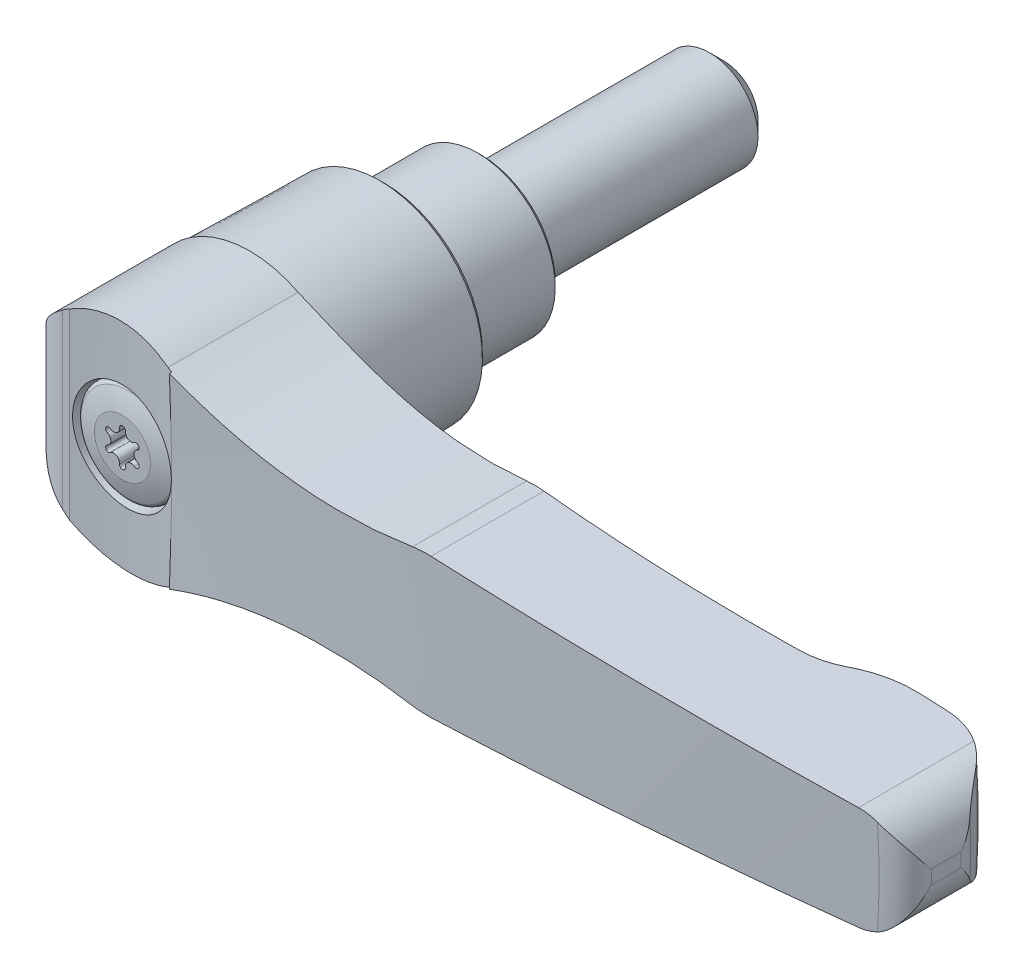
ISO-10303-21;
HEADER;
FILE_DESCRIPTION(('STEP AP214'),'2;1');
FILE_NAME('part.step','',(''),(''),'','','');
FILE_SCHEMA(('AUTOMOTIVE_DESIGN { 1 0 10303 214 1 1 1 1 }'));
ENDSEC;
DATA;
#1=APPLICATION_CONTEXT('core data for automotive mechanical design processes');
#2=APPLICATION_PROTOCOL_DEFINITION('international standard','automotive_design',2000,#1);
#3=PRODUCT_CONTEXT('',#1,'mechanical');
#4=PRODUCT('Part','Part','',(#3));
#5=PRODUCT_RELATED_PRODUCT_CATEGORY('part','',(#4));
#6=PRODUCT_DEFINITION_FORMATION('','',#4);
#7=PRODUCT_DEFINITION_CONTEXT('part definition',#1,'design');
#8=PRODUCT_DEFINITION('design','',#6,#7);
#9=PRODUCT_DEFINITION_SHAPE('','',#8);
#10=(LENGTH_UNIT() NAMED_UNIT(*) SI_UNIT(.MILLI.,.METRE.));
#11=(NAMED_UNIT(*) PLANE_ANGLE_UNIT() SI_UNIT($,.RADIAN.));
#12=(NAMED_UNIT(*) SI_UNIT($,.STERADIAN.) SOLID_ANGLE_UNIT());
#13=UNCERTAINTY_MEASURE_WITH_UNIT(LENGTH_MEASURE(1.E-05),#10,'distance_accuracy_value','');
#14=(GEOMETRIC_REPRESENTATION_CONTEXT(3) GLOBAL_UNCERTAINTY_ASSIGNED_CONTEXT((#13)) GLOBAL_UNIT_ASSIGNED_CONTEXT((#10,
#11,#12)) REPRESENTATION_CONTEXT('',''));
#15=CARTESIAN_POINT('',(0.,0.,0.));
#16=DIRECTION('',(0.,0.,1.));
#17=DIRECTION('',(1.,0.,0.));
#18=AXIS2_PLACEMENT_3D('',#15,#16,#17);
#19=CARTESIAN_POINT('',(0.,0.,27.75));
#20=DIRECTION('',(0.,0.,1.));
#21=DIRECTION('',(0.,-1.,0.));
#22=AXIS2_PLACEMENT_3D('',#19,#20,#21);
#23=CONICAL_SURFACE('',#22,5.15,0.0261799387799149);
#24=CARTESIAN_POINT('',(-3.82186723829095,3.79301788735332,36.7080789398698));
#25=CARTESIAN_POINT('',(-3.71534691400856,3.90028108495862,36.7062117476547));
#26=CARTESIAN_POINT('',(-3.60432455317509,4.00304517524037,36.704589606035));
#27=CARTESIAN_POINT('',(-3.37399930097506,4.19891926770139,36.7020096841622));
#28=CARTESIAN_POINT('',(-3.25469446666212,4.29202699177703,36.7010520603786));
#29=CARTESIAN_POINT('',(-3.0085890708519,4.4679591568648,36.6999680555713));
#30=CARTESIAN_POINT('',(-2.88178275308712,4.55077554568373,36.6998423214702));
#31=CARTESIAN_POINT('',(-2.62161264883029,4.7054859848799,36.7005758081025));
#32=CARTESIAN_POINT('',(-2.48824649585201,4.77737605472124,36.7014353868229));
#33=CARTESIAN_POINT('',(-2.21605276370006,4.90964048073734,36.7042708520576));
#34=CARTESIAN_POINT('',(-2.07722922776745,4.97002317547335,36.7062459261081));
#35=CARTESIAN_POINT('',(-1.79497035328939,5.07893378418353,36.7114191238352));
#36=CARTESIAN_POINT('',(-1.65153333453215,5.12745732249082,36.7146176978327));
#37=CARTESIAN_POINT('',(-1.36121177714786,5.21225729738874,36.7223126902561));
#38=CARTESIAN_POINT('',(-1.21432937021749,5.24854110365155,36.7268083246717));
#39=CARTESIAN_POINT('',(-0.918029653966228,5.30866584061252,36.7371445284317));
#40=CARTESIAN_POINT('',(-0.768611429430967,5.33250217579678,36.7429855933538));
#41=CARTESIAN_POINT('',(-0.468546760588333,5.36753437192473,36.7560131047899));
#42=CARTESIAN_POINT('',(-0.317902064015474,5.37874583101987,36.7631978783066));
#43=CARTESIAN_POINT('',(-0.0162164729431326,5.3885202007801,36.7788936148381));
#44=CARTESIAN_POINT('',(0.134824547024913,5.3870784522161,36.7874050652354));
#45=CARTESIAN_POINT('',(0.436130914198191,5.37156631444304,36.8056859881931));
#46=CARTESIAN_POINT('',(0.58639649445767,5.35749997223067,36.815455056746));
#47=CARTESIAN_POINT('',(0.885200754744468,5.31685490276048,36.8361582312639));
#48=CARTESIAN_POINT('',(1.03373877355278,5.29027153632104,36.8470927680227));
#49=CARTESIAN_POINT('',(1.32842726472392,5.22469830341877,36.8700247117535));
#50=CARTESIAN_POINT('',(1.47456945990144,5.18567228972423,36.882025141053));
#51=CARTESIAN_POINT('',(1.76304982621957,5.09551309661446,36.9068998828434));
#52=CARTESIAN_POINT('',(1.90538657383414,5.04437545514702,36.9197745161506));
#53=CARTESIAN_POINT('',(2.18517812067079,4.93037916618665,36.9461969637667));
#54=CARTESIAN_POINT('',(2.32263450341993,4.86752436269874,36.9597445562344));
#55=CARTESIAN_POINT('',(2.59177729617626,4.73053715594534,36.987298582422));
#56=CARTESIAN_POINT('',(2.72346154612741,4.65640057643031,37.0013051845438));
#57=CARTESIAN_POINT('',(3.11008075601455,4.41677811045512,37.0438406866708));
#58=CARTESIAN_POINT('',(3.35498940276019,4.23472918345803,37.0727317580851));
#59=CARTESIAN_POINT('',(3.81061841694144,3.83201391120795,37.1293132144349));
#60=CARTESIAN_POINT('',(4.02133817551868,3.61134687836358,37.1570035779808));
#61=CARTESIAN_POINT('',(4.40299814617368,3.13710131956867,37.2090851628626));
#62=CARTESIAN_POINT('',(4.57389146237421,2.88348453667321,37.2334724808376));
#63=CARTESIAN_POINT('',(4.8704857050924,2.35066468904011,37.2769076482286));
#64=CARTESIAN_POINT('',(4.99618921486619,2.07146308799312,37.2959558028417));
#65=CARTESIAN_POINT('',(5.19764854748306,1.49811632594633,37.3269450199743));
#66=CARTESIAN_POINT('',(5.27385550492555,1.20413322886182,37.3389501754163));
#67=CARTESIAN_POINT('',(5.37579370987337,0.607338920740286,37.3550873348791));
#68=CARTESIAN_POINT('',(5.40152887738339,0.304528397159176,37.3592199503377));
#69=CARTESIAN_POINT('',(5.40172286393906,-0.29769106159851,37.3592512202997));
#70=CARTESIAN_POINT('',(5.37675477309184,-0.597099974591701,37.35524190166));
#71=CARTESIAN_POINT('',(5.27746605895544,-1.18740212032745,37.3395194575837));
#72=CARTESIAN_POINT('',(5.20314585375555,-1.47829542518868,37.3278063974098));
#73=CARTESIAN_POINT('',(5.00745942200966,-2.04324075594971,37.2976749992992));
#74=CARTESIAN_POINT('',(4.88611822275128,-2.31730165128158,37.2792602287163));
#75=CARTESIAN_POINT('',(4.59994520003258,-2.84124816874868,37.2372335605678));
#76=CARTESIAN_POINT('',(4.43511078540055,-3.09113234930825,37.2136213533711));
#77=CARTESIAN_POINT('',(4.06463235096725,-3.56252869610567,37.1627855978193));
#78=CARTESIAN_POINT('',(3.85857005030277,-3.78370822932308,37.1355260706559));
#79=CARTESIAN_POINT('',(3.41254071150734,-4.18853503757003,37.0796758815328));
#80=CARTESIAN_POINT('',(3.17257159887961,-4.37218001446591,37.0510851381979));
#81=CARTESIAN_POINT('',(2.66278140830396,-4.69856745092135,36.994342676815));
#82=CARTESIAN_POINT('',(2.39268640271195,-4.84088357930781,36.9661981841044));
#83=CARTESIAN_POINT('',(1.83217160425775,-5.07809992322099,36.9125421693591));
#84=CARTESIAN_POINT('',(1.54175179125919,-5.17300009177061,36.8870306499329));
#85=CARTESIAN_POINT('',(0.948774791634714,-5.31257948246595,36.8401550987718));
#86=CARTESIAN_POINT('',(0.646218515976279,-5.35726246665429,36.8187907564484));
#87=CARTESIAN_POINT('',(0.0375867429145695,-5.39498080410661,36.7812079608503));
#88=CARTESIAN_POINT('',(-0.268488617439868,-5.38801816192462,36.7649893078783));
#89=CARTESIAN_POINT('',(-0.873320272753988,-5.32272310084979,36.7381921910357));
#90=CARTESIAN_POINT('',(-1.17211141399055,-5.26472804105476,36.7275774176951));
#91=CARTESIAN_POINT('',(-1.75586295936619,-5.09937269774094,36.7116339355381));
#92=CARTESIAN_POINT('',(-2.04082365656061,-4.99201346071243,36.7063051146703));
#93=CARTESIAN_POINT('',(-2.58762584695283,-4.73149608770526,36.7002185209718));
#94=CARTESIAN_POINT('',(-2.84955219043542,-4.57851601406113,36.6994432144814));
#95=CARTESIAN_POINT('',(-3.34420500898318,-4.23075694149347,36.7012936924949));
#96=CARTESIAN_POINT('',(-3.57693118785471,-4.03597751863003,36.7039195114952));
#97=CARTESIAN_POINT('',(-3.89903010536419,-3.71679841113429,36.709377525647));
#98=CARTESIAN_POINT('',(-4.00199323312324,-3.60577103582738,36.7114531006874));
#99=CARTESIAN_POINT('',(-4.19820603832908,-3.37546663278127,36.7159314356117));
#100=CARTESIAN_POINT('',(-4.29145927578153,-3.25619265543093,36.7183340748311));
#101=CARTESIAN_POINT('',(-4.46762204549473,-3.01018379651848,36.7232909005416));
#102=CARTESIAN_POINT('',(-4.55052767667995,-2.88344612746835,36.7258451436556));
#103=CARTESIAN_POINT('',(-4.70534739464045,-2.62348619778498,36.7309338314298));
#104=CARTESIAN_POINT('',(-4.77726552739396,-2.49026634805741,36.7334682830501));
#105=CARTESIAN_POINT('',(-4.90972659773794,-2.2180457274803,36.7383656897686));
#106=CARTESIAN_POINT('',(-4.97025295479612,-2.07903688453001,36.7407283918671));
#107=CARTESIAN_POINT('',(-5.07934789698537,-1.79645762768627,36.7451389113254));
#108=CARTESIAN_POINT('',(-5.12792090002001,-1.65288892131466,36.7471868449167));
#109=CARTESIAN_POINT('',(-5.21280239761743,-1.36211419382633,36.750853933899));
#110=CARTESIAN_POINT('',(-5.24910688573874,-1.21490700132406,36.7524729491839));
#111=CARTESIAN_POINT('',(-5.30915612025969,-0.918004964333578,36.7551917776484));
#112=CARTESIAN_POINT('',(-5.33290553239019,-0.768311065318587,36.7562917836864));
#113=CARTESIAN_POINT('',(-5.36767150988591,-0.467638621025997,36.7579130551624));
#114=CARTESIAN_POINT('',(-5.37870396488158,-0.316661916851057,36.7584350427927));
#115=CARTESIAN_POINT('',(-5.38800813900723,-0.0143709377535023,36.7588747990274));
#116=CARTESIAN_POINT('',(-5.38628458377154,0.136943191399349,36.7587927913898));
#117=CARTESIAN_POINT('',(-5.37009558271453,0.438975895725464,36.758029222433));
#118=CARTESIAN_POINT('',(-5.35562265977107,0.589694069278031,36.7573473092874));
#119=CARTESIAN_POINT('',(-5.31403708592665,0.889315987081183,36.7554202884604));
#120=CARTESIAN_POINT('',(-5.28692909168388,1.03822037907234,36.7541753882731));
#121=CARTESIAN_POINT('',(-5.22027737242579,1.33318140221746,36.7511900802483));
#122=CARTESIAN_POINT('',(-5.18073627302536,1.47923862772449,36.749449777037));
#123=CARTESIAN_POINT('',(-5.08951807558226,1.7674479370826,36.7455701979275));
#124=CARTESIAN_POINT('',(-5.03784539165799,1.90960142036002,36.7434310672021));
#125=CARTESIAN_POINT('',(-4.92276837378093,2.18894714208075,36.738876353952));
#126=CARTESIAN_POINT('',(-4.85937318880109,2.32614315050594,36.7364609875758));
#127=CARTESIAN_POINT('',(-4.72130226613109,2.59467891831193,36.7314958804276));
#128=CARTESIAN_POINT('',(-4.64662917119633,2.72602004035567,36.728946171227));
#129=CARTESIAN_POINT('',(-4.46041720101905,3.02367013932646,36.7230432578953));
#130=CARTESIAN_POINT('',(-4.34479079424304,3.18744274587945,36.7196987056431));
#131=CARTESIAN_POINT('',(-4.0960291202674,3.50111159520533,36.7134525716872));
#132=CARTESIAN_POINT('',(-3.96289380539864,3.65100780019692,36.7105509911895));
#133=CARTESIAN_POINT('',(-3.82186723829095,3.79301788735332,36.7080789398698));
#134=B_SPLINE_CURVE_WITH_KNOTS('',3,(#24,#25,#26,#27,#28,#29,#30,#31,#32,#33,#34,#35,#36,#37,
#38,#39,#40,#41,#42,#43,#44,#45,#46,#47,#48,#49,#50,#51,#52,#53,#54,#55,#56,#57,#58,#59,#60,#61,
#62,#63,#64,#65,#66,#67,#68,#69,#70,#71,#72,#73,#74,#75,#76,#77,#78,#79,#80,#81,#82,#83,#84,#85,
#86,#87,#88,#89,#90,#91,#92,#93,#94,#95,#96,#97,#98,#99,#100,#101,#102,#103,#104,#105,#106,#107,
#108,#109,#110,#111,#112,#113,#114,#115,#116,#117,#118,#119,#120,#121,#122,#123,#124,#125,#126,
#127,#128,#129,#130,#131,#132,#133),.UNSPECIFIED.,.T.,.F.,(4,2,2,2,2,2,2,2,2,2,2,2,2,2,2,2,2,2,
2,2,2,2,2,2,2,2,2,2,2,2,2,2,2,2,2,2,2,2,2,2,2,2,2,2,2,2,2,2,2,2,2,2,2,2,4),(0.,
0.453366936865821,0.906840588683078,1.36066684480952,1.81465803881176,2.26831899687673,
2.72214709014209,3.17570143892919,3.62942311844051,4.0825836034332,4.53591096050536,
4.98909304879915,5.44244323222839,5.89712263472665,6.35196980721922,6.8066680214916,
7.26153496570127,8.17638541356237,9.09125215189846,10.007190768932,10.9230770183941,
11.8304937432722,12.7378399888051,13.634987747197,14.5321279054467,15.4287912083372,
16.3255079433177,17.2318313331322,18.1382101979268,19.0536313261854,19.9690533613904,
20.8844068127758,21.7997247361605,22.7090368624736,23.6183297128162,24.5241189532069,
25.4299173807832,25.8837842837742,26.3374841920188,26.7913546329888,27.2450575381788,
27.6994157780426,28.1536058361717,28.6079440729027,29.0621133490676,29.5157145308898,
29.969147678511,30.4228469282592,30.8763790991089,31.3298155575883,31.7830872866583,
32.2360067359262,32.6888202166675,33.2890494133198,33.8892802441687),.UNSPECIFIED.);
#135=CARTESIAN_POINT('',(-3.82186723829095,3.79301788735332,36.7080789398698));
#136=VERTEX_POINT('',#135);
#137=EDGE_CURVE('E521',#136,#136,#134,.T.);
#138=ORIENTED_EDGE('',*,*,#137,.F.);
#139=EDGE_LOOP('',(#138));
#140=FACE_BOUND('',#139,.T.);
#141=CARTESIAN_POINT('',(0.,0.,33.));
#142=DIRECTION('',(0.,0.,-1.));
#143=DIRECTION('',(-1.,0.,0.));
#144=AXIS2_PLACEMENT_3D('',#141,#142,#143);
#145=CIRCLE('',#144,5.28747608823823);
#146=CARTESIAN_POINT('',(-5.28747608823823,0.,33.));
#147=VERTEX_POINT('',#146);
#148=EDGE_CURVE('E299',#147,#147,#145,.T.);
#149=ORIENTED_EDGE('',*,*,#148,.T.);
#150=EDGE_LOOP('',(#149));
#151=FACE_BOUND('',#150,.T.);
#152=ADVANCED_FACE('F14',(#140,#151),#23,.F.);
#153=CARTESIAN_POINT('',(0.,0.,-20.));
#154=DIRECTION('',(0.,0.,-1.));
#155=DIRECTION('',(0.,1.,0.));
#156=AXIS2_PLACEMENT_3D('',#153,#154,#155);
#157=CYLINDRICAL_SURFACE('',#156,5.);
#158=CARTESIAN_POINT('',(0.,0.,-23.5));
#159=DIRECTION('',(0.,0.,-1.));
#160=DIRECTION('',(0.,1.,0.));
#161=AXIS2_PLACEMENT_3D('',#158,#159,#160);
#162=CIRCLE('',#161,5.);
#163=CARTESIAN_POINT('',(0.,5.,-23.5));
#164=VERTEX_POINT('',#163);
#165=EDGE_CURVE('E9',#164,#164,#162,.F.);
#166=ORIENTED_EDGE('',*,*,#165,.T.);
#167=EDGE_LOOP('',(#166));
#168=FACE_BOUND('',#167,.T.);
#169=CARTESIAN_POINT('',(0.,0.,0.));
#170=DIRECTION('',(0.,0.,-1.));
#171=DIRECTION('',(0.,1.,0.));
#172=AXIS2_PLACEMENT_3D('',#169,#170,#171);
#173=CIRCLE('',#172,5.);
#174=CARTESIAN_POINT('',(0.,5.,0.));
#175=VERTEX_POINT('',#174);
#176=EDGE_CURVE('E362',#175,#175,#173,.T.);
#177=ORIENTED_EDGE('',*,*,#176,.T.);
#178=EDGE_LOOP('',(#177));
#179=FACE_BOUND('',#178,.T.);
#180=ADVANCED_FACE('F512',(#168,#179),#157,.T.);
#181=CARTESIAN_POINT('',(7.6,0.,0.));
#182=DIRECTION('',(0.,0.,1.));
#183=DIRECTION('',(0.,-1.,0.));
#184=AXIS2_PLACEMENT_3D('',#181,#182,#183);
#185=PLANE('',#184);
#186=ORIENTED_EDGE('',*,*,#176,.F.);
#187=EDGE_LOOP('',(#186));
#188=FACE_BOUND('',#187,.T.);
#189=CARTESIAN_POINT('',(0.,0.,0.));
#190=DIRECTION('',(0.,0.,-1.));
#191=DIRECTION('',(0.,1.,0.));
#192=AXIS2_PLACEMENT_3D('',#189,#190,#191);
#193=CIRCLE('',#192,7.6);
#194=CARTESIAN_POINT('',(0.,7.6,0.));
#195=VERTEX_POINT('',#194);
#196=EDGE_CURVE('E985',#195,#195,#193,.T.);
#197=ORIENTED_EDGE('',*,*,#196,.T.);
#198=EDGE_LOOP('',(#197));
#199=FACE_BOUND('',#198,.T.);
#200=ADVANCED_FACE('F403',(#188,#199),#185,.F.);
#201=CARTESIAN_POINT('',(-2.9000000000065,-22.,89.3000000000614));
#202=DIRECTION('',(0.,1.,0.));
#203=DIRECTION('',(-1.,0.,0.));
#204=AXIS2_PLACEMENT_3D('',#201,#202,#203);
#205=CYLINDRICAL_SURFACE('',#204,52.6000000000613);
#206=CARTESIAN_POINT('',(4.99999999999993,9.79795897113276,37.29663472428));
#207=CARTESIAN_POINT('',(4.72836499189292,9.9366097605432,37.2553500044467));
#208=CARTESIAN_POINT('',(4.45077156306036,10.0639978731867,37.2153761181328));
#209=CARTESIAN_POINT('',(3.88554818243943,10.2954169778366,37.1387392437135));
#210=CARTESIAN_POINT('',(3.59791744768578,10.3994461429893,37.1020765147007));
#211=CARTESIAN_POINT('',(3.01491777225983,10.5831754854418,37.0328024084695));
#212=CARTESIAN_POINT('',(2.71955925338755,10.6629067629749,37.0001858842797));
#213=CARTESIAN_POINT('',(2.12279313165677,10.79755975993,36.9395048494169));
#214=CARTESIAN_POINT('',(1.82138582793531,10.8524827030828,36.9114401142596));
#215=CARTESIAN_POINT('',(1.21421772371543,10.9370815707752,36.8602616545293));
#216=CARTESIAN_POINT('',(0.90845167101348,10.966723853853,36.8371545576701));
#217=CARTESIAN_POINT('',(0.295018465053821,11.0003346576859,36.7962250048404));
#218=CARTESIAN_POINT('',(-0.0126494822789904,11.0042916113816,36.7784049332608));
#219=CARTESIAN_POINT('',(-0.627464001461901,10.9863940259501,36.7482132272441));
#220=CARTESIAN_POINT('',(-0.934610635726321,10.9645428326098,36.7358408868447));
#221=CARTESIAN_POINT('',(-1.54601934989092,10.8951569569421,36.7165401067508));
#222=CARTESIAN_POINT('',(-1.85028266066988,10.8476337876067,36.709609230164));
#223=CARTESIAN_POINT('',(-2.46439079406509,10.7251200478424,36.7008764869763));
#224=CARTESIAN_POINT('',(-2.77405858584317,10.64922685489,36.6992625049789));
#225=CARTESIAN_POINT('',(-3.38564496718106,10.4708596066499,36.7013524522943));
#226=CARTESIAN_POINT('',(-3.68756293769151,10.3683834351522,36.705056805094));
#227=CARTESIAN_POINT('',(-4.28200890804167,10.1373700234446,36.7173174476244));
#228=CARTESIAN_POINT('',(-4.5745119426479,10.0087692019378,36.7258856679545));
#229=CARTESIAN_POINT('',(-5.14711147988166,9.72673276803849,36.7472344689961));
#230=CARTESIAN_POINT('',(-5.42720860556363,9.57329840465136,36.7600148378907));
#231=CARTESIAN_POINT('',(-5.70000000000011,9.40797534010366,36.774577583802));
#232=B_SPLINE_CURVE_WITH_KNOTS('',3,(#206,#207,#208,#209,#210,#211,#212,#213,#214,#215,#216,
#217,#218,#219,#220,#221,#222,#223,#224,#225,#226,#227,#228,#229,#230,#231),.UNSPECIFIED.,.F.,
.F.,(4,2,2,2,2,2,2,2,2,2,2,2,4),(0.,0.923020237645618,1.84611263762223,2.76801850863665,
3.68987889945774,4.61296412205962,5.53646501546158,6.4598461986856,7.38281362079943,
8.33806499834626,9.29339244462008,10.2510734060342,11.2087062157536),.UNSPECIFIED.);
#233=CARTESIAN_POINT('',(4.99999999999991,9.7979589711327,37.29663472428));
#234=VERTEX_POINT('',#233);
#235=CARTESIAN_POINT('',(-5.7000000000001,9.40797534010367,36.774577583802));
#236=VERTEX_POINT('',#235);
#237=EDGE_CURVE('E435',#234,#236,#232,.T.);
#238=ORIENTED_EDGE('',*,*,#237,.T.);
#239=DIRECTION('',(0.,1.,0.));
#240=VECTOR('',#239,1.);
#241=CARTESIAN_POINT('',(-5.7000000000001,-22.,36.774577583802));
#242=LINE('',#241,#240);
#243=CARTESIAN_POINT('',(-5.7000000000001,-9.4079753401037,36.774577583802));
#244=VERTEX_POINT('',#243);
#245=EDGE_CURVE('E368',#244,#236,#242,.T.);
#246=ORIENTED_EDGE('',*,*,#245,.F.);
#247=CARTESIAN_POINT('',(-5.70000000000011,-9.40797534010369,36.774577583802));
#248=CARTESIAN_POINT('',(-5.43970332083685,-9.56571993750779,36.7606846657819));
#249=CARTESIAN_POINT('',(-5.17275915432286,-9.71264560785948,36.7484111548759));
#250=CARTESIAN_POINT('',(-4.62749279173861,-9.9839292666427,36.727671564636));
#251=CARTESIAN_POINT('',(-4.34917039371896,-10.1082868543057,36.7192055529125));
#252=CARTESIAN_POINT('',(-3.7836735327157,-10.3332602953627,36.706663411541));
#253=CARTESIAN_POINT('',(-3.49651907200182,-10.4339258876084,36.7025780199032));
#254=CARTESIAN_POINT('',(-2.91484226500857,-10.6111316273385,36.699198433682));
#255=CARTESIAN_POINT('',(-2.62032018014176,-10.6876726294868,36.6999040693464));
#256=CARTESIAN_POINT('',(-2.02570589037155,-10.8161512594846,36.7064252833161));
#257=CARTESIAN_POINT('',(-1.7256084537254,-10.8680644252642,36.7122459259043));
#258=CARTESIAN_POINT('',(-1.12215614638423,-10.9468441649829,36.7291866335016));
#259=CARTESIAN_POINT('',(-0.818799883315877,-10.9736995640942,36.7403090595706));
#260=CARTESIAN_POINT('',(-0.211043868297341,-11.0021831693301,36.7678948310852));
#261=CARTESIAN_POINT('',(0.0933562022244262,-11.0038028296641,36.7843599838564));
#262=CARTESIAN_POINT('',(0.700782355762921,-10.981859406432,36.8225100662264));
#263=CARTESIAN_POINT('',(1.00380896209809,-10.9583068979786,36.844192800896));
#264=CARTESIAN_POINT('',(1.62703646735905,-10.883833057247,36.8941780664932));
#265=CARTESIAN_POINT('',(1.94700070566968,-10.8311562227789,36.9228309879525));
#266=CARTESIAN_POINT('',(2.58058446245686,-10.6979165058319,36.9853308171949));
#267=CARTESIAN_POINT('',(2.89420315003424,-10.6173499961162,37.0191784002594));
#268=CARTESIAN_POINT('',(3.51321915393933,-10.4289071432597,37.0914975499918));
#269=CARTESIAN_POINT('',(3.81860000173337,-10.3209800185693,37.1299776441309));
#270=CARTESIAN_POINT('',(4.41821395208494,-10.078894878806,37.2106925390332));
#271=CARTESIAN_POINT('',(4.71244874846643,-9.94474086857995,37.2529267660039));
#272=CARTESIAN_POINT('',(5.0000000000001,-9.7979589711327,37.29663472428));
#273=B_SPLINE_CURVE_WITH_KNOTS('',3,(#247,#248,#249,#250,#251,#252,#253,#254,#255,#256,#257,
#258,#259,#260,#261,#262,#263,#264,#265,#266,#267,#268,#269,#270,#271,#272),.UNSPECIFIED.,.F.,
.F.,(4,2,2,2,2,2,2,2,2,2,2,2,4),(0.,0.913785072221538,1.82758637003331,2.73945177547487,
3.65128487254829,4.56402177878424,5.47716553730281,6.39061851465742,7.30368789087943,
8.27897178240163,9.25438256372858,10.2316171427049,11.2087026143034),.UNSPECIFIED.);
#274=CARTESIAN_POINT('',(5.00000000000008,-9.79795897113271,37.29663472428));
#275=VERTEX_POINT('',#274);
#276=EDGE_CURVE('E421',#244,#275,#273,.T.);
#277=ORIENTED_EDGE('',*,*,#276,.T.);
#278=CARTESIAN_POINT('',(5.43597073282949,-9.62987816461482,37.36473652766));
#279=CARTESIAN_POINT('',(5.36321973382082,-9.65752809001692,37.3530600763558));
#280=CARTESIAN_POINT('',(5.29051333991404,-9.68535978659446,37.341546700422));
#281=CARTESIAN_POINT('',(5.14518976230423,-9.74138672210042,37.3188460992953));
#282=CARTESIAN_POINT('',(5.07257257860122,-9.76958196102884,37.3076588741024));
#283=CARTESIAN_POINT('',(5.00000000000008,-9.79795897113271,37.29663472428));
#284=B_SPLINE_CURVE_WITH_KNOTS('',3,(#278,#279,#280,#281,#282,#283),.UNSPECIFIED.,.F.,.F.,(4,2,
4),(0.,0.236094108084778,0.472188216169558),.UNSPECIFIED.);
#285=CARTESIAN_POINT('',(5.4359707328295,-9.62987816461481,37.36473652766));
#286=VERTEX_POINT('',#285);
#287=EDGE_CURVE('E410',#286,#275,#284,.T.);
#288=ORIENTED_EDGE('',*,*,#287,.F.);
#289=DIRECTION('',(0.,1.,0.));
#290=VECTOR('',#289,1.);
#291=CARTESIAN_POINT('',(5.43597073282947,-22.,37.36473652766));
#292=LINE('',#291,#290);
#293=CARTESIAN_POINT('',(5.43597073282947,0.,37.36473652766));
#294=VERTEX_POINT('',#293);
#295=EDGE_CURVE('E37',#286,#294,#292,.T.);
#296=ORIENTED_EDGE('',*,*,#295,.T.);
#297=CARTESIAN_POINT('',(5.43597073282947,9.62987816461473,37.36473652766));
#298=VERTEX_POINT('',#297);
#299=EDGE_CURVE('E365',#294,#298,#292,.T.);
#300=ORIENTED_EDGE('',*,*,#299,.T.);
#301=CARTESIAN_POINT('',(4.99999999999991,9.7979589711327,37.29663472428));
#302=CARTESIAN_POINT('',(5.07257257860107,9.76958196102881,37.3076588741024));
#303=CARTESIAN_POINT('',(5.14518976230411,9.74138672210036,37.3188460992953));
#304=CARTESIAN_POINT('',(5.29051333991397,9.68535978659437,37.341546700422));
#305=CARTESIAN_POINT('',(5.36321973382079,9.65752809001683,37.3530600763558));
#306=CARTESIAN_POINT('',(5.43597073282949,9.62987816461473,37.36473652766));
#307=B_SPLINE_CURVE_WITH_KNOTS('',3,(#301,#302,#303,#304,#305,#306),.UNSPECIFIED.,.F.,.F.,(4,2,
4),(0.,0.236094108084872,0.472188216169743),.UNSPECIFIED.);
#308=EDGE_CURVE('E428',#234,#298,#307,.T.);
#309=ORIENTED_EDGE('',*,*,#308,.F.);
#310=EDGE_LOOP('',(#238,#246,#277,#288,#296,#300,#309));
#311=FACE_BOUND('',#310,.T.);
#312=ORIENTED_EDGE('',*,*,#137,.T.);
#313=EDGE_LOOP('',(#312));
#314=FACE_BOUND('',#313,.T.);
#315=ADVANCED_FACE('F399',(#311,#314),#205,.F.);
#316=CARTESIAN_POINT('',(0.,0.,-577.800000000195));
#317=DIRECTION('',(0.,0.,-1.));
#318=DIRECTION('',(0.,1.,0.));
#319=AXIS2_PLACEMENT_3D('',#316,#317,#318);
#320=DEGENERATE_TOROIDAL_SURFACE('',#319,33.3999999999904,615.800000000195,.T.);
#321=CARTESIAN_POINT('',(30.9002,7.10003333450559,37.9976683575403));
#322=CARTESIAN_POINT('',(30.2294569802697,6.98822969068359,37.9958049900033));
#323=CARTESIAN_POINT('',(29.5563953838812,6.8904055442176,37.9928133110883));
#324=CARTESIAN_POINT('',(28.2067936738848,6.7228472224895,37.9846275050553));
#325=CARTESIAN_POINT('',(27.5302535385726,6.6531132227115,37.9794333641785));
#326=CARTESIAN_POINT('',(26.1747400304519,6.54185757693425,37.9668957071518));
#327=CARTESIAN_POINT('',(25.4957662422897,6.5003410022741,37.9595518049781));
#328=CARTESIAN_POINT('',(24.1367720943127,6.44559969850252,37.9428222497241));
#329=CARTESIAN_POINT('',(23.4567517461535,6.43237465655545,37.9334366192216));
#330=CARTESIAN_POINT('',(21.4461065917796,6.43516844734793,37.9028483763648));
#331=CARTESIAN_POINT('',(20.1152587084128,6.49125306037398,37.878929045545));
#332=CARTESIAN_POINT('',(18.1264981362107,6.65637631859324,37.8390449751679));
#333=CARTESIAN_POINT('',(17.464852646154,6.72491301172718,37.8250833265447));
#334=CARTESIAN_POINT('',(16.1449136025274,6.88885393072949,37.7962639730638));
#335=CARTESIAN_POINT('',(15.4866198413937,6.98425647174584,37.7814063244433));
#336=CARTESIAN_POINT('',(13.9966493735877,7.23126043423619,37.7473031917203));
#337=CARTESIAN_POINT('',(13.1663283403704,7.39108521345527,37.727959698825));
#338=CARTESIAN_POINT('',(11.5152169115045,7.75343699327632,37.690522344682));
#339=CARTESIAN_POINT('',(10.694424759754,7.9559559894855,37.6724282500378));
#340=CARTESIAN_POINT('',(9.05285416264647,8.40635359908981,37.6397736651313));
#341=CARTESIAN_POINT('',(8.23223752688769,8.6548288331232,37.6252663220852));
#342=CARTESIAN_POINT('',(7.01185980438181,9.05958984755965,37.608666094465));
#343=CARTESIAN_POINT('',(6.60676296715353,9.19987583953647,37.603992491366));
#344=CARTESIAN_POINT('',(5.80036915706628,9.49103692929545,37.5966508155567));
#345=CARTESIAN_POINT('',(5.39907222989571,9.64191215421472,37.5939827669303));
#346=CARTESIAN_POINT('',(4.9997999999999,9.79803717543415,37.5924593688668));
#347=B_SPLINE_CURVE_WITH_KNOTS('',3,(#321,#322,#323,#324,#325,#326,#327,#328,#329,#330,#331,
#332,#333,#334,#335,#336,#337,#338,#339,#340,#341,#342,#343,#344,#345,#346),.UNSPECIFIED.,.F.,
.F.,(4,2,2,2,2,2,2,2,2,2,2,2,4),(0.,2.03983506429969,4.07968287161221,6.11989719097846,
8.16008895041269,12.1515193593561,14.1470960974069,16.1425477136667,18.6787308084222,
21.2144388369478,23.7857285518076,25.0717731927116,26.3578332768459),.UNSPECIFIED.);
#348=CARTESIAN_POINT('',(30.9,7.1,37.997667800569));
#349=VERTEX_POINT('',#348);
#350=CARTESIAN_POINT('',(5.4359707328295,9.62987816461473,37.5945767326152));
#351=VERTEX_POINT('',#350);
#352=EDGE_CURVE('E1012',#349,#351,#347,.T.);
#353=ORIENTED_EDGE('',*,*,#352,.T.);
#354=CARTESIAN_POINT('',(5.4359707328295,0.139704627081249,37.364818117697));
#355=CARTESIAN_POINT('',(5.4359707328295,0.0263223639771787,37.3646847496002));
#356=CARTESIAN_POINT('',(5.4359707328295,-0.087059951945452,37.3647143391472));
#357=CARTESIAN_POINT('',(5.4359707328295,-0.31382488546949,37.3650945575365));
#358=CARTESIAN_POINT('',(5.4359707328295,-0.427207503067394,37.3654451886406));
#359=CARTESIAN_POINT('',(5.4359707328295,-0.767350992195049,37.3669741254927));
#360=CARTESIAN_POINT('',(5.4359707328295,-0.994109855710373,37.3686294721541));
#361=CARTESIAN_POINT('',(5.4359707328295,-1.44760096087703,37.3731244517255));
#362=CARTESIAN_POINT('',(5.4359707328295,-1.67433320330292,37.3759640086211));
#363=CARTESIAN_POINT('',(5.4359707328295,-2.12778335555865,37.3826896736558));
#364=CARTESIAN_POINT('',(5.4359707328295,-2.35450126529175,37.3865757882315));
#365=CARTESIAN_POINT('',(5.4359707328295,-2.80788425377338,37.3952314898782));
#366=CARTESIAN_POINT('',(5.4359707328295,-3.03454933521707,37.4000009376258));
#367=CARTESIAN_POINT('',(5.4359707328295,-3.48786247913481,37.4102594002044));
#368=CARTESIAN_POINT('',(5.4359707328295,-3.71451054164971,37.4157484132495));
#369=CARTESIAN_POINT('',(5.4359707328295,-4.3944531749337,37.4330569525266));
#370=CARTESIAN_POINT('',(5.4359707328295,-4.84772616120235,37.445717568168));
#371=CARTESIAN_POINT('',(5.4359707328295,-5.75417804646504,37.4722642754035));
#372=CARTESIAN_POINT('',(5.4359707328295,-6.20735695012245,37.4861502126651));
#373=CARTESIAN_POINT('',(5.4359707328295,-7.11369823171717,37.5144555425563));
#374=CARTESIAN_POINT('',(5.4359707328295,-7.56686060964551,37.528874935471));
#375=CARTESIAN_POINT('',(5.4359707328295,-8.47318366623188,37.5577843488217));
#376=CARTESIAN_POINT('',(5.4359707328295,-8.92634434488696,37.5722743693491));
#377=CARTESIAN_POINT('',(5.4359707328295,-9.83267306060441,37.6010218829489));
#378=CARTESIAN_POINT('',(5.4359707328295,-10.2858410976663,37.615279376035));
#379=CARTESIAN_POINT('',(5.4359707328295,-11.6453393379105,37.657378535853));
#380=CARTESIAN_POINT('',(5.4359707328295,-12.5516906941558,37.6845477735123));
#381=CARTESIAN_POINT('',(5.4359707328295,-14.3644725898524,37.7361289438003));
#382=CARTESIAN_POINT('',(5.4359707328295,-15.2709031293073,37.7605408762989));
#383=CARTESIAN_POINT('',(5.4359707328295,-17.0838968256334,37.8061411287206));
#384=CARTESIAN_POINT('',(5.4359707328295,-17.9904599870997,37.8273292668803));
#385=CARTESIAN_POINT('',(5.4359707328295,-19.8036600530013,37.8662106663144));
#386=CARTESIAN_POINT('',(5.4359707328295,-20.7102969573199,37.8839039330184));
#387=CARTESIAN_POINT('',(5.4359707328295,-22.5236728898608,37.9156376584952));
#388=CARTESIAN_POINT('',(5.4359707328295,-23.4304119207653,37.929677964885));
#389=CARTESIAN_POINT('',(5.4359707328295,-25.2439454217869,37.9540054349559));
#390=CARTESIAN_POINT('',(5.4359707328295,-26.1507398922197,37.9642925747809));
#391=CARTESIAN_POINT('',(5.4359707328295,-28.8758498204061,37.9894632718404));
#392=CARTESIAN_POINT('',(5.4359707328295,-30.6942231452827,37.9985735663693));
#393=CARTESIAN_POINT('',(5.4359707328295,-34.3309833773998,38.001117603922));
#394=CARTESIAN_POINT('',(5.4359707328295,-36.1493702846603,37.9945512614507));
#395=CARTESIAN_POINT('',(5.4359707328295,-41.6044064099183,37.9510940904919));
#396=CARTESIAN_POINT('',(5.4359707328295,-45.2408980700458,37.8904448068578));
#397=CARTESIAN_POINT('',(5.4359707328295,-52.5123746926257,37.7052257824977));
#398=CARTESIAN_POINT('',(5.4359707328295,-56.147359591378,37.5806535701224));
#399=CARTESIAN_POINT('',(5.4359707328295,-63.4145638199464,37.2674123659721));
#400=CARTESIAN_POINT('',(5.4359707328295,-67.046783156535,37.0787435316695));
#401=CARTESIAN_POINT('',(5.4359707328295,-74.3112406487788,36.6370156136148));
#402=CARTESIAN_POINT('',(5.4359707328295,-77.943474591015,36.3838872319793));
#403=CARTESIAN_POINT('',(5.4359707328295,-85.2028595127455,35.813362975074));
#404=CARTESIAN_POINT('',(5.4359707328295,-88.8300105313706,35.4959675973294));
#405=CARTESIAN_POINT('',(5.4359707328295,-96.0785329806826,34.7969300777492));
#406=CARTESIAN_POINT('',(5.4359707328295,-99.6999037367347,34.4152809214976));
#407=CARTESIAN_POINT('',(5.4359707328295,-106.935372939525,33.5878576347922));
#408=CARTESIAN_POINT('',(5.4359707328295,-110.54947113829,33.1420813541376));
#409=CARTESIAN_POINT('',(5.4359707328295,-121.445659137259,31.6999206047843));
#410=CARTESIAN_POINT('',(5.4359707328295,-128.715080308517,30.6051121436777));
#411=CARTESIAN_POINT('',(5.4359707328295,-139.58597763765,28.768381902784));
#412=CARTESIAN_POINT('',(5.4359707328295,-143.204228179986,28.1236865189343));
#413=CARTESIAN_POINT('',(5.4359707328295,-150.428776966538,26.7696133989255));
#414=CARTESIAN_POINT('',(5.4359707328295,-154.035074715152,26.0602330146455));
#415=CARTESIAN_POINT('',(5.4359707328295,-164.835392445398,23.8351440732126));
#416=CARTESIAN_POINT('',(5.4359707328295,-172.00972097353,22.2226762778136));
#417=CARTESIAN_POINT('',(5.4359707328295,-186.295919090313,18.7419286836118));
#418=CARTESIAN_POINT('',(5.4359707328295,-193.407788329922,16.8736474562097));
#419=CARTESIAN_POINT('',(5.4359707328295,-207.565393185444,12.8821360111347));
#420=CARTESIAN_POINT('',(5.4359707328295,-214.611075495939,10.7587166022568));
#421=CARTESIAN_POINT('',(5.4359707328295,-228.621811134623,6.26076727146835));
#422=CARTESIAN_POINT('',(5.4359707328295,-235.586864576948,3.88623770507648));
#423=CARTESIAN_POINT('',(5.4359707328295,-249.427511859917,-1.11092136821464));
#424=CARTESIAN_POINT('',(5.4359707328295,-256.303103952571,-3.73355571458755));
#425=CARTESIAN_POINT('',(5.4359707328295,-269.956066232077,-9.2236157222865));
#426=CARTESIAN_POINT('',(5.4359707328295,-276.733435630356,-12.0910433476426));
#427=CARTESIAN_POINT('',(5.4359707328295,-287.411895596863,-16.8363541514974));
#428=CARTESIAN_POINT('',(5.4359707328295,-291.348165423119,-18.6354901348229));
#429=CARTESIAN_POINT('',(5.4359707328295,-299.181702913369,-22.3162445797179));
#430=CARTESIAN_POINT('',(5.4359707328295,-303.078972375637,-24.1978592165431));
#431=CARTESIAN_POINT('',(5.4359707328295,-314.710300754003,-29.9654969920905));
#432=CARTESIAN_POINT('',(5.4359707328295,-322.383911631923,-33.9743282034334));
#433=CARTESIAN_POINT('',(5.4359707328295,-337.555961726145,-42.3122719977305));
#434=CARTESIAN_POINT('',(5.4359707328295,-345.054380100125,-46.6414224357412));
#435=CARTESIAN_POINT('',(5.4359707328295,-359.862045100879,-55.6120111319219));
#436=CARTESIAN_POINT('',(5.4359707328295,-367.171293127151,-60.2534470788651));
#437=CARTESIAN_POINT('',(5.4359707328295,-381.590156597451,-69.8420495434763));
#438=CARTESIAN_POINT('',(5.4359707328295,-388.699700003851,-74.7893243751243));
#439=CARTESIAN_POINT('',(5.4359707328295,-402.703827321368,-84.9793317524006));
#440=CARTESIAN_POINT('',(5.4359707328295,-409.598410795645,-90.2220648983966));
#441=CARTESIAN_POINT('',(5.4359707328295,-423.160104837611,-100.99347121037));
#442=CARTESIAN_POINT('',(5.4359707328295,-429.827222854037,-106.522134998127));
#443=CARTESIAN_POINT('',(5.4359707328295,-442.922356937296,-117.855720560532));
#444=CARTESIAN_POINT('',(5.4359707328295,-449.350373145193,-123.660642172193));
#445=CARTESIAN_POINT('',(5.4359707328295,-461.953986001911,-135.534643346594));
#446=CARTESIAN_POINT('',(5.4359707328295,-468.129657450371,-141.603643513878));
#447=CARTESIAN_POINT('',(5.4359707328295,-480.219630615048,-153.996624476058));
#448=CARTESIAN_POINT('',(5.4359707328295,-486.133932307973,-160.320605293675));
#449=CARTESIAN_POINT('',(5.4359707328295,-497.690689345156,-173.212347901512));
#450=CARTESIAN_POINT('',(5.4359707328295,-503.333142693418,-179.780111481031));
#451=CARTESIAN_POINT('',(5.4359707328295,-514.336121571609,-193.147695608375));
#452=CARTESIAN_POINT('',(5.4359707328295,-519.696647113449,-199.947516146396));
#453=CARTESIAN_POINT('',(5.4359707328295,-530.125574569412,-213.766243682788));
#454=CARTESIAN_POINT('',(5.4359707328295,-535.19401350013,-220.785122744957));
#455=CARTESIAN_POINT('',(5.4359707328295,-545.030492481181,-235.030309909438));
#456=CARTESIAN_POINT('',(5.4359707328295,-549.798532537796,-242.256618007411));
#457=CARTESIAN_POINT('',(5.4359707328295,-559.025727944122,-256.903802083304));
#458=CARTESIAN_POINT('',(5.4359707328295,-563.484883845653,-264.324677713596));
#459=CARTESIAN_POINT('',(5.4359707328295,-572.086391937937,-279.347815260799));
#460=CARTESIAN_POINT('',(5.4359707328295,-576.228744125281,-286.95007717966));
#461=CARTESIAN_POINT('',(5.4359707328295,-584.189397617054,-302.322698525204));
#462=CARTESIAN_POINT('',(5.4359707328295,-588.007689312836,-310.09306292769));
#463=CARTESIAN_POINT('',(5.4359707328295,-595.313295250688,-325.787854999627));
#464=CARTESIAN_POINT('',(5.4359707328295,-598.80060949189,-333.71228266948));
#465=CARTESIAN_POINT('',(5.4359707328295,-605.438061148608,-349.701114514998));
#466=CARTESIAN_POINT('',(5.4359707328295,-608.588198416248,-357.765518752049));
#467=CARTESIAN_POINT('',(5.4359707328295,-614.545693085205,-374.01996116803));
#468=CARTESIAN_POINT('',(5.4359707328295,-617.353050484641,-382.20999934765));
#469=CARTESIAN_POINT('',(5.4359707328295,-622.620087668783,-398.701441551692));
#470=CARTESIAN_POINT('',(5.4359707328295,-625.079755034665,-407.002849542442));
#471=CARTESIAN_POINT('',(5.4359707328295,-629.646919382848,-423.701983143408));
#472=CARTESIAN_POINT('',(5.4359707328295,-631.754416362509,-432.099708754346));
#473=CARTESIAN_POINT('',(5.4359707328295,-635.613492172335,-448.976544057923));
#474=CARTESIAN_POINT('',(5.4359707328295,-637.365071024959,-457.455653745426));
#475=CARTESIAN_POINT('',(5.4359707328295,-640.509196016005,-474.480180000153));
#476=CARTESIAN_POINT('',(5.4359707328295,-641.901742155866,-483.025596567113));
#477=CARTESIAN_POINT('',(5.4359707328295,-644.32531330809,-500.167455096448));
#478=CARTESIAN_POINT('',(5.4359707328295,-645.356341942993,-508.763896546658));
#479=CARTESIAN_POINT('',(5.4359707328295,-647.055064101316,-525.992603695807));
#480=CARTESIAN_POINT('',(5.4359707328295,-647.722757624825,-534.624869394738));
#481=CARTESIAN_POINT('',(5.4359707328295,-648.693622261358,-551.909875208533));
#482=CARTESIAN_POINT('',(5.4359707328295,-648.99679337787,-560.562615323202));
#483=CARTESIAN_POINT('',(5.4359707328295,-649.238074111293,-577.873183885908));
#484=CARTESIAN_POINT('',(5.4359707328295,-649.176183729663,-586.531012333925));
#485=CARTESIAN_POINT('',(5.4359707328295,-648.687456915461,-603.836171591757));
#486=CARTESIAN_POINT('',(5.4359707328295,-648.260628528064,-612.483502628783));
#487=CARTESIAN_POINT('',(5.4359707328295,-647.042795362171,-629.752482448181));
#488=CARTESIAN_POINT('',(5.4359707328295,-646.251790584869,-638.374131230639));
#489=CARTESIAN_POINT('',(5.4359707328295,-644.307011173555,-655.57641610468));
#490=CARTESIAN_POINT('',(5.4359707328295,-643.153236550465,-664.1570521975));
#491=CARTESIAN_POINT('',(5.4359707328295,-640.484968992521,-681.26205469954));
#492=CARTESIAN_POINT('',(5.4359707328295,-638.970476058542,-689.786421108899));
#493=CARTESIAN_POINT('',(5.4359707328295,-635.583505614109,-706.763522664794));
#494=CARTESIAN_POINT('',(5.4359707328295,-633.711036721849,-715.216259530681));
#495=CARTESIAN_POINT('',(5.4359707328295,-629.611420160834,-732.03528066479));
#496=CARTESIAN_POINT('',(5.4359707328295,-627.38427249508,-740.401564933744));
#497=CARTESIAN_POINT('',(5.4359707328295,-622.579258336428,-757.032805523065));
#498=CARTESIAN_POINT('',(5.4359707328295,-620.001391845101,-765.297761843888));
#499=CARTESIAN_POINT('',(5.4359707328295,-614.499523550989,-781.711651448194));
#500=CARTESIAN_POINT('',(5.4359707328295,-611.575521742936,-789.860584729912));
#501=CARTESIAN_POINT('',(5.4359707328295,-605.386368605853,-806.028496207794));
#502=CARTESIAN_POINT('',(5.4359707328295,-602.12119379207,-814.047465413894));
#503=CARTESIAN_POINT('',(5.4359707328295,-595.255667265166,-829.9406140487));
#504=CARTESIAN_POINT('',(5.4359707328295,-591.655315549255,-837.814793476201));
#505=CARTESIAN_POINT('',(5.4359707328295,-584.125837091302,-853.404361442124));
#506=CARTESIAN_POINT('',(5.4359707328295,-580.196710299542,-861.119749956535));
#507=CARTESIAN_POINT('',(5.4359707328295,-572.016669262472,-876.378014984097));
#508=CARTESIAN_POINT('',(5.4359707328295,-567.765755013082,-883.920891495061));
#509=CARTESIAN_POINT('',(5.4359707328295,-558.949229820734,-898.821511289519));
#510=CARTESIAN_POINT('',(5.4359707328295,-554.383585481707,-906.179234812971));
#511=CARTESIAN_POINT('',(5.4359707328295,-544.946122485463,-920.695630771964));
#512=CARTESIAN_POINT('',(5.4359707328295,-540.074303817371,-927.854303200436));
#513=CARTESIAN_POINT('',(5.4359707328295,-530.033157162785,-941.959864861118));
#514=CARTESIAN_POINT('',(5.4359707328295,-524.863829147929,-948.906754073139));
#515=CARTESIAN_POINT('',(5.4359707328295,-514.236858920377,-962.576392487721));
#516=CARTESIAN_POINT('',(5.4359707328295,-508.779216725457,-969.299141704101));
#517=CARTESIAN_POINT('',(5.4359707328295,-497.586889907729,-982.506697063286));
#518=CARTESIAN_POINT('',(5.4359707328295,-491.85228313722,-988.9915691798));
#519=CARTESIAN_POINT('',(5.4359707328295,-480.114812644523,-1001.71382103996));
#520=CARTESIAN_POINT('',(5.4359707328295,-474.111948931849,-1007.95120079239));
#521=CARTESIAN_POINT('',(5.4359707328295,-461.848645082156,-1020.16737113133));
#522=CARTESIAN_POINT('',(5.4359707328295,-455.588205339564,-1026.14616211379));
#523=CARTESIAN_POINT('',(5.4359707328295,-442.820869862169,-1037.83453734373));
#524=CARTESIAN_POINT('',(5.4359707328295,-436.313974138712,-1043.5441216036));
#525=CARTESIAN_POINT('',(5.4359707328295,-423.067785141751,-1054.68183976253));
#526=CARTESIAN_POINT('',(5.4359707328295,-416.328580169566,-1060.11007867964));
#527=CARTESIAN_POINT('',(5.4359707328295,-402.627429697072,-1070.67776910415));
#528=CARTESIAN_POINT('',(5.4359707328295,-395.665484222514,-1075.81722064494));
#529=CARTESIAN_POINT('',(5.4359707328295,-381.531179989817,-1085.79823603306));
#530=CARTESIAN_POINT('',(5.4359707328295,-374.358820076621,-1090.63979824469));
#531=CARTESIAN_POINT('',(5.4359707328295,-359.816463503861,-1100.01640587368));
#532=CARTESIAN_POINT('',(5.4359707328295,-352.446466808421,-1104.5514512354));
#533=CARTESIAN_POINT('',(5.4359707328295,-337.514133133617,-1113.31154380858));
#534=CARTESIAN_POINT('',(5.4359707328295,-329.951603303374,-1117.53626229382));
#535=CARTESIAN_POINT('',(5.4359707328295,-314.655073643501,-1125.66295293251));
#536=CARTESIAN_POINT('',(5.4359707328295,-306.921073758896,-1129.56492498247));
#537=CARTESIAN_POINT('',(5.4359707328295,-291.295556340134,-1137.03909111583));
#538=CARTESIAN_POINT('',(5.4359707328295,-283.404042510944,-1140.61129294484));
#539=CARTESIAN_POINT('',(5.4359707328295,-267.477373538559,-1147.41966520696));
#540=CARTESIAN_POINT('',(5.4359707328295,-259.442218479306,-1150.65583583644));
#541=CARTESIAN_POINT('',(5.4359707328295,-243.233308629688,-1156.78989661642));
#542=CARTESIAN_POINT('',(5.4359707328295,-235.059405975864,-1159.68739605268));
#543=CARTESIAN_POINT('',(5.4359707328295,-218.59651822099,-1165.13467733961));
#544=CARTESIAN_POINT('',(5.4359707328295,-210.307532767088,-1167.68445812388));
#545=CARTESIAN_POINT('',(5.4359707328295,-193.62831660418,-1172.43203536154));
#546=CARTESIAN_POINT('',(5.4359707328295,-185.238074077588,-1174.62979029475));
#547=CARTESIAN_POINT('',(5.4359707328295,-168.372338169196,-1178.66903322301));
#548=CARTESIAN_POINT('',(5.4359707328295,-159.89684570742,-1180.51052505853));
#549=CARTESIAN_POINT('',(5.4359707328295,-142.903125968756,-1183.8286702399));
#550=CARTESIAN_POINT('',(5.4359707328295,-134.385123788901,-1185.30647787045));
#551=CARTESIAN_POINT('',(5.4359707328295,-117.293865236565,-1187.90244037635));
#552=CARTESIAN_POINT('',(5.4359707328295,-108.720606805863,-1189.02058177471));
#553=CARTESIAN_POINT('',(5.4359707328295,-95.8335942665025,-1190.4263759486));
#554=CARTESIAN_POINT('',(5.4359707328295,-91.5342195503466,-1190.84968319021));
#555=CARTESIAN_POINT('',(5.4359707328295,-82.9275509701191,-1191.60585748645));
#556=CARTESIAN_POINT('',(5.4359707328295,-78.6202572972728,-1191.93872669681));
#557=CARTESIAN_POINT('',(5.4359707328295,-70.0001583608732,-1192.51392362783));
#558=CARTESIAN_POINT('',(5.4359707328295,-65.6873537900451,-1192.75626178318));
#559=CARTESIAN_POINT('',(5.4359707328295,-57.0577221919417,-1193.15049252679));
#560=CARTESIAN_POINT('',(5.4359707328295,-52.7408953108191,-1193.30238828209));
#561=CARTESIAN_POINT('',(5.4359707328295,-46.4066418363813,-1193.4591153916));
#562=CARTESIAN_POINT('',(5.4359707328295,-44.3900289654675,-1193.49917995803));
#563=CARTESIAN_POINT('',(5.4359707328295,-40.3565545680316,-1193.55973904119));
#564=CARTESIAN_POINT('',(5.4359707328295,-38.3396930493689,-1193.58023406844));
#565=CARTESIAN_POINT('',(5.4359707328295,-34.3063410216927,-1193.6017852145));
#566=CARTESIAN_POINT('',(5.4359707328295,-32.2898505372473,-1193.60284591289));
#567=CARTESIAN_POINT('',(5.4359707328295,-29.2651913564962,-1193.59007301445));
#568=CARTESIAN_POINT('',(5.4359707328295,-28.2569874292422,-1193.58342143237));
#569=CARTESIAN_POINT('',(5.4359707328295,-26.2406223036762,-1193.56539212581));
#570=CARTESIAN_POINT('',(5.4359707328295,-25.2324611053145,-1193.55401440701));
#571=CARTESIAN_POINT('',(5.4359707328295,-23.2152256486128,-1193.52660889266));
#572=CARTESIAN_POINT('',(5.4359707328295,-22.2061514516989,-1193.51057660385));
#573=CARTESIAN_POINT('',(5.4359707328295,-20.1880809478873,-1193.47400941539));
#574=CARTESIAN_POINT('',(5.4359707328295,-19.1790846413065,-1193.4534744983));
#575=CARTESIAN_POINT('',(5.4359707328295,-17.1611449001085,-1193.40814651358));
#576=CARTESIAN_POINT('',(5.4359707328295,-16.1522014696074,-1193.38335326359));
#577=CARTESIAN_POINT('',(5.4359707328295,-14.1344286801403,-1193.32993832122));
#578=CARTESIAN_POINT('',(5.4359707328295,-13.1255993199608,-1193.30131667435));
#579=CARTESIAN_POINT('',(5.4359707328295,-11.6122687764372,-1193.25618651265));
#580=CARTESIAN_POINT('',(5.4359707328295,-11.1077343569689,-1193.24077434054));
#581=CARTESIAN_POINT('',(5.4359707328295,-10.0986816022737,-1193.20942586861));
#582=CARTESIAN_POINT('',(5.4359707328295,-9.59416326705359,-1193.19348956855));
#583=CARTESIAN_POINT('',(5.4359707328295,-8.58511573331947,-1193.16139085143));
#584=CARTESIAN_POINT('',(5.4359707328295,-8.0805865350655,-1193.14522842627));
#585=CARTESIAN_POINT('',(5.4359707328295,-7.07152081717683,-1193.11314898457));
#586=CARTESIAN_POINT('',(5.4359707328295,-6.56698429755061,-1193.09723196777));
#587=CARTESIAN_POINT('',(5.4359707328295,-5.55789024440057,-1193.06638981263));
#588=CARTESIAN_POINT('',(5.4359707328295,-5.05333271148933,-1193.05146465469));
#589=CARTESIAN_POINT('',(5.4359707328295,-4.04415197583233,-1193.02376501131));
#590=CARTESIAN_POINT('',(5.4359707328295,-3.53952877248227,-1193.0109905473));
#591=CARTESIAN_POINT('',(5.4359707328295,-2.53022954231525,-1192.98927192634));
#592=CARTESIAN_POINT('',(5.4359707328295,-2.02555352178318,-1192.98032749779));
#593=CARTESIAN_POINT('',(5.4359707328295,-1.26849802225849,-1192.97112111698));
#594=CARTESIAN_POINT('',(5.4359707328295,-1.01614419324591,-1192.96875403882));
#595=CARTESIAN_POINT('',(5.4359707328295,-0.511430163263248,-1192.96556891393));
#596=CARTESIAN_POINT('',(5.4359707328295,-0.259069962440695,-1192.96475084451));
#597=CARTESIAN_POINT('',(5.4359707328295,0.24833030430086,-1192.96472243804));
#598=CARTESIAN_POINT('',(5.4359707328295,0.503370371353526,-1192.96552926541));
#599=CARTESIAN_POINT('',(5.4359707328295,1.01344082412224,-1192.9687259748));
#600=CARTESIAN_POINT('',(5.4359707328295,1.26847120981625,-1192.97111586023));
#601=CARTESIAN_POINT('',(5.4359707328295,2.03354309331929,-1192.98043455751));
#602=CARTESIAN_POINT('',(5.4359707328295,2.54355834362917,-1192.98951240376));
#603=CARTESIAN_POINT('',(5.4359707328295,3.56354340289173,-1193.01155590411));
#604=CARTESIAN_POINT('',(5.4359707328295,4.07351320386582,-1193.02452190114));
#605=CARTESIAN_POINT('',(5.4359707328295,5.09338920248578,-1193.05261642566));
#606=CARTESIAN_POINT('',(5.4359707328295,5.60329540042,-1193.06774494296));
#607=CARTESIAN_POINT('',(5.4359707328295,6.62319901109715,-1193.09898606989));
#608=CARTESIAN_POINT('',(5.4359707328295,7.13319641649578,-1193.11509891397));
#609=CARTESIAN_POINT('',(5.4359707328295,8.15318422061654,-1193.14754852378));
#610=CARTESIAN_POINT('',(5.4359707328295,8.66317461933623,-1193.16388528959));
#611=CARTESIAN_POINT('',(5.4359707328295,9.68313850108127,-1193.19630655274));
#612=CARTESIAN_POINT('',(5.4359707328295,10.1931119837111,-1193.21239106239));
#613=CARTESIAN_POINT('',(5.4359707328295,11.2130760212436,-1193.24400832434));
#614=CARTESIAN_POINT('',(5.4359707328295,11.7230665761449,-1193.25954107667));
#615=CARTESIAN_POINT('',(5.4359707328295,13.2534432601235,-1193.30501064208));
#616=CARTESIAN_POINT('',(5.4359707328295,14.2738638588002,-1193.33380664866));
#617=CARTESIAN_POINT('',(5.4359707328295,16.3148236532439,-1193.38745145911));
#618=CARTESIAN_POINT('',(5.4359707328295,17.3353628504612,-1193.41230020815));
#619=CARTESIAN_POINT('',(5.4359707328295,19.3764571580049,-1193.4576195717));
#620=CARTESIAN_POINT('',(5.4359707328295,20.3970122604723,-1193.47809053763));
#621=CARTESIAN_POINT('',(5.4359707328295,22.4382001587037,-1193.51441414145));
#622=CARTESIAN_POINT('',(5.4359707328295,23.4588329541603,-1193.53026679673));
#623=CARTESIAN_POINT('',(5.4359707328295,26.5207084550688,-1193.57067093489));
#624=CARTESIAN_POINT('',(5.4359707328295,28.5620509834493,-1193.58807135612));
#625=CARTESIAN_POINT('',(5.4359707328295,32.6448338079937,-1193.60320677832));
#626=CARTESIAN_POINT('',(5.4359707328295,34.6862741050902,-1193.60094152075));
#627=CARTESIAN_POINT('',(5.4359707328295,38.7692161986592,-1193.57649113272));
#628=CARTESIAN_POINT('',(5.4359707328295,40.8107179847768,-1193.55430425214));
#629=CARTESIAN_POINT('',(5.4359707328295,44.893402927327,-1193.48987022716));
#630=CARTESIAN_POINT('',(5.4359707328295,46.9345860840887,-1193.44762310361));
#631=CARTESIAN_POINT('',(5.4359707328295,51.0129392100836,-1193.34308403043));
#632=CARTESIAN_POINT('',(5.4359707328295,53.0501100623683,-1193.28082655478));
#633=CARTESIAN_POINT('',(5.4359707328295,57.1237367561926,-1193.1362039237));
#634=CARTESIAN_POINT('',(5.4359707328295,59.1601925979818,-1193.05383877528));
#635=CARTESIAN_POINT('',(5.4359707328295,63.2320264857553,-1192.86898502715));
#636=CARTESIAN_POINT('',(5.4359707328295,65.2674046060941,-1192.76649806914));
#637=CARTESIAN_POINT('',(5.4359707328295,69.3370397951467,-1192.54138651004));
#638=CARTESIAN_POINT('',(5.4359707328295,71.37129686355,-1192.41876190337));
#639=CARTESIAN_POINT('',(5.4359707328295,77.4750934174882,-1192.02047919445));
#640=CARTESIAN_POINT('',(5.4359707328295,81.542701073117,-1191.71454638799));
#641=CARTESIAN_POINT('',(5.4359707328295,89.6711671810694,-1191.02202898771));
#642=CARTESIAN_POINT('',(5.4359707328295,93.732025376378,-1190.63544139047));
#643=CARTESIAN_POINT('',(5.4359707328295,101.825570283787,-1189.78380528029));
#644=CARTESIAN_POINT('',(5.4359707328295,105.858298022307,-1189.31914700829));
#645=CARTESIAN_POINT('',(5.4359707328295,113.913724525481,-1188.31024135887));
#646=CARTESIAN_POINT('',(5.4359707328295,117.936423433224,-1187.76599512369));
#647=CARTESIAN_POINT('',(5.4359707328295,125.968764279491,-1186.59832553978));
#648=CARTESIAN_POINT('',(5.4359707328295,129.978410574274,-1185.97493216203));
#649=CARTESIAN_POINT('',(5.4359707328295,137.984618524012,-1184.64903884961));
#650=CARTESIAN_POINT('',(5.4359707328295,141.981180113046,-1183.94653851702));
#651=CARTESIAN_POINT('',(5.4359707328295,149.969068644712,-1182.46094484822));
#652=CARTESIAN_POINT('',(5.4359707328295,153.960360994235,-1181.67766528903));
#653=CARTESIAN_POINT('',(5.4359707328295,161.926581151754,-1180.03221531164));
#654=CARTESIAN_POINT('',(5.4359707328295,165.901508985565,-1179.17004501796));
#655=CARTESIAN_POINT('',(5.4359707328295,177.800678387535,-1176.46539003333));
#656=CARTESIAN_POINT('',(5.4359707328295,185.698454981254,-1174.50491949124));
#657=CARTESIAN_POINT('',(5.4359707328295,201.459041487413,-1170.25942071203));
#658=CARTESIAN_POINT('',(5.4359707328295,209.321323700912,-1167.97243911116));
#659=CARTESIAN_POINT('',(5.4359707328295,224.948091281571,-1163.08694711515));
#660=CARTESIAN_POINT('',(5.4359707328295,232.712581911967,-1160.48845356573));
#661=CARTESIAN_POINT('',(5.4359707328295,248.123611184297,-1154.98688906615));
#662=CARTESIAN_POINT('',(5.4359707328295,255.770266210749,-1152.08414413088));
#663=CARTESIAN_POINT('',(5.4359707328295,270.941992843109,-1145.97638639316));
#664=CARTESIAN_POINT('',(5.4359707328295,278.467062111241,-1142.77136778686));
#665=CARTESIAN_POINT('',(5.4359707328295,293.4266252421,-1136.04478906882));
#666=CARTESIAN_POINT('',(5.4359707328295,300.860350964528,-1132.52151712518));
#667=CARTESIAN_POINT('',(5.4359707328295,311.900064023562,-1127.01569699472));
#668=CARTESIAN_POINT('',(5.4359707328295,315.561514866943,-1125.14359076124));
#669=CARTESIAN_POINT('',(5.4359707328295,322.846398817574,-1121.32630102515));
#670=CARTESIAN_POINT('',(5.4359707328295,326.46982971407,-1119.38111330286));
#671=CARTESIAN_POINT('',(5.4359707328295,337.283534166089,-1113.43561010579));
#672=CARTESIAN_POINT('',(5.4359707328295,344.414468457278,-1109.32672663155));
#673=CARTESIAN_POINT('',(5.4359707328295,358.505961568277,-1100.82644482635));
#674=CARTESIAN_POINT('',(5.4359707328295,365.466519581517,-1096.43504515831));
#675=CARTESIAN_POINT('',(5.4359707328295,375.954023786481,-1089.52086059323));
#676=CARTESIAN_POINT('',(5.4359707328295,379.546813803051,-1087.09741216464));
#677=CARTESIAN_POINT('',(5.4359707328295,386.680269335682,-1082.17532614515));
#678=CARTESIAN_POINT('',(5.4359707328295,390.220937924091,-1079.67669301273));
#679=CARTESIAN_POINT('',(5.4359707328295,397.248850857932,-1074.60515954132));
#680=CARTESIAN_POINT('',(5.4359707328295,400.736093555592,-1072.03225691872));
#681=CARTESIAN_POINT('',(5.4359707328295,407.655489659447,-1066.81341498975));
#682=CARTESIAN_POINT('',(5.4359707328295,411.087642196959,-1064.16747453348));
#683=CARTESIAN_POINT('',(5.4359707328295,421.298283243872,-1056.12252426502));
#684=CARTESIAN_POINT('',(5.4359707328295,427.992192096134,-1050.6154929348));
#685=CARTESIAN_POINT('',(5.4359707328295,441.141363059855,-1039.32401247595));
#686=CARTESIAN_POINT('',(5.4359707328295,447.596625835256,-1033.53956411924));
#687=CARTESIAN_POINT('',(5.4359707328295,460.243082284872,-1021.71662997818));
#688=CARTESIAN_POINT('',(5.4359707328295,466.434837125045,-1015.67874469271));
#689=CARTESIAN_POINT('',(5.4359707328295,478.558574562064,-1003.34759702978));
#690=CARTESIAN_POINT('',(5.4359707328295,484.490557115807,-997.054334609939));
#691=CARTESIAN_POINT('',(5.4359707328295,496.084449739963,-984.223356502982));
#692=CARTESIAN_POINT('',(5.4359707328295,501.746350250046,-977.685632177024));
#693=CARTESIAN_POINT('',(5.4359707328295,512.789803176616,-964.377543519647));
#694=CARTESIAN_POINT('',(5.4359707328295,518.171355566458,-957.607179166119));
#695=CARTESIAN_POINT('',(5.4359707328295,528.648082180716,-943.841200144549));
#696=CARTESIAN_POINT('',(5.4359707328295,533.743061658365,-936.845437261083));
#697=CARTESIAN_POINT('',(5.4359707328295,543.633682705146,-922.645415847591));
#698=CARTESIAN_POINT('',(5.4359707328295,548.4293242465,-915.441157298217));
#699=CARTESIAN_POINT('',(5.4359707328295,557.712701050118,-900.837019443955));
#700=CARTESIAN_POINT('',(5.4359707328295,562.200439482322,-893.437142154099));
#701=CARTESIAN_POINT('',(5.4359707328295,570.86009101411,-878.454842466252));
#702=CARTESIAN_POINT('',(5.4359707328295,575.032004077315,-870.872420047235));
#703=CARTESIAN_POINT('',(5.4359707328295,583.055952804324,-855.53207698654));
#704=CARTESIAN_POINT('',(5.4359707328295,586.907717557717,-847.774014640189));
#705=CARTESIAN_POINT('',(5.4359707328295,594.280612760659,-832.102338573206));
#706=CARTESIAN_POINT('',(5.4359707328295,597.801743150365,-824.188724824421));
#707=CARTESIAN_POINT('',(5.4359707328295,604.507115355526,-808.220000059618));
#708=CARTESIAN_POINT('',(5.4359707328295,607.691355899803,-800.164888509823));
#709=CARTESIAN_POINT('',(5.4359707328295,613.717265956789,-783.92753326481));
#710=CARTESIAN_POINT('',(5.4359707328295,616.558935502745,-775.745289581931));
#711=CARTESIAN_POINT('',(5.4359707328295,621.893931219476,-759.270440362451));
#712=CARTESIAN_POINT('',(5.4359707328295,624.387350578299,-750.977865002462));
#713=CARTESIAN_POINT('',(5.4359707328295,629.022312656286,-734.294953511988));
#714=CARTESIAN_POINT('',(5.4359707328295,631.163855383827,-725.904617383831));
#715=CARTESIAN_POINT('',(5.4359707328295,635.091251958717,-709.041121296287));
#716=CARTESIAN_POINT('',(5.4359707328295,636.877106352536,-700.56796146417));
#717=CARTESIAN_POINT('',(5.4359707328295,640.089953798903,-683.553876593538));
#718=CARTESIAN_POINT('',(5.4359707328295,641.51694686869,-675.012951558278));
#719=CARTESIAN_POINT('',(5.4359707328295,644.00914410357,-657.881205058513));
#720=CARTESIAN_POINT('',(5.4359707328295,645.074461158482,-649.290400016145));
#721=CARTESIAN_POINT('',(5.4359707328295,646.842027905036,-632.071520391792));
#722=CARTESIAN_POINT('',(5.4359707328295,647.544277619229,-623.443445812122));
#723=CARTESIAN_POINT('',(5.4359707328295,648.584461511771,-606.165362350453));
#724=CARTESIAN_POINT('',(5.4359707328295,648.922395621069,-597.515353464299));
#725=CARTESIAN_POINT('',(5.4359707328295,649.23334736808,-580.208778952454));
#726=CARTESIAN_POINT('',(5.4359707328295,649.206364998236,-571.552213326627));
#727=CARTESIAN_POINT('',(5.4359707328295,648.787531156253,-554.247889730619));
#728=CARTESIAN_POINT('',(5.4359707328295,648.395678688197,-545.600131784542));
#729=CARTESIAN_POINT('',(5.4359707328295,647.247799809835,-528.328819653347));
#730=CARTESIAN_POINT('',(5.4359707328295,646.491773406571,-519.705265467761));
#731=CARTESIAN_POINT('',(5.4359707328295,644.61689071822,-502.497691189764));
#732=CARTESIAN_POINT('',(5.4359707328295,643.498034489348,-493.913671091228));
#733=CARTESIAN_POINT('',(5.4359707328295,640.899480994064,-476.80042229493));
#734=CARTESIAN_POINT('',(5.4359707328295,639.419783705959,-468.271193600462));
#735=CARTESIAN_POINT('',(5.4359707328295,636.101674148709,-451.280107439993));
#736=CARTESIAN_POINT('',(5.4359707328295,634.263153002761,-442.818271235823));
#737=CARTESIAN_POINT('',(5.4359707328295,630.230952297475,-425.979645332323));
#738=CARTESIAN_POINT('',(5.4359707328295,628.037272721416,-417.602855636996));
#739=CARTESIAN_POINT('',(5.4359707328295,623.29865382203,-400.949211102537));
#740=CARTESIAN_POINT('',(5.4359707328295,620.75371401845,-392.672356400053));
#741=CARTESIAN_POINT('',(5.4359707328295,615.317103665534,-376.233315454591));
#742=CARTESIAN_POINT('',(5.4359707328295,612.425433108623,-368.071129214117));
#743=CARTESIAN_POINT('',(5.4359707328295,606.299728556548,-351.873891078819));
#744=CARTESIAN_POINT('',(5.4359707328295,603.065608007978,-343.838871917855));
#745=CARTESIAN_POINT('',(5.4359707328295,596.261361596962,-327.912383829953));
#746=CARTESIAN_POINT('',(5.4359707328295,592.691235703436,-320.020914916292));
#747=CARTESIAN_POINT('',(5.4359707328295,585.221344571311,-304.395597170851));
#748=CARTESIAN_POINT('',(5.4359707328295,581.321580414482,-296.661747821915));
#749=CARTESIAN_POINT('',(5.4359707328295,573.199343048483,-281.365406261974));
#750=CARTESIAN_POINT('',(5.4359707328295,568.976869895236,-273.802914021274));
#751=CARTESIAN_POINT('',(5.4359707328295,560.220284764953,-258.868808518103));
#752=CARTESIAN_POINT('',(5.4359707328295,555.686428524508,-251.49704530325));
#753=CARTESIAN_POINT('',(5.4359707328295,546.312088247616,-236.951130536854));
#754=CARTESIAN_POINT('',(5.4359707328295,541.471604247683,-229.776978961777));
#755=CARTESIAN_POINT('',(5.4359707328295,531.492564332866,-215.638970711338));
#756=CARTESIAN_POINT('',(5.4359707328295,526.354005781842,-208.675115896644));
#757=CARTESIAN_POINT('',(5.4359707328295,515.787985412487,-194.970139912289));
#758=CARTESIAN_POINT('',(5.4359707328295,510.360523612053,-188.22901872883));
#759=CARTESIAN_POINT('',(5.4359707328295,499.230397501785,-174.986314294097));
#760=CARTESIAN_POINT('',(5.4359707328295,493.527936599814,-168.48456008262));
#761=CARTESIAN_POINT('',(5.4359707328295,481.854280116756,-155.72695606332));
#762=CARTESIAN_POINT('',(5.4359707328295,475.883084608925,-149.471106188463));
#763=CARTESIAN_POINT('',(5.4359707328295,463.68274549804,-137.216602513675));
#764=CARTESIAN_POINT('',(5.4359707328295,457.453610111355,-131.217940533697));
#765=CARTESIAN_POINT('',(5.4359707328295,444.748262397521,-119.488240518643));
#766=CARTESIAN_POINT('',(5.4359707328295,438.27204995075,-113.75720261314));
#767=CARTESIAN_POINT('',(5.4359707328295,425.069129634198,-102.560275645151));
#768=CARTESIAN_POINT('',(5.4359707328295,418.341888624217,-97.0950152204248));
#769=CARTESIAN_POINT('',(5.4359707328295,404.66274139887,-86.4532825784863));
#770=CARTESIAN_POINT('',(5.4359707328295,397.710835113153,-81.2768104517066));
#771=CARTESIAN_POINT('',(5.4359707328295,383.594037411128,-71.2213735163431));
#772=CARTESIAN_POINT('',(5.4359707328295,376.429124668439,-66.3424386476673));
#773=CARTESIAN_POINT('',(5.4359707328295,361.899750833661,-56.8913357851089));
#774=CARTESIAN_POINT('',(5.4359707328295,354.535289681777,-52.3191678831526));
#775=CARTESIAN_POINT('',(5.4359707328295,339.608940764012,-43.4832327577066));
#776=CARTESIAN_POINT('',(5.4359707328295,332.046777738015,-39.2199305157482));
#777=CARTESIAN_POINT('',(5.4359707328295,316.748999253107,-31.0167914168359));
#778=CARTESIAN_POINT('',(5.4359707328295,309.013383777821,-27.07695459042));
#779=CARTESIAN_POINT('',(5.4359707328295,293.384591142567,-19.5287820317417));
#780=CARTESIAN_POINT('',(5.4359707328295,285.491456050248,-15.9203591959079));
#781=CARTESIAN_POINT('',(5.4359707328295,269.559749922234,-9.04028868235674));
#782=CARTESIAN_POINT('',(5.4359707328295,261.521178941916,-5.76864087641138));
#783=CARTESIAN_POINT('',(5.4359707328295,245.355165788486,0.415896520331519));
#784=CARTESIAN_POINT('',(5.4359707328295,237.228404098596,3.33056505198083));
#785=CARTESIAN_POINT('',(5.4359707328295,220.859535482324,8.81570148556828));
#786=CARTESIAN_POINT('',(5.4359707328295,212.617428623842,11.3861695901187));
#787=CARTESIAN_POINT('',(5.4359707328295,196.027772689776,16.1797264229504));
#788=CARTESIAN_POINT('',(5.4359707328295,187.680166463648,18.4026173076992));
#789=CARTESIAN_POINT('',(5.4359707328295,170.898850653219,22.4953477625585));
#790=CARTESIAN_POINT('',(5.4359707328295,162.465142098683,24.3651915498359));
#791=CARTESIAN_POINT('',(5.4359707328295,147.677801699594,27.3188805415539));
#792=CARTESIAN_POINT('',(5.4359707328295,141.339865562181,28.4817400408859));
#793=CARTESIAN_POINT('',(5.4359707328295,131.808487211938,30.0763990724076));
#794=CARTESIAN_POINT('',(5.4359707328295,128.627429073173,30.5829938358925));
#795=CARTESIAN_POINT('',(5.4359707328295,122.257726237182,31.5462343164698));
#796=CARTESIAN_POINT('',(5.4359707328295,119.069081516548,32.0028798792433));
#797=CARTESIAN_POINT('',(5.4359707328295,112.689812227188,32.8654622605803));
#798=CARTESIAN_POINT('',(5.4359707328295,109.499197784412,33.2714740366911));
#799=CARTESIAN_POINT('',(5.4359707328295,103.112011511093,34.033495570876));
#800=CARTESIAN_POINT('',(5.4359707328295,99.9154396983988,34.3895054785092));
#801=CARTESIAN_POINT('',(5.4359707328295,93.5164279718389,35.051521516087));
#802=CARTESIAN_POINT('',(5.4359707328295,90.3139869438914,35.3575168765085));
#803=CARTESIAN_POINT('',(5.4359707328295,83.9046871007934,35.9193579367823));
#804=CARTESIAN_POINT('',(5.4359707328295,80.6978282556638,36.1752032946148));
#805=CARTESIAN_POINT('',(5.4359707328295,74.273024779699,36.6372472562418));
#806=CARTESIAN_POINT('',(5.4359707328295,71.0550717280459,36.8433288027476));
#807=CARTESIAN_POINT('',(5.4359707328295,64.616392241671,37.2050707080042));
#808=CARTESIAN_POINT('',(5.4359707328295,61.3956658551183,37.3607319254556));
#809=CARTESIAN_POINT('',(5.4359707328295,54.9534727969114,37.6216336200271));
#810=CARTESIAN_POINT('',(5.4359707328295,51.7320069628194,37.7268946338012));
#811=CARTESIAN_POINT('',(5.4359707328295,46.898845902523,37.8471560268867));
#812=CARTESIAN_POINT('',(5.4359707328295,45.2875973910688,37.8809717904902));
#813=CARTESIAN_POINT('',(5.4359707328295,42.0648840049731,37.936097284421));
#814=CARTESIAN_POINT('',(5.4359707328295,40.4534191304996,37.9574070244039));
#815=CARTESIAN_POINT('',(5.4359707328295,37.2289775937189,37.9875910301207));
#816=CARTESIAN_POINT('',(5.4359707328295,35.6160008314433,37.9964545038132));
#817=CARTESIAN_POINT('',(5.4359707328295,32.3900210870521,38.0018066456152));
#818=CARTESIAN_POINT('',(5.4359707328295,30.7770181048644,37.998295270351));
#819=CARTESIAN_POINT('',(5.4359707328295,27.5511225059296,37.9790671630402));
#820=CARTESIAN_POINT('',(5.4359707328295,25.9382298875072,37.963350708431));
#821=CARTESIAN_POINT('',(5.4359707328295,22.7126307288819,37.920017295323));
#822=CARTESIAN_POINT('',(5.4359707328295,21.0999241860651,37.8924005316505));
#823=CARTESIAN_POINT('',(5.4359707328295,18.6810080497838,37.8425687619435));
#824=CARTESIAN_POINT('',(5.4359707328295,17.8747092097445,37.824556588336));
#825=CARTESIAN_POINT('',(5.4359707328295,16.2621727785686,37.785901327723));
#826=CARTESIAN_POINT('',(5.4359707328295,15.4559351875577,37.7652582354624));
#827=CARTESIAN_POINT('',(5.4359707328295,13.8434694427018,37.7216037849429));
#828=CARTESIAN_POINT('',(5.4359707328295,13.0372412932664,37.6985922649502));
#829=CARTESIAN_POINT('',(5.4359707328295,11.4248476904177,37.6506752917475));
#830=CARTESIAN_POINT('',(5.4359707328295,10.6186822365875,37.6257698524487));
#831=CARTESIAN_POINT('',(5.4359707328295,9.00654393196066,37.5749228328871));
#832=CARTESIAN_POINT('',(5.4359707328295,8.20057107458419,37.5489814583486));
#833=CARTESIAN_POINT('',(5.4359707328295,6.99158155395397,37.5106482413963));
#834=CARTESIAN_POINT('',(5.4359707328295,6.5885741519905,37.4979667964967));
#835=CARTESIAN_POINT('',(5.4359707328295,5.78254112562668,37.4732006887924));
#836=CARTESIAN_POINT('',(5.4359707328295,5.37951550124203,37.4611160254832));
#837=CARTESIAN_POINT('',(5.4359707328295,4.57348833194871,37.4380893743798));
#838=CARTESIAN_POINT('',(5.4359707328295,4.17048679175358,37.427147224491));
#839=CARTESIAN_POINT('',(5.4359707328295,3.36443463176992,37.407157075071));
#840=CARTESIAN_POINT('',(5.4359707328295,2.96138401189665,37.3981090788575));
#841=CARTESIAN_POINT('',(5.4359707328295,2.15524822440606,37.382827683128));
#842=CARTESIAN_POINT('',(5.4359707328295,1.75216305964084,37.3765941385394));
#843=CARTESIAN_POINT('',(5.4359707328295,0.945953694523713,37.3678264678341));
#844=CARTESIAN_POINT('',(5.4359707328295,0.542829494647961,37.3652923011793));
#845=CARTESIAN_POINT('',(5.4359707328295,0.139704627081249,37.364818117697));
#846=B_SPLINE_CURVE_WITH_KNOTS('',3,(#354,#355,#356,#357,#358,#359,#360,#361,#362,#363,#364,
#365,#366,#367,#368,#369,#370,#371,#372,#373,#374,#375,#376,#377,#378,#379,#380,#381,#382,#383,
#384,#385,#386,#387,#388,#389,#390,#391,#392,#393,#394,#395,#396,#397,#398,#399,#400,#401,#402,
#403,#404,#405,#406,#407,#408,#409,#410,#411,#412,#413,#414,#415,#416,#417,#418,#419,#420,#421,
#422,#423,#424,#425,#426,#427,#428,#429,#430,#431,#432,#433,#434,#435,#436,#437,#438,#439,#440,
#441,#442,#443,#444,#445,#446,#447,#448,#449,#450,#451,#452,#453,#454,#455,#456,#457,#458,#459,
#460,#461,#462,#463,#464,#465,#466,#467,#468,#469,#470,#471,#472,#473,#474,#475,#476,#477,#478,
#479,#480,#481,#482,#483,#484,#485,#486,#487,#488,#489,#490,#491,#492,#493,#494,#495,#496,#497,
#498,#499,#500,#501,#502,#503,#504,#505,#506,#507,#508,#509,#510,#511,#512,#513,#514,#515,#516,
#517,#518,#519,#520,#521,#522,#523,#524,#525,#526,#527,#528,#529,#530,#531,#532,#533,#534,#535,
#536,#537,#538,#539,#540,#541,#542,#543,#544,#545,#546,#547,#548,#549,#550,#551,#552,#553,#554,
#555,#556,#557,#558,#559,#560,#561,#562,#563,#564,#565,#566,#567,#568,#569,#570,#571,#572,#573,
#574,#575,#576,#577,#578,#579,#580,#581,#582,#583,#584,#585,#586,#587,#588,#589,#590,#591,#592,
#593,#594,#595,#596,#597,#598,#599,#600,#601,#602,#603,#604,#605,#606,#607,#608,#609,#610,#611,
#612,#613,#614,#615,#616,#617,#618,#619,#620,#621,#622,#623,#624,#625,#626,#627,#628,#629,#630,
#631,#632,#633,#634,#635,#636,#637,#638,#639,#640,#641,#642,#643,#644,#645,#646,#647,#648,#649,
#650,#651,#652,#653,#654,#655,#656,#657,#658,#659,#660,#661,#662,#663,#664,#665,#666,#667,#668,
#669,#670,#671,#672,#673,#674,#675,#676,#677,#678,#679,#680,#681,#682,#683,#684,#685,#686,#687,
#688,#689,#690,#691,#692,#693,#694,#695,#696,#697,#698,#699,#700,#701,#702,#703,#704,#705,#706,
#707,#708,#709,#710,#711,#712,#713,#714,#715,#716,#717,#718,#719,#720,#721,#722,#723,#724,#725,
#726,#727,#728,#729,#730,#731,#732,#733,#734,#735,#736,#737,#738,#739,#740,#741,#742,#743,#744,
#745,#746,#747,#748,#749,#750,#751,#752,#753,#754,#755,#756,#757,#758,#759,#760,#761,#762,#763,
#764,#765,#766,#767,#768,#769,#770,#771,#772,#773,#774,#775,#776,#777,#778,#779,#780,#781,#782,
#783,#784,#785,#786,#787,#788,#789,#790,#791,#792,#793,#794,#795,#796,#797,#798,#799,#800,#801,
#802,#803,#804,#805,#806,#807,#808,#809,#810,#811,#812,#813,#814,#815,#816,#817,#818,#819,#820,
#821,#822,#823,#824,#825,#826,#827,#828,#829,#830,#831,#832,#833,#834,#835,#836,#837,#838,#839,
#840,#841,#842,#843,#844,#845),.UNSPECIFIED.,.T.,.F.,(4,2,2,2,2,2,2,2,2,2,2,2,2,2,2,2,2,2,2,2,2,
2,2,2,2,2,2,2,2,2,2,2,2,2,2,2,2,2,2,2,2,2,2,2,2,2,2,2,2,2,2,2,2,2,2,2,2,2,2,2,2,2,2,2,2,2,2,2,2,
2,2,2,2,2,2,2,2,2,2,2,2,2,2,2,2,2,2,2,2,2,2,2,2,2,2,2,2,2,2,2,2,2,2,2,2,2,2,2,2,2,2,2,2,2,2,2,2,
2,2,2,2,2,2,2,2,2,2,2,2,2,2,2,2,2,2,2,2,2,2,2,2,2,2,2,2,2,2,2,2,2,2,2,2,2,2,2,2,2,2,2,2,2,2,2,2,
2,2,2,2,2,2,2,2,2,2,2,2,2,2,2,2,2,2,2,2,2,2,2,2,2,2,2,2,2,2,2,2,2,2,2,2,2,2,2,2,2,2,2,2,2,2,2,2,
2,2,2,2,2,2,2,2,2,2,2,2,2,2,2,2,2,2,2,2,2,2,2,2,2,2,2,2,2,2,2,2,4),(0.,0.34014665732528,
0.680295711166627,1.36058675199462,2.04083413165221,2.721085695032,3.40123005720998,
4.08137273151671,5.44171818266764,6.80189253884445,8.16206762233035,9.522244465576,
10.8824212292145,13.6026936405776,16.3229661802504,19.0433920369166,21.7638136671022,
24.4843487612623,27.2049011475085,32.6600136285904,38.115155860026,49.025539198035,
59.9363444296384,70.8471228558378,81.7696809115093,92.6921544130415,103.615821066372,
114.539854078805,136.588421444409,147.613667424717,158.639364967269,180.694153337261,
202.749064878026,224.820432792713,246.891769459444,268.963536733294,291.035481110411,
304.018433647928,317.000784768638,342.965382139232,368.933052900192,394.900531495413,
420.877259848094,446.854040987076,472.82997065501,498.805884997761,524.774042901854,
550.742203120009,576.710553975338,602.6789037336,628.643955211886,654.609006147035,
680.574010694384,706.539015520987,732.504789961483,758.470564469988,784.43635036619,
810.402136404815,836.36884965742,862.335563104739,888.302274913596,914.268986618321,
940.235438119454,966.201889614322,992.16834086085,1018.13479200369,1044.10067072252,
1070.06654935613,1096.0324272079,1121.99830499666,1147.96355774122,1173.928810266,
1199.89406267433,1225.85931547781,1251.82635678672,1277.79339831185,1303.76044376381,
1329.72748954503,1355.69729494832,1381.66710127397,1407.6369100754,1433.60671727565,
1459.56926660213,1485.53181500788,1511.49432365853,1537.45683111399,1563.40957667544,
1589.36231923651,1615.31520429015,1641.26809405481,1667.24809043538,1693.2280951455,
1719.20748948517,1745.18686864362,1771.19592958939,1797.20507029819,1823.21727643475,
1849.22920214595,1875.1574727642,1901.08671482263,1914.04642717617,1927.00583058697,
1939.96373982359,1952.92119528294,1958.97215227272,1965.02295140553,1971.07232468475,
1974.09699307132,1977.12165782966,1980.14925220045,1983.17685830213,1986.20459409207,
1989.23229389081,1990.74660296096,1992.26091266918,1993.77527673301,1995.28963916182,
1996.80397165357,1998.31831923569,1999.83255941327,2000.58965001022,2001.3467295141,
2002.11184828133,2002.87696869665,2004.40723044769,2005.93762720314,2007.46801674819,
2008.99877223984,2010.52952824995,2012.06020925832,2013.59089013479,2016.65336412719,
2019.71588064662,2022.77815123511,2025.84041028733,2031.96456018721,2038.08879059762,
2044.21355907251,2050.33832117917,2056.45258755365,2062.56685179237,2068.68061738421,
2074.79438466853,2087.03079833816,2099.26766774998,2111.44509725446,2123.622352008,
2135.79500922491,2147.96772767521,2160.16916368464,2172.37058043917,2196.77600851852,
2221.33408920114,2245.89084244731,2270.4215462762,2294.9527212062,2319.62474728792,
2331.96093647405,2344.29783904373,2368.98085995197,2393.66399768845,2406.66437217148,
2419.66397724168,2432.66398244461,2445.6641924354,2471.6600400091,2497.65581525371,
2523.59313426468,2549.5304575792,2575.46869833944,2601.40694156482,2627.36260384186,
2653.31826852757,2679.27366595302,2705.22906636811,2731.20621133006,2757.18336099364,
2783.16060867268,2809.1378538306,2835.10813438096,2861.07841431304,2887.04865434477,
2913.01889312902,2938.98101836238,2964.94314198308,2990.90527052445,3016.86739960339,
3042.82959954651,3068.79179898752,3094.75399440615,3120.71619138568,3146.68627827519,
3172.65636638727,3198.62649000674,3224.59661419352,3250.57331800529,3276.55002422,
3302.52664519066,3328.50326165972,3354.45879312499,3380.41432149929,3406.37007945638,
3432.32583580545,3458.26267949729,3484.19951611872,3510.13552718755,3536.07155081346,
3562.06620139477,3588.06086011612,3614.05813026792,3640.05540821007,3666.09104370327,
3692.12668165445,3718.15545711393,3744.18422266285,3770.0774892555,3795.9707406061,
3821.87867735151,3847.78630460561,3867.11426381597,3876.7773537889,3886.44047361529,
3896.08911406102,3905.73772564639,3915.38841211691,3925.0391644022,3934.71240130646,
3944.38547345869,3954.05460074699,3958.88937101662,3963.72413755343,3968.56309368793,
3973.4020667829,3978.24092988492,3983.07971377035,3985.49921019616,3987.91871145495,
3990.3383780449,3992.75802686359,3995.17719753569,3996.38681802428,3997.59643749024,
3998.80588510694,4000.01533484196,4001.22472222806,4002.43409636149),.UNSPECIFIED.);
#847=EDGE_CURVE('E384',#351,#294,#846,.T.);
#848=ORIENTED_EDGE('',*,*,#847,.T.);
#849=CARTESIAN_POINT('',(5.4359707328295,-9.62987816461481,37.5945767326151));
#850=VERTEX_POINT('',#849);
#851=EDGE_CURVE('E377',#294,#850,#846,.T.);
#852=ORIENTED_EDGE('',*,*,#851,.T.);
#853=CARTESIAN_POINT('',(4.9998000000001,-9.79803717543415,37.5924593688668));
#854=CARTESIAN_POINT('',(5.43384537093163,-9.62831506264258,37.5941094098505));
#855=CARTESIAN_POINT('',(5.87028101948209,-9.46479795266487,37.5971204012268));
#856=CARTESIAN_POINT('',(6.74761350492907,-9.15028798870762,37.6054840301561));
#857=CARTESIAN_POINT('',(7.1885102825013,-8.99929496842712,37.6108366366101));
#858=CARTESIAN_POINT('',(8.51717419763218,-8.56535065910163,37.6298329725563));
#859=CARTESIAN_POINT('',(9.41116657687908,-8.30133573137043,37.646416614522));
#860=CARTESIAN_POINT('',(11.1990749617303,-7.82831809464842,37.6832668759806));
#861=CARTESIAN_POINT('',(12.0927906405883,-7.61854903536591,37.7034744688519));
#862=CARTESIAN_POINT('',(13.890744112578,-7.24949459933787,37.744718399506));
#863=CARTESIAN_POINT('',(14.7949833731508,-7.09021635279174,37.7657548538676));
#864=CARTESIAN_POINT('',(16.3253064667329,-6.86477644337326,37.8002336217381));
#865=CARTESIAN_POINT('',(16.9494204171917,-6.78508413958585,37.8139833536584));
#866=CARTESIAN_POINT('',(18.2002673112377,-6.6497810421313,37.840521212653));
#867=CARTESIAN_POINT('',(18.827000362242,-6.5941712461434,37.8533092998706));
#868=CARTESIAN_POINT('',(20.7100309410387,-6.46361355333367,37.8897392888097));
#869=CARTESIAN_POINT('',(21.9691577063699,-6.42493767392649,37.9114468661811));
#870=CARTESIAN_POINT('',(23.8700600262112,-6.43979321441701,37.9391804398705));
#871=CARTESIAN_POINT('',(24.5123506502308,-6.45745818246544,37.9476814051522));
#872=CARTESIAN_POINT('',(25.7958186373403,-6.51803050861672,37.9628433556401));
#873=CARTESIAN_POINT('',(26.436995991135,-6.56093807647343,37.9695043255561));
#874=CARTESIAN_POINT('',(27.7171035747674,-6.67193320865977,37.9809008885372));
#875=CARTESIAN_POINT('',(28.3560340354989,-6.74001810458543,37.9856366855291));
#876=CARTESIAN_POINT('',(29.630732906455,-6.90125436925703,37.9931398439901));
#877=CARTESIAN_POINT('',(30.2665013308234,-6.9944056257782,37.9959072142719));
#878=CARTESIAN_POINT('',(30.900199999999,-7.1000333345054,37.9976683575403));
#879=B_SPLINE_CURVE_WITH_KNOTS('',3,(#853,#854,#855,#856,#857,#858,#859,#860,#861,#862,#863,
#864,#865,#866,#867,#868,#869,#870,#871,#872,#873,#874,#875,#876,#877,#878),.UNSPECIFIED.,.F.,
.F.,(4,2,2,2,2,2,2,2,2,2,2,2,4),(0.,1.39804791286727,2.79607725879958,5.59132653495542,
8.34461321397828,11.0982885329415,12.9858265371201,14.8734427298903,18.64868173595,
20.5760721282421,22.5034785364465,24.4306807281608,26.3578742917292),.UNSPECIFIED.);
#880=CARTESIAN_POINT('',(30.899999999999,-7.0999999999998,37.9976678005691));
#881=VERTEX_POINT('',#880);
#882=EDGE_CURVE('E879',#850,#881,#879,.T.);
#883=ORIENTED_EDGE('',*,*,#882,.T.);
#884=CARTESIAN_POINT('',(32.8002,-7.19999126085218,37.9999733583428));
#885=CARTESIAN_POINT('',(32.4818601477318,-7.21383372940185,38.0000713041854));
#886=CARTESIAN_POINT('',(32.1643235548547,-7.21241985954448,37.9999281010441));
#887=CARTESIAN_POINT('',(31.5308568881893,-7.17907944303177,37.9991593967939));
#888=CARTESIAN_POINT('',(31.2149268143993,-7.14715289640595,37.9985338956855));
#889=CARTESIAN_POINT('',(30.899799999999,-7.0999700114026,37.9976672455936));
#890=B_SPLINE_CURVE_WITH_KNOTS('',3,(#884,#885,#886,#887,#888,#889),.UNSPECIFIED.,.F.,.F.,(4,2,
4),(0.,0.952619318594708,1.90523863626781),.UNSPECIFIED.);
#891=CARTESIAN_POINT('',(32.8,-7.2,37.999973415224));
#892=VERTEX_POINT('',#891);
#893=EDGE_CURVE('E885',#892,#881,#890,.T.);
#894=ORIENTED_EDGE('',*,*,#893,.F.);
#895=CARTESIAN_POINT('',(75.408921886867,-5.34545114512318,36.5524694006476));
#896=CARTESIAN_POINT('',(71.8631739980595,-5.49977944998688,36.7946957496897));
#897=CARTESIAN_POINT('',(68.3153091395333,-5.65419989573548,37.0062753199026));
#898=CARTESIAN_POINT('',(61.2174996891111,-5.96313130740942,37.3683800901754));
#899=CARTESIAN_POINT('',(57.6675559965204,-6.11764223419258,37.5189229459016));
#900=CARTESIAN_POINT('',(52.341150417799,-6.34947347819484,37.6992309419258));
#901=CARTESIAN_POINT('',(50.5654308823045,-6.42676148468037,37.7517492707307));
#902=CARTESIAN_POINT('',(47.0136051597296,-6.58135432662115,37.8417071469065));
#903=CARTESIAN_POINT('',(45.2374989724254,-6.65865916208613,37.8791466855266));
#904=CARTESIAN_POINT('',(41.6845218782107,-6.81330211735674,37.9390688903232));
#905=CARTESIAN_POINT('',(39.9076508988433,-6.89064024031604,37.9615472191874));
#906=CARTESIAN_POINT('',(36.3537867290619,-7.04532180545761,37.9917603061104));
#907=CARTESIAN_POINT('',(34.5767935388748,-7.12266524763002,37.9994950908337));
#908=CARTESIAN_POINT('',(32.7998,-7.20000870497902,37.9999734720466));
#909=B_SPLINE_CURVE_WITH_KNOTS('',3,(#895,#896,#897,#898,#899,#900,#901,#902,#903,#904,#905,
#906,#907,#908),.UNSPECIFIED.,.F.,.F.,(4,2,2,2,2,2,4),(0.,10.6720091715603,21.340929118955,
26.6754051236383,32.009884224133,37.3459091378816,42.6819244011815),.UNSPECIFIED.);
#910=CARTESIAN_POINT('',(75.408721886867,-5.3454598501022,36.5524830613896));
#911=VERTEX_POINT('',#910);
#912=EDGE_CURVE('E862',#911,#892,#909,.T.);
#913=ORIENTED_EDGE('',*,*,#912,.F.);
#914=CARTESIAN_POINT('',(77.2481688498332,-4.8910833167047,36.425844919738));
#915=CARTESIAN_POINT('',(77.1036816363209,-4.95928228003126,36.435866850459));
#916=CARTESIAN_POINT('',(76.95578641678,-5.02021183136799,36.4461083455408));
#917=CARTESIAN_POINT('',(76.6561519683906,-5.12652544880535,36.4668195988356));
#918=CARTESIAN_POINT('',(76.5044641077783,-5.17205492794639,36.4772861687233));
#919=CARTESIAN_POINT('',(76.1973476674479,-5.247905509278,36.4984358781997));
#920=CARTESIAN_POINT('',(76.0419190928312,-5.27822663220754,36.5091190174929));
#921=CARTESIAN_POINT('',(75.7273001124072,-5.32362804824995,36.5306996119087));
#922=CARTESIAN_POINT('',(75.5680877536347,-5.33855574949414,36.5415981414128));
#923=CARTESIAN_POINT('',(75.408521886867,-5.34546855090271,36.552496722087));
#924=B_SPLINE_CURVE_WITH_KNOTS('',3,(#914,#915,#916,#917,#918,#919,#920,#921,#922,#923),
.UNSPECIFIED.,.F.,.F.,(4,2,2,2,4),(0.,0.480053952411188,0.955439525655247,1.43082445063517,
1.91087774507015),.UNSPECIFIED.);
#925=CARTESIAN_POINT('',(77.2452853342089,-4.89244261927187,36.426044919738));
#926=VERTEX_POINT('',#925);
#927=EDGE_CURVE('E735',#926,#911,#924,.T.);
#928=ORIENTED_EDGE('',*,*,#927,.F.);
#929=CARTESIAN_POINT('',(0.,0.,36.426044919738));
#930=DIRECTION('',(0.,0.,-1.));
#931=DIRECTION('',(0.,1.,0.));
#932=AXIS2_PLACEMENT_3D('',#929,#930,#931);
#933=CIRCLE('',#932,77.4000652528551);
#934=CARTESIAN_POINT('',(77.2452853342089,4.89244261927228,36.426044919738));
#935=VERTEX_POINT('',#934);
#936=EDGE_CURVE('E777',#935,#926,#933,.T.);
#937=ORIENTED_EDGE('',*,*,#936,.F.);
#938=CARTESIAN_POINT('',(75.408521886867,5.34546855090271,36.552496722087));
#939=CARTESIAN_POINT('',(75.5680877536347,5.33855574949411,36.5415981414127));
#940=CARTESIAN_POINT('',(75.7273001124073,5.3236280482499,36.5306996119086));
#941=CARTESIAN_POINT('',(76.0419190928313,5.27822663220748,36.5091190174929));
#942=CARTESIAN_POINT('',(76.1973476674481,5.24790550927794,36.4984358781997));
#943=CARTESIAN_POINT('',(76.5044641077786,5.17205492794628,36.4772861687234));
#944=CARTESIAN_POINT('',(76.6561519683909,5.1265254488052,36.4668195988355));
#945=CARTESIAN_POINT('',(76.9557864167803,5.02021183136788,36.4461083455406));
#946=CARTESIAN_POINT('',(77.1036816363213,4.95928228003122,36.4358668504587));
#947=CARTESIAN_POINT('',(77.2481688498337,4.89108331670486,36.4258449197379));
#948=B_SPLINE_CURVE_WITH_KNOTS('',3,(#938,#939,#940,#941,#942,#943,#944,#945,#946,#947),
.UNSPECIFIED.,.F.,.F.,(4,2,2,2,4),(0.,0.480053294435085,0.955438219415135,1.4308237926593,
1.91087774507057),.UNSPECIFIED.);
#949=CARTESIAN_POINT('',(75.408721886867,5.3454598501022,36.5524830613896));
#950=VERTEX_POINT('',#949);
#951=EDGE_CURVE('E714',#950,#935,#948,.T.);
#952=ORIENTED_EDGE('',*,*,#951,.F.);
#953=CARTESIAN_POINT('',(32.7998,7.20000870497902,37.9999734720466));
#954=CARTESIAN_POINT('',(34.1986331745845,7.13912463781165,37.9995865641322));
#955=CARTESIAN_POINT('',(35.5974616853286,7.07824077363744,37.9947152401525));
#956=CARTESIAN_POINT('',(38.3950591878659,6.95647563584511,37.9758711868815));
#957=CARTESIAN_POINT('',(39.7938281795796,6.89559436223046,37.9618984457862));
#958=CARTESIAN_POINT('',(43.9900064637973,6.71295614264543,37.9061287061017));
#959=CARTESIAN_POINT('',(46.7872457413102,6.59120659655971,37.8504801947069));
#960=CARTESIAN_POINT('',(52.379436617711,6.34780707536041,37.7017601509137));
#961=CARTESIAN_POINT('',(55.1743886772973,6.22615708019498,37.6087058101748));
#962=CARTESIAN_POINT('',(60.7627491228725,5.9829242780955,37.3849268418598));
#963=CARTESIAN_POINT('',(63.5561575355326,5.86134147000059,37.2542028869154));
#964=CARTESIAN_POINT('',(67.8591584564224,5.67405380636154,37.0236368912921));
#965=CARTESIAN_POINT('',(69.3694774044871,5.6083173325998,36.9371629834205));
#966=CARTESIAN_POINT('',(72.3896292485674,5.47686554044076,36.7531311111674));
#967=CARTESIAN_POINT('',(73.8994620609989,5.41115022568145,36.6555717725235));
#968=CARTESIAN_POINT('',(75.408921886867,5.34545114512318,36.5524694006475));
#969=B_SPLINE_CURVE_WITH_KNOTS('',3,(#953,#954,#955,#956,#957,#958,#959,#960,#961,#962,#963,
#964,#965,#966,#967,#968),.UNSPECIFIED.,.F.,.F.,(4,2,2,2,2,2,2,4),(0.,4.20045822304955,
8.40092189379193,16.8019733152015,25.1991680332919,33.5962128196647,38.1388371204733,
42.6820251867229),.UNSPECIFIED.);
#970=CARTESIAN_POINT('',(32.8,7.2,37.999973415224));
#971=VERTEX_POINT('',#970);
#972=EDGE_CURVE('E1332',#971,#950,#969,.T.);
#973=ORIENTED_EDGE('',*,*,#972,.F.);
#974=CARTESIAN_POINT('',(30.8998,7.0999700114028,37.9976672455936));
#975=CARTESIAN_POINT('',(31.2149268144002,7.14715289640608,37.9985338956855));
#976=CARTESIAN_POINT('',(31.5308568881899,7.17907944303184,37.9991593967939));
#977=CARTESIAN_POINT('',(32.1643235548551,7.21241985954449,37.9999281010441));
#978=CARTESIAN_POINT('',(32.481860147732,7.21383372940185,38.0000713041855));
#979=CARTESIAN_POINT('',(32.8002,7.19999126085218,37.9999733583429));
#980=B_SPLINE_CURVE_WITH_KNOTS('',3,(#974,#975,#976,#977,#978,#979),.UNSPECIFIED.,.F.,.F.,(4,2,
4),(0.,0.952619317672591,1.90523863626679),.UNSPECIFIED.);
#981=EDGE_CURVE('E1020',#349,#971,#980,.T.);
#982=ORIENTED_EDGE('',*,*,#981,.F.);
#983=EDGE_LOOP('',(#353,#848,#852,#883,#894,#913,#928,#937,#952,#973,#982));
#984=FACE_BOUND('',#983,.T.);
#985=ADVANCED_FACE('F387',(#984),#320,.T.);
#986=CARTESIAN_POINT('',(0.,0.,-188.800000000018));
#987=DIRECTION('',(0.,0.,-1.));
#988=DIRECTION('',(0.,1.,0.));
#989=AXIS2_PLACEMENT_3D('',#986,#987,#988);
#990=DEGENERATE_TOROIDAL_SURFACE('',#989,45.7000000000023,215.500000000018,.T.);
#991=CARTESIAN_POINT('',(-10.8663078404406,12.4651385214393,24.717542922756));
#992=CARTESIAN_POINT('',(-10.8656396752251,12.1191655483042,24.6818711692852));
#993=CARTESIAN_POINT('',(-10.8649739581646,11.7731785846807,24.6463301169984));
#994=CARTESIAN_POINT('',(-10.8636538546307,11.0811401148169,24.575852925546));
#995=CARTESIAN_POINT('',(-10.8629994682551,10.7350886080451,24.5409167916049));
#996=CARTESIAN_POINT('',(-10.8617083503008,10.0428251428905,24.4719870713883));
#997=CARTESIAN_POINT('',(-10.8610716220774,9.69661316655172,24.4379936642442));
#998=CARTESIAN_POINT('',(-10.8598237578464,9.00405851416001,24.3713731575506));
#999=CARTESIAN_POINT('',(-10.8592126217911,8.65771583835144,24.3387460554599));
#1000=CARTESIAN_POINT('',(-10.8574289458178,7.61759771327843,24.2435198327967));
#1001=CARTESIAN_POINT('',(-10.8563077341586,6.92356614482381,24.1836610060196));
#1002=CARTESIAN_POINT('',(-10.8542849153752,5.53458771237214,24.0756675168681));
#1003=CARTESIAN_POINT('',(-10.853383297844,4.83964089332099,24.0275322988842));
#1004=CARTESIAN_POINT('',(-10.8522657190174,3.79841946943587,23.9678674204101));
#1005=CARTESIAN_POINT('',(-10.8519329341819,3.45250215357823,23.9501008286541));
#1006=CARTESIAN_POINT('',(-10.8513541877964,2.76046234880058,23.9192029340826));
#1007=CARTESIAN_POINT('',(-10.8511082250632,2.41433986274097,23.9060715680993));
#1008=CARTESIAN_POINT('',(-10.8507114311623,1.72194700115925,23.8848876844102));
#1009=CARTESIAN_POINT('',(-10.8505605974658,1.3756766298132,23.876835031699));
#1010=CARTESIAN_POINT('',(-10.85035949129,0.6830520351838,23.8660984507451));
#1011=CARTESIAN_POINT('',(-10.8503092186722,0.336697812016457,23.8634145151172));
#1012=CARTESIAN_POINT('',(-10.8503111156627,-0.355779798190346,23.8635157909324));
#1013=CARTESIAN_POINT('',(-10.8503632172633,-0.701903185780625,23.8662973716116));
#1014=CARTESIAN_POINT('',(-10.8505677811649,-1.39406517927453,23.8772185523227));
#1015=CARTESIAN_POINT('',(-10.8507202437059,-1.74010378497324,23.8853581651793));
#1016=CARTESIAN_POINT('',(-10.8511200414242,-2.43203110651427,23.9067024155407));
#1017=CARTESIAN_POINT('',(-10.8513673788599,-2.77791981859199,23.9199071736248));
#1018=CARTESIAN_POINT('',(-10.8519486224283,-3.46949028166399,23.9509383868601));
#1019=CARTESIAN_POINT('',(-10.852282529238,-3.81517203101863,23.9687648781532));
#1020=CARTESIAN_POINT('',(-10.8530148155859,-4.49522651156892,24.0078599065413));
#1021=CARTESIAN_POINT('',(-10.853410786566,-4.82960671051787,24.0289998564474));
#1022=CARTESIAN_POINT('',(-10.854264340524,-5.49812829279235,24.0745690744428));
#1023=CARTESIAN_POINT('',(-10.8547219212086,-5.83226968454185,24.0989982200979));
#1024=CARTESIAN_POINT('',(-10.8561719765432,-6.83453602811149,24.1764132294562));
#1025=CARTESIAN_POINT('',(-10.8572415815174,-7.50234232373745,24.2335168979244));
#1026=CARTESIAN_POINT('',(-10.8589462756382,-8.50453501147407,24.3245264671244));
#1027=CARTESIAN_POINT('',(-10.8595321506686,-8.83916880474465,24.3558049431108));
#1028=CARTESIAN_POINT('',(-10.8607291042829,-9.50830825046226,24.4197074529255));
#1029=CARTESIAN_POINT('',(-10.861340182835,-9.84281390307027,24.4523314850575));
#1030=CARTESIAN_POINT('',(-10.8625800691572,-10.5115882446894,24.5185260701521));
#1031=CARTESIAN_POINT('',(-10.8632088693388,-10.8458569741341,24.5520962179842));
#1032=CARTESIAN_POINT('',(-10.8644784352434,-11.5143278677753,24.6198753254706));
#1033=CARTESIAN_POINT('',(-10.8651192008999,-11.8485300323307,24.6540842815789));
#1034=CARTESIAN_POINT('',(-10.8657629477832,-12.1827153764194,24.688452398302));
#1035=B_SPLINE_CURVE_WITH_KNOTS('',3,(#991,#992,#993,#994,#995,#996,#997,#998,#999,#1000,#1001,
#1002,#1003,#1004,#1005,#1006,#1007,#1008,#1009,#1010,#1011,#1012,#1013,#1014,#1015,#1016,#1017,
#1018,#1019,#1020,#1021,#1022,#1023,#1024,#1025,#1026,#1027,#1028,#1029,#1030,#1031,#1032,#1033,
#1034),.UNSPECIFIED.,.F.,.F.,(4,2,2,2,2,2,2,2,2,2,2,2,2,2,2,2,2,2,2,2,2,4),(0.,1.04342393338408,
2.08685687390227,3.1304867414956,4.17411466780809,6.26388538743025,8.35355704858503,
9.39265117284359,10.4317311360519,11.4707834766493,12.509834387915,13.54819528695,
14.5865586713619,15.6249467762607,16.6633430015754,17.6684680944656,18.6735557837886,
20.684214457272,21.6924929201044,22.7007701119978,23.7086219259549,24.7164681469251),.UNSPECIFIED.);
#1036=CARTESIAN_POINT('',(-10.8503101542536,0.,23.863464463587));
#1037=VERTEX_POINT('',#1036);
#1038=CARTESIAN_POINT('',(-10.8507686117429,-1.80577422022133,23.8879404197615));
#1039=VERTEX_POINT('',#1038);
#1040=EDGE_CURVE('E996',#1037,#1039,#1035,.T.);
#1041=ORIENTED_EDGE('',*,*,#1040,.F.);
#1042=CARTESIAN_POINT('',(0.,0.,23.863464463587));
#1043=DIRECTION('',(0.,0.,-1.));
#1044=DIRECTION('',(0.,1.,0.));
#1045=AXIS2_PLACEMENT_3D('',#1042,#1043,#1044);
#1046=CIRCLE('',#1045,10.850310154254);
#1047=EDGE_CURVE('E971',#1037,#1037,#1046,.T.);
#1048=ORIENTED_EDGE('',*,*,#1047,.F.);
#1049=CARTESIAN_POINT('',(-10.8507686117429,1.80577422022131,23.8879404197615));
#1050=VERTEX_POINT('',#1049);
#1051=EDGE_CURVE('E441',#1050,#1037,#1035,.T.);
#1052=ORIENTED_EDGE('',*,*,#1051,.F.);
#1053=CARTESIAN_POINT('',(0.,0.,23.8879404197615));
#1054=DIRECTION('',(0.,0.,-1.));
#1055=DIRECTION('',(0.,1.,0.));
#1056=AXIS2_PLACEMENT_3D('',#1053,#1054,#1055);
#1057=CIRCLE('',#1056,11.);
#1058=CARTESIAN_POINT('',(4.99999999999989,9.7979589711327,23.8879404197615));
#1059=VERTEX_POINT('',#1058);
#1060=EDGE_CURVE('E841',#1050,#1059,#1057,.T.);
#1061=ORIENTED_EDGE('',*,*,#1060,.T.);
#1062=CARTESIAN_POINT('',(30.9002,7.10003333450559,26.2451147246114));
#1063=CARTESIAN_POINT('',(30.2298732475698,6.98829697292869,26.2009894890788));
#1064=CARTESIAN_POINT('',(29.5574278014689,6.89055928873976,26.1536806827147));
#1065=CARTESIAN_POINT('',(28.2095136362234,6.72315943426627,26.0529733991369));
#1066=CARTESIAN_POINT('',(27.534044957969,6.6534968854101,25.9995750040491));
#1067=CARTESIAN_POINT('',(26.181387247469,6.54233123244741,25.8869737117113));
#1068=CARTESIAN_POINT('',(25.5041985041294,6.50082367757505,25.827771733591));
#1069=CARTESIAN_POINT('',(24.1491772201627,6.44595852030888,25.7039956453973));
#1070=CARTESIAN_POINT('',(23.4713446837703,6.43260073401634,25.639421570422));
#1071=CARTESIAN_POINT('',(22.1307474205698,6.43398231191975,25.5069585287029));
#1072=CARTESIAN_POINT('',(21.4679719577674,6.44812396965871,25.4391706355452));
#1073=CARTESIAN_POINT('',(20.1439288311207,6.50324981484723,25.299861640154));
#1074=CARTESIAN_POINT('',(19.4826611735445,6.54423411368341,25.2283405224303));
#1075=CARTESIAN_POINT('',(18.1626953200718,6.65293555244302,25.0827281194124));
#1076=CARTESIAN_POINT('',(17.5039968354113,6.72064959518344,25.0086371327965));
#1077=CARTESIAN_POINT('',(16.190016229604,6.8826909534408,24.8594963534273));
#1078=CARTESIAN_POINT('',(15.5347339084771,6.97701669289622,24.7844466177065));
#1079=CARTESIAN_POINT('',(14.4635811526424,7.15342762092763,24.6624797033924));
#1080=CARTESIAN_POINT('',(14.0464519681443,7.22769360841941,24.6151618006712));
#1081=CARTESIAN_POINT('',(13.2141185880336,7.3870490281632,24.5218827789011));
#1082=CARTESIAN_POINT('',(12.7989143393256,7.47213816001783,24.4759216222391));
#1083=CARTESIAN_POINT('',(11.9707830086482,7.65308086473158,24.3863363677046));
#1084=CARTESIAN_POINT('',(11.5578550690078,7.74893004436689,24.3427113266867));
#1085=CARTESIAN_POINT('',(10.7342805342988,7.95140403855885,24.2589333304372));
#1086=CARTESIAN_POINT('',(10.3236339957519,8.05802911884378,24.2187804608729));
#1087=CARTESIAN_POINT('',(9.49899378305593,8.28363015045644,24.1427462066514));
#1088=CARTESIAN_POINT('',(9.08503589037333,8.40276055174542,24.106933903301));
#1089=CARTESIAN_POINT('',(8.25995602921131,8.65204400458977,24.0417836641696));
#1090=CARTESIAN_POINT('',(7.84883392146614,8.78219651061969,24.0124454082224));
#1091=CARTESIAN_POINT('',(7.02931683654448,9.0536049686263,23.961741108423));
#1092=CARTESIAN_POINT('',(6.62092485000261,9.19487144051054,23.9403827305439));
#1093=CARTESIAN_POINT('',(6.01097337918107,9.41494261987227,23.915320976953));
#1094=CARTESIAN_POINT('',(5.80807487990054,9.48966970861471,23.908129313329));
#1095=CARTESIAN_POINT('',(5.40321827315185,9.6418289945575,23.8961803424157));
#1096=CARTESIAN_POINT('',(5.20126018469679,9.71926124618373,23.8914230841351));
#1097=CARTESIAN_POINT('',(4.99979999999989,9.79803717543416,23.8879369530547));
#1098=B_SPLINE_CURVE_WITH_KNOTS('',3,(#1062,#1063,#1064,#1065,#1066,#1067,#1068,#1069,#1070,
#1071,#1072,#1073,#1074,#1075,#1076,#1077,#1078,#1079,#1080,#1081,#1082,#1083,#1084,#1085,#1086,
#1087,#1088,#1089,#1090,#1091,#1092,#1093,#1094,#1095,#1096,#1097),.UNSPECIFIED.,.F.,.F.,(4,2,2,
2,2,2,2,2,2,2,2,2,2,2,2,2,2,4),(0.,2.04285840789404,4.08568926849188,6.128197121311,
8.17069163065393,10.1692879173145,12.1678924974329,14.1662655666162,16.1645203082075,
17.4433608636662,18.7221659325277,20.0004507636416,21.2787671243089,22.5753134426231,
23.8717956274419,25.1695201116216,25.8185160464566,26.4675250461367),.UNSPECIFIED.);
#1099=CARTESIAN_POINT('',(30.9,7.1,26.2451015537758));
#1100=VERTEX_POINT('',#1099);
#1101=EDGE_CURVE('E815',#1100,#1059,#1098,.T.);
#1102=ORIENTED_EDGE('',*,*,#1101,.F.);
#1103=CARTESIAN_POINT('',(30.8998,7.0999700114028,26.2450884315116));
#1104=CARTESIAN_POINT('',(31.213954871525,7.1471055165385,26.2657075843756));
#1105=CARTESIAN_POINT('',(31.530295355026,7.17904956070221,26.285528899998));
#1106=CARTESIAN_POINT('',(32.0058784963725,7.20408079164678,26.3140048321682));
#1107=CARTESIAN_POINT('',(32.1645158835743,7.20861338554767,26.3232837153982));
#1108=CARTESIAN_POINT('',(32.482216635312,7.21005255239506,26.3414387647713));
#1109=CARTESIAN_POINT('',(32.6412801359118,7.20694144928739,26.350313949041));
#1110=CARTESIAN_POINT('',(32.8002,7.19999126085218,26.3589720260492));
#1111=B_SPLINE_CURVE_WITH_KNOTS('',3,(#1103,#1104,#1105,#1106,#1107,#1108,#1109,#1110),
.UNSPECIFIED.,.F.,.F.,(4,2,2,4),(0.,0.954321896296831,1.43106931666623,1.90892025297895),.UNSPECIFIED.);
#1112=CARTESIAN_POINT('',(32.8,7.2,26.3589611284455));
#1113=VERTEX_POINT('',#1112);
#1114=EDGE_CURVE('E821',#1100,#1113,#1111,.T.);
#1115=ORIENTED_EDGE('',*,*,#1114,.T.);
#1116=CARTESIAN_POINT('',(32.7998,7.20000870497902,26.3589502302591));
#1117=CARTESIAN_POINT('',(33.9034685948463,7.15197164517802,26.4191100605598));
#1118=CARTESIAN_POINT('',(35.0075636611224,7.10391602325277,26.4714828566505));
#1119=CARTESIAN_POINT('',(37.2163978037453,7.00777674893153,26.5603696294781));
#1120=CARTESIAN_POINT('',(38.3211368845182,6.95969309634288,26.5968834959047));
#1121=CARTESIAN_POINT('',(40.5300621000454,6.86354985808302,26.6537417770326));
#1122=CARTESIAN_POINT('',(41.6342478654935,6.81549028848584,26.6741003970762));
#1123=CARTESIAN_POINT('',(43.8427843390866,6.71936397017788,26.6985201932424));
#1124=CARTESIAN_POINT('',(44.9471350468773,6.67129722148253,26.7025814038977));
#1125=CARTESIAN_POINT('',(48.2601690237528,6.52709776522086,26.6900958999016));
#1126=CARTESIAN_POINT('',(50.4688347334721,6.43096582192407,26.6488800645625));
#1127=CARTESIAN_POINT('',(53.7810257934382,6.28680305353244,26.5371587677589));
#1128=CARTESIAN_POINT('',(54.8854588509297,6.23873272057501,26.4915698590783));
#1129=CARTESIAN_POINT('',(57.0934982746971,6.14262803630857,26.3836954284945));
#1130=CARTESIAN_POINT('',(58.1971046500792,6.09459368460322,26.321410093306));
#1131=CARTESIAN_POINT('',(59.300200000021,6.04658157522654,26.2507535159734));
#1132=B_SPLINE_CURVE_WITH_KNOTS('',3,(#1116,#1117,#1118,#1119,#1120,#1121,#1122,#1123,#1124,
#1125,#1126,#1127,#1128,#1129,#1130,#1131),.UNSPECIFIED.,.F.,.F.,(4,2,2,2,2,2,2,4),(0.,
3.31902695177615,6.63807698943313,9.95420533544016,13.270326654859,19.9025675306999,
23.2217195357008,26.5408344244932),.UNSPECIFIED.);
#1133=CARTESIAN_POINT('',(58.9895342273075,6.06010327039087,26.2704303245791));
#1134=VERTEX_POINT('',#1133);
#1135=EDGE_CURVE('E826',#1113,#1134,#1132,.T.);
#1136=ORIENTED_EDGE('',*,*,#1135,.T.);
#1137=CARTESIAN_POINT('',(0.,0.,26.270430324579));
#1138=DIRECTION('',(0.,0.,-1.));
#1139=DIRECTION('',(0.,1.,0.));
#1140=AXIS2_PLACEMENT_3D('',#1137,#1138,#1139);
#1141=CIRCLE('',#1140,59.300000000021);
#1142=CARTESIAN_POINT('',(58.9895342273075,-6.06010327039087,26.2704303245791));
#1143=VERTEX_POINT('',#1142);
#1144=EDGE_CURVE('E969',#1134,#1143,#1141,.T.);
#1145=ORIENTED_EDGE('',*,*,#1144,.T.);
#1146=CARTESIAN_POINT('',(59.300200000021,-6.04658157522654,26.2507535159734));
#1147=CARTESIAN_POINT('',(58.1971046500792,-6.09459368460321,26.321410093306));
#1148=CARTESIAN_POINT('',(57.0934982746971,-6.14262803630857,26.3836954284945));
#1149=CARTESIAN_POINT('',(54.8854588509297,-6.238732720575,26.4915698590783));
#1150=CARTESIAN_POINT('',(53.7810257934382,-6.28680305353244,26.5371587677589));
#1151=CARTESIAN_POINT('',(50.4688347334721,-6.43096582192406,26.6488800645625));
#1152=CARTESIAN_POINT('',(48.2601690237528,-6.52709776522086,26.6900958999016));
#1153=CARTESIAN_POINT('',(44.9471350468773,-6.67129722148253,26.7025814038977));
#1154=CARTESIAN_POINT('',(43.8427843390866,-6.71936397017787,26.6985201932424));
#1155=CARTESIAN_POINT('',(41.6342478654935,-6.81549028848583,26.6741003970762));
#1156=CARTESIAN_POINT('',(40.5300621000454,-6.86354985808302,26.6537417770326));
#1157=CARTESIAN_POINT('',(38.3211368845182,-6.95969309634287,26.5968834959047));
#1158=CARTESIAN_POINT('',(37.2163978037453,-7.00777674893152,26.5603696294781));
#1159=CARTESIAN_POINT('',(35.0075636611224,-7.10391602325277,26.4714828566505));
#1160=CARTESIAN_POINT('',(33.9034685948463,-7.15197164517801,26.4191100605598));
#1161=CARTESIAN_POINT('',(32.7998,-7.20000870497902,26.3589502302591));
#1162=B_SPLINE_CURVE_WITH_KNOTS('',3,(#1146,#1147,#1148,#1149,#1150,#1151,#1152,#1153,#1154,
#1155,#1156,#1157,#1158,#1159,#1160,#1161),.UNSPECIFIED.,.F.,.F.,(4,2,2,2,2,2,2,4),(0.,
3.31911488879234,6.63826689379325,13.2705077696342,16.586629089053,19.90275743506,
23.221807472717,26.5408344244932),.UNSPECIFIED.);
#1163=CARTESIAN_POINT('',(32.8,-7.2,26.3589611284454));
#1164=VERTEX_POINT('',#1163);
#1165=EDGE_CURVE('E807',#1143,#1164,#1162,.T.);
#1166=ORIENTED_EDGE('',*,*,#1165,.T.);
#1167=CARTESIAN_POINT('',(32.8002,-7.19999126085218,26.3589720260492));
#1168=CARTESIAN_POINT('',(32.6412801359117,-7.20694144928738,26.350313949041));
#1169=CARTESIAN_POINT('',(32.4822166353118,-7.21005255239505,26.3414387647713));
#1170=CARTESIAN_POINT('',(32.164515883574,-7.20861338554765,26.3232837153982));
#1171=CARTESIAN_POINT('',(32.0058784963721,-7.20408079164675,26.3140048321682));
#1172=CARTESIAN_POINT('',(31.5302953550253,-7.17904956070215,26.285528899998));
#1173=CARTESIAN_POINT('',(31.2139548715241,-7.14710551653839,26.2657075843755));
#1174=CARTESIAN_POINT('',(30.899799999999,-7.0999700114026,26.2450884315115));
#1175=B_SPLINE_CURVE_WITH_KNOTS('',3,(#1167,#1168,#1169,#1170,#1171,#1172,#1173,#1174),
.UNSPECIFIED.,.F.,.F.,(4,2,2,4),(0.,0.477850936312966,0.954598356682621,1.90892025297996),.UNSPECIFIED.);
#1176=CARTESIAN_POINT('',(30.899999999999,-7.0999999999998,26.2451015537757));
#1177=VERTEX_POINT('',#1176);
#1178=EDGE_CURVE('E786',#1164,#1177,#1175,.T.);
#1179=ORIENTED_EDGE('',*,*,#1178,.T.);
#1180=CARTESIAN_POINT('',(4.9998000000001,-9.79803717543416,23.8879369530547));
#1181=CARTESIAN_POINT('',(5.218889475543,-9.71236770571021,23.8917264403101));
#1182=CARTESIAN_POINT('',(5.43856723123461,-9.62828766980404,23.8970216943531));
#1183=CARTESIAN_POINT('',(5.87902782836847,-9.46332930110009,23.9104800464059));
#1184=CARTESIAN_POINT('',(6.09981064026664,-9.38245088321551,23.9186430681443));
#1185=CARTESIAN_POINT('',(6.7636147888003,-9.14468578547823,23.9472138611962));
#1186=CARTESIAN_POINT('',(7.20820297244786,-8.99262581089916,23.9717054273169));
#1187=CARTESIAN_POINT('',(8.10057086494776,-8.7016639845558,24.0298335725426));
#1188=CARTESIAN_POINT('',(8.54834709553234,-8.56274962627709,24.0634613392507));
#1189=CARTESIAN_POINT('',(9.44717120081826,-8.29796618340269,24.1378900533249));
#1190=CARTESIAN_POINT('',(9.89821927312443,-8.17209789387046,24.1786914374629));
#1191=CARTESIAN_POINT('',(10.7963440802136,-7.93527553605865,24.2648795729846));
#1192=CARTESIAN_POINT('',(11.2433762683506,-7.82412305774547,24.3101867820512));
#1193=CARTESIAN_POINT('',(12.1400342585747,-7.6145399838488,24.4042644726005));
#1194=CARTESIAN_POINT('',(12.5896599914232,-7.51610905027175,24.453034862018));
#1195=CARTESIAN_POINT('',(13.4914469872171,-7.33195820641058,24.552696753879));
#1196=CARTESIAN_POINT('',(13.943609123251,-7.24624299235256,24.603589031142));
#1197=CARTESIAN_POINT('',(14.8500618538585,-7.08759801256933,24.7063753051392));
#1198=CARTESIAN_POINT('',(15.3043524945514,-7.01466852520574,24.7582693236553));
#1199=CARTESIAN_POINT('',(16.3787382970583,-6.85767865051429,24.8808783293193));
#1200=CARTESIAN_POINT('',(16.9996321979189,-6.7790666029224,24.951641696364));
#1201=CARTESIAN_POINT('',(18.2441560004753,-6.64566601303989,25.0916870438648));
#1202=CARTESIAN_POINT('',(18.8677860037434,-6.59087836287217,25.1609689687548));
#1203=CARTESIAN_POINT('',(20.1170067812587,-6.50522389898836,25.2968463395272));
#1204=CARTESIAN_POINT('',(20.7425976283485,-6.47435798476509,25.3634416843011));
#1205=CARTESIAN_POINT('',(21.994869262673,-6.43663114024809,25.493066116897));
#1206=CARTESIAN_POINT('',(22.6215500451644,-6.42977010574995,25.5560952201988));
#1207=CARTESIAN_POINT('',(23.8881135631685,-6.44021503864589,25.6792157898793));
#1208=CARTESIAN_POINT('',(24.5280007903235,-6.45802470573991,25.7392193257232));
#1209=CARTESIAN_POINT('',(25.8070254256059,-6.51873509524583,25.8543645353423));
#1210=CARTESIAN_POINT('',(26.446162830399,-6.56163592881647,25.9095061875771));
#1211=CARTESIAN_POINT('',(27.7228097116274,-6.67252609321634,26.0145859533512));
#1212=CARTESIAN_POINT('',(28.3603188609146,-6.74052011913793,26.0645230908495));
#1213=CARTESIAN_POINT('',(29.6325816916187,-6.90152840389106,26.1589564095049));
#1214=CARTESIAN_POINT('',(30.2673353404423,-6.9945429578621,26.2034525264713));
#1215=CARTESIAN_POINT('',(30.900199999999,-7.10003333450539,26.2451147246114));
#1216=B_SPLINE_CURVE_WITH_KNOTS('',3,(#1180,#1181,#1182,#1183,#1184,#1185,#1186,#1187,#1188,
#1189,#1190,#1191,#1192,#1193,#1194,#1195,#1196,#1197,#1198,#1199,#1200,#1201,#1202,#1203,#1204,
#1205,#1206,#1207,#1208,#1209,#1210,#1211,#1212,#1213,#1214,#1215),.UNSPECIFIED.,.F.,.F.,(4,2,2,
2,2,2,2,2,2,2,2,2,2,2,2,2,2,4),(0.,0.705798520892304,1.41157827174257,2.82277996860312,
4.23262528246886,5.64255646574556,7.03095558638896,8.41931781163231,9.80819152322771,
11.1970954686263,13.0861324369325,14.975240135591,16.8644188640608,18.7535893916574,
20.6819046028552,22.6102283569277,24.5389130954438,26.4676205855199),.UNSPECIFIED.);
#1217=CARTESIAN_POINT('',(5.00000000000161,-9.79795897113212,23.8879404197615));
#1218=VERTEX_POINT('',#1217);
#1219=EDGE_CURVE('E780',#1218,#1177,#1216,.T.);
#1220=ORIENTED_EDGE('',*,*,#1219,.F.);
#1221=EDGE_CURVE('E836',#1218,#1039,#1057,.T.);
#1222=ORIENTED_EDGE('',*,*,#1221,.T.);
#1223=EDGE_LOOP('',(#1041,#1048,#1052,#1061,#1102,#1115,#1136,#1145,#1166,#1179,#1220,#1222));
#1224=FACE_BOUND('',#1223,.T.);
#1225=ADVANCED_FACE('F453',(#1224),#990,.F.);
#1226=CARTESIAN_POINT('',(0.,0.,80.));
#1227=DIRECTION('',(0.,0.,-1.));
#1228=DIRECTION('',(0.,1.,0.));
#1229=AXIS2_PLACEMENT_3D('',#1226,#1227,#1228);
#1230=CYLINDRICAL_SURFACE('',#1229,11.);
#1231=CARTESIAN_POINT('',(0.,0.,-555.408817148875));
#1232=DIRECTION('',(-0.999824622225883,0.,-0.0187276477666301));
#1233=DIRECTION('',(0.0187276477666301,0.,-0.999824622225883));
#1234=AXIS2_PLACEMENT_3D('',#1231,#1232,#1233);
#1235=ELLIPSE('',#1234,587.366877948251,11.);
#1236=CARTESIAN_POINT('',(-10.999158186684,0.136085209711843,31.81010729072));
#1237=VERTEX_POINT('',#1236);
#1238=EDGE_CURVE('E632',#1237,#1050,#1235,.T.);
#1239=ORIENTED_EDGE('',*,*,#1238,.F.);
#1240=CARTESIAN_POINT('',(-10.999158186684,0.136085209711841,31.81010729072));
#1241=CARTESIAN_POINT('',(-10.9996472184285,0.096557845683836,31.8362168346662));
#1242=CARTESIAN_POINT('',(-10.9999231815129,0.0570301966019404,31.8623272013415));
#1243=CARTESIAN_POINT('',(-10.9999953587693,0.0116681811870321,31.8922922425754));
#1244=CARTESIAN_POINT('',(-11.0000000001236,0.00583409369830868,31.896146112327));
#1245=CARTESIAN_POINT('',(-11.,0.,31.900000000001));
#1246=B_SPLINE_CURVE_WITH_KNOTS('',3,(#1240,#1241,#1242,#1243,#1244,#1245),.UNSPECIFIED.,.F.,
.F.,(4,2,4),(0.,0.142120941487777,0.163097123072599),.UNSPECIFIED.);
#1247=CARTESIAN_POINT('',(-11.,0.,31.900000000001));
#1248=VERTEX_POINT('',#1247);
#1249=EDGE_CURVE('E486',#1237,#1248,#1246,.T.);
#1250=ORIENTED_EDGE('',*,*,#1249,.T.);
#1251=CARTESIAN_POINT('',(-6.5000000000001,8.87411967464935,36.690615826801));
#1252=CARTESIAN_POINT('',(-6.6655264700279,8.75291978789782,36.6802326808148));
#1253=CARTESIAN_POINT('',(-6.82714641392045,8.62738376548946,36.6615212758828));
#1254=CARTESIAN_POINT('',(-7.14149729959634,8.36899801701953,36.6094531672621));
#1255=CARTESIAN_POINT('',(-7.29424376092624,8.23616190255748,36.5761229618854));
#1256=CARTESIAN_POINT('',(-7.58893237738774,7.96541426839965,36.4971633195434));
#1257=CARTESIAN_POINT('',(-7.7309653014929,7.82756481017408,36.4516568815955));
#1258=CARTESIAN_POINT('',(-8.00561027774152,7.54644537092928,36.3498576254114));
#1259=CARTESIAN_POINT('',(-8.13821656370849,7.4031721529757,36.2935582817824));
#1260=CARTESIAN_POINT('',(-8.44447834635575,7.05435599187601,36.1475192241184));
#1261=CARTESIAN_POINT('',(-8.61356981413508,6.84664156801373,36.0533700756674));
#1262=CARTESIAN_POINT('',(-8.93308897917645,6.42418226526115,35.8504502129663));
#1263=CARTESIAN_POINT('',(-9.08351250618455,6.20943582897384,35.7416762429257));
#1264=CARTESIAN_POINT('',(-9.3669272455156,5.7731046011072,35.5116572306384));
#1265=CARTESIAN_POINT('',(-9.49981246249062,5.55148741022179,35.3903436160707));
#1266=CARTESIAN_POINT('',(-9.74765184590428,5.10379849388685,35.1381207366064));
#1267=CARTESIAN_POINT('',(-9.862605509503,4.87772664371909,35.0072112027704));
#1268=CARTESIAN_POINT('',(-10.1168420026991,4.332669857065,34.6848610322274));
#1269=CARTESIAN_POINT('',(-10.2479925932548,4.01200854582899,34.4898115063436));
#1270=CARTESIAN_POINT('',(-10.4780412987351,3.36576341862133,34.0890125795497));
#1271=CARTESIAN_POINT('',(-10.5769246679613,3.04017742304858,33.883258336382));
#1272=CARTESIAN_POINT('',(-10.7432657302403,2.38656028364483,33.4650093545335));
#1273=CARTESIAN_POINT('',(-10.8108004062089,2.05853716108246,33.2525325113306));
#1274=CARTESIAN_POINT('',(-10.9155361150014,1.40069705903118,32.8233073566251));
#1275=CARTESIAN_POINT('',(-10.9527518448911,1.07088102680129,32.6065611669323));
#1276=CARTESIAN_POINT('',(-10.9904832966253,0.511760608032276,32.2380318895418));
#1277=CARTESIAN_POINT('',(-10.9987541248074,0.282652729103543,32.0867123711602));
#1278=CARTESIAN_POINT('',(-10.9999281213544,0.0415421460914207,31.9274417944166));
#1279=CARTESIAN_POINT('',(-10.9999669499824,0.0295222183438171,31.9195017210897));
#1280=CARTESIAN_POINT('',(-10.9999953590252,0.0116681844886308,31.9077077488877));
#1281=CARTESIAN_POINT('',(-11.0000000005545,0.00583409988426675,31.9038538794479));
#1282=CARTESIAN_POINT('',(-11.,0.,31.900000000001));
#1283=B_SPLINE_CURVE_WITH_KNOTS('',3,(#1251,#1252,#1253,#1254,#1255,#1256,#1257,#1258,#1259,
#1260,#1261,#1262,#1263,#1264,#1265,#1266,#1267,#1268,#1269,#1270,#1271,#1272,#1273,#1274,#1275,
#1276,#1277,#1278,#1279,#1280,#1281,#1282),.UNSPECIFIED.,.F.,.F.,(4,2,2,2,2,2,2,2,2,2,2,2,2,2,2,
4),(0.,0.615757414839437,1.23040327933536,1.83906047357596,2.44808682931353,3.29852284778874,
4.14914850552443,5.00470014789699,5.86027577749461,7.05130248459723,8.24287271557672,
9.43150112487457,10.6195530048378,11.4432373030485,11.4864545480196,11.5074307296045),.UNSPECIFIED.);
#1284=CARTESIAN_POINT('',(-6.5000000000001,8.87411967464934,36.690615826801));
#1285=VERTEX_POINT('',#1284);
#1286=EDGE_CURVE('E480',#1248,#1285,#1283,.F.);
#1287=ORIENTED_EDGE('',*,*,#1286,.T.);
#1288=CARTESIAN_POINT('',(0.,0.,37.3728051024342));
#1289=DIRECTION('',(-0.104378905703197,0.,0.994537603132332));
#1290=DIRECTION('',(-0.994537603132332,0.,-0.104378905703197));
#1291=AXIS2_PLACEMENT_3D('',#1288,#1289,#1290);
#1292=ELLIPSE('',#1291,11.06041638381,11.);
#1293=EDGE_CURVE('E487',#236,#1285,#1292,.T.);
#1294=ORIENTED_EDGE('',*,*,#1293,.F.);
#1295=ORIENTED_EDGE('',*,*,#237,.F.);
#1296=DIRECTION('',(0.,0.,-1.));
#1297=VECTOR('',#1296,1.);
#1298=CARTESIAN_POINT('',(4.99999999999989,9.7979589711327,80.));
#1299=LINE('',#1298,#1297);
#1300=EDGE_CURVE('E877',#234,#1059,#1299,.T.);
#1301=ORIENTED_EDGE('',*,*,#1300,.T.);
#1302=ORIENTED_EDGE('',*,*,#1060,.F.);
#1303=EDGE_LOOP('',(#1239,#1250,#1287,#1294,#1295,#1301,#1302));
#1304=FACE_BOUND('',#1303,.T.);
#1305=ADVANCED_FACE('F449',(#1304),#1230,.T.);
#1306=CARTESIAN_POINT('',(-10.999158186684,-0.13608520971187,31.81010729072));
#1307=VERTEX_POINT('',#1306);
#1308=EDGE_CURVE('E488',#1039,#1307,#1235,.T.);
#1309=ORIENTED_EDGE('',*,*,#1308,.F.);
#1310=ORIENTED_EDGE('',*,*,#1221,.F.);
#1311=DIRECTION('',(0.,0.,-1.));
#1312=VECTOR('',#1311,1.);
#1313=CARTESIAN_POINT('',(5.0000000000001,-9.7979589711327,80.));
#1314=LINE('',#1313,#1312);
#1315=EDGE_CURVE('E867',#275,#1218,#1314,.T.);
#1316=ORIENTED_EDGE('',*,*,#1315,.F.);
#1317=ORIENTED_EDGE('',*,*,#276,.F.);
#1318=CARTESIAN_POINT('',(-6.5000000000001,-8.87411967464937,36.690615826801));
#1319=VERTEX_POINT('',#1318);
#1320=EDGE_CURVE('E643',#1319,#244,#1292,.T.);
#1321=ORIENTED_EDGE('',*,*,#1320,.F.);
#1322=CARTESIAN_POINT('',(-6.5000000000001,-8.87411967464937,36.690615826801));
#1323=CARTESIAN_POINT('',(-6.6655264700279,-8.75291978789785,36.6802326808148));
#1324=CARTESIAN_POINT('',(-6.82714641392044,-8.6273837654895,36.6615212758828));
#1325=CARTESIAN_POINT('',(-7.14149729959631,-8.36899801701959,36.6094531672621));
#1326=CARTESIAN_POINT('',(-7.2942437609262,-8.23616190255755,36.5761229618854));
#1327=CARTESIAN_POINT('',(-7.5889323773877,-7.96541426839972,36.4971633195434));
#1328=CARTESIAN_POINT('',(-7.73096530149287,-7.82756481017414,36.4516568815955));
#1329=CARTESIAN_POINT('',(-8.00561027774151,-7.54644537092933,36.3498576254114));
#1330=CARTESIAN_POINT('',(-8.13821656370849,-7.40317215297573,36.2935582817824));
#1331=CARTESIAN_POINT('',(-8.44447834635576,-7.05435599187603,36.1475192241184));
#1332=CARTESIAN_POINT('',(-8.6135698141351,-6.84664156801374,36.0533700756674));
#1333=CARTESIAN_POINT('',(-8.93308897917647,-6.42418226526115,35.8504502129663));
#1334=CARTESIAN_POINT('',(-9.08351250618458,-6.20943582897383,35.7416762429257));
#1335=CARTESIAN_POINT('',(-9.36692724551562,-5.7731046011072,35.5116572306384));
#1336=CARTESIAN_POINT('',(-9.49981246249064,-5.55148741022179,35.3903436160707));
#1337=CARTESIAN_POINT('',(-9.74765184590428,-5.10379849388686,35.1381207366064));
#1338=CARTESIAN_POINT('',(-9.862605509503,-4.87772664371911,35.0072112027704));
#1339=CARTESIAN_POINT('',(-10.1168420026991,-4.33266985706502,34.6848610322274));
#1340=CARTESIAN_POINT('',(-10.2479925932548,-4.012008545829,34.4898115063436));
#1341=CARTESIAN_POINT('',(-10.4780412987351,-3.36576341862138,34.0890125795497));
#1342=CARTESIAN_POINT('',(-10.5769246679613,-3.04017742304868,33.8832583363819));
#1343=CARTESIAN_POINT('',(-10.7432657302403,-2.38656028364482,33.4650093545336));
#1344=CARTESIAN_POINT('',(-10.8108004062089,-2.05853716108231,33.2525325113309));
#1345=CARTESIAN_POINT('',(-10.9155361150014,-1.40069705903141,32.8233073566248));
#1346=CARTESIAN_POINT('',(-10.9527518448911,-1.07088102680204,32.6065611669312));
#1347=CARTESIAN_POINT('',(-10.9904832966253,-0.511760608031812,32.2380318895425));
#1348=CARTESIAN_POINT('',(-10.9987541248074,-0.282652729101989,32.0867123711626));
#1349=CARTESIAN_POINT('',(-10.9999281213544,-0.0415421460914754,31.9274417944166));
#1350=CARTESIAN_POINT('',(-10.9999669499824,-0.0295222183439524,31.9195017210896));
#1351=CARTESIAN_POINT('',(-10.9999953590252,-0.0116681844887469,31.9077077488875));
#1352=CARTESIAN_POINT('',(-11.0000000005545,-0.00583409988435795,31.9038538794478));
#1353=CARTESIAN_POINT('',(-11.,0.,31.900000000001));
#1354=B_SPLINE_CURVE_WITH_KNOTS('',3,(#1322,#1323,#1324,#1325,#1326,#1327,#1328,#1329,#1330,
#1331,#1332,#1333,#1334,#1335,#1336,#1337,#1338,#1339,#1340,#1341,#1342,#1343,#1344,#1345,#1346,
#1347,#1348,#1349,#1350,#1351,#1352,#1353),.UNSPECIFIED.,.F.,.F.,(4,2,2,2,2,2,2,2,2,2,2,2,2,2,2,
4),(0.,0.6157574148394,1.23040327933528,1.83906047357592,2.44808682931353,3.29852284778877,
4.14914850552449,5.00470014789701,5.86027577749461,7.05130248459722,8.24287271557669,
9.43150112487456,10.6195530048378,11.4432373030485,11.4864545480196,11.5074307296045),.UNSPECIFIED.);
#1355=EDGE_CURVE('E467',#1319,#1248,#1354,.T.);
#1356=ORIENTED_EDGE('',*,*,#1355,.T.);
#1357=CARTESIAN_POINT('',(-10.999158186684,-0.136085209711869,31.81010729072));
#1358=CARTESIAN_POINT('',(-10.9996472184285,-0.0965578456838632,31.8362168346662));
#1359=CARTESIAN_POINT('',(-10.9999231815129,-0.0570301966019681,31.8623272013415));
#1360=CARTESIAN_POINT('',(-10.9999953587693,-0.011668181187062,31.8922922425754));
#1361=CARTESIAN_POINT('',(-11.0000000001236,-0.00583409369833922,31.896146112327));
#1362=CARTESIAN_POINT('',(-11.,0.,31.900000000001));
#1363=B_SPLINE_CURVE_WITH_KNOTS('',3,(#1357,#1358,#1359,#1360,#1361,#1362),.UNSPECIFIED.,.F.,
.F.,(4,2,4),(0.,0.142120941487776,0.163097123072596),.UNSPECIFIED.);
#1364=EDGE_CURVE('E473',#1248,#1307,#1363,.F.);
#1365=ORIENTED_EDGE('',*,*,#1364,.T.);
#1366=EDGE_LOOP('',(#1309,#1310,#1316,#1317,#1321,#1356,#1365));
#1367=FACE_BOUND('',#1366,.T.);
#1368=ADVANCED_FACE('F452',(#1367),#1230,.T.);
#1369=CARTESIAN_POINT('',(22.8442739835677,55.4332729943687,80.));
#1370=DIRECTION('',(0.,0.,-1.));
#1371=DIRECTION('',(0.,1.,0.));
#1372=AXIS2_PLACEMENT_3D('',#1369,#1370,#1371);
#1373=CYLINDRICAL_SURFACE('',#1372,49.);
#1374=ORIENTED_EDGE('',*,*,#1300,.F.);
#1375=ORIENTED_EDGE('',*,*,#308,.T.);
#1376=DIRECTION('',(0.,0.,-1.));
#1377=VECTOR('',#1376,1.);
#1378=CARTESIAN_POINT('',(5.4359707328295,9.62987816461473,80.));
#1379=LINE('',#1378,#1377);
#1380=EDGE_CURVE('E385',#298,#351,#1379,.F.);
#1381=ORIENTED_EDGE('',*,*,#1380,.T.);
#1382=ORIENTED_EDGE('',*,*,#352,.F.);
#1383=DIRECTION('',(0.,0.,-1.));
#1384=VECTOR('',#1383,1.);
#1385=CARTESIAN_POINT('',(30.9,7.1,80.));
#1386=LINE('',#1385,#1384);
#1387=EDGE_CURVE('E875',#349,#1100,#1386,.T.);
#1388=ORIENTED_EDGE('',*,*,#1387,.T.);
#1389=ORIENTED_EDGE('',*,*,#1101,.T.);
#1390=EDGE_LOOP('',(#1374,#1375,#1381,#1382,#1388,#1389));
#1391=FACE_BOUND('',#1390,.T.);
#1392=ADVANCED_FACE('F998',(#1391),#1373,.F.);
#1393=CARTESIAN_POINT('',(22.8442739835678,-55.433272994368,80.));
#1394=DIRECTION('',(0.,0.,-1.));
#1395=DIRECTION('',(0.,1.,0.));
#1396=AXIS2_PLACEMENT_3D('',#1393,#1394,#1395);
#1397=CYLINDRICAL_SURFACE('',#1396,48.9999999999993);
#1398=DIRECTION('',(0.,0.,-1.));
#1399=VECTOR('',#1398,1.);
#1400=CARTESIAN_POINT('',(5.4359707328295,-9.62987816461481,80.));
#1401=LINE('',#1400,#1399);
#1402=EDGE_CURVE('E651',#850,#286,#1401,.T.);
#1403=ORIENTED_EDGE('',*,*,#1402,.T.);
#1404=ORIENTED_EDGE('',*,*,#287,.T.);
#1405=ORIENTED_EDGE('',*,*,#1315,.T.);
#1406=ORIENTED_EDGE('',*,*,#1219,.T.);
#1407=DIRECTION('',(0.,0.,-1.));
#1408=VECTOR('',#1407,1.);
#1409=CARTESIAN_POINT('',(30.899999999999,-7.0999999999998,80.));
#1410=LINE('',#1409,#1408);
#1411=EDGE_CURVE('E858',#881,#1177,#1410,.T.);
#1412=ORIENTED_EDGE('',*,*,#1411,.F.);
#1413=ORIENTED_EDGE('',*,*,#882,.F.);
#1414=EDGE_LOOP('',(#1403,#1404,#1405,#1406,#1412,#1413));
#1415=FACE_BOUND('',#1414,.T.);
#1416=ADVANCED_FACE('F457',(#1415),#1397,.F.);
#1417=CARTESIAN_POINT('',(0.,0.,33.6332015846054));
#1418=DIRECTION('',(0.,0.,-1.));
#1419=DIRECTION('',(0.,1.,0.));
#1420=AXIS2_PLACEMENT_3D('',#1417,#1418,#1419);
#1421=TOROIDAL_SURFACE('',#1420,77.2000000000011,2.79999999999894);
#1422=CARTESIAN_POINT('',(79.9966839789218,-0.728389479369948,33.6330015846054));
#1423=CARTESIAN_POINT('',(79.9966852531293,-0.728347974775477,33.6385660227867));
#1424=CARTESIAN_POINT('',(79.9966631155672,-0.728951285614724,33.6440836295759));
#1425=CARTESIAN_POINT('',(79.9965803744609,-0.731158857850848,33.6547865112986));
#1426=CARTESIAN_POINT('',(79.9965206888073,-0.732739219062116,33.6599765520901));
#1427=CARTESIAN_POINT('',(79.9963310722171,-0.73765999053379,33.6727098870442));
#1428=CARTESIAN_POINT('',(79.9961807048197,-0.741488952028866,33.6800546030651));
#1429=CARTESIAN_POINT('',(79.995826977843,-0.75015968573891,33.694214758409));
#1430=CARTESIAN_POINT('',(79.9956229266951,-0.755014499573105,33.7010216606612));
#1431=CARTESIAN_POINT('',(79.9944620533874,-0.781457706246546,33.7353569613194));
#1432=CARTESIAN_POINT('',(79.9931819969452,-0.806980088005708,33.7596505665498));
#1433=CARTESIAN_POINT('',(79.9901078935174,-0.859195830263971,33.8066125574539));
#1434=CARTESIAN_POINT('',(79.9883123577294,-0.885892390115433,33.8292759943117));
#1435=CARTESIAN_POINT('',(79.9822087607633,-0.966288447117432,33.895660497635));
#1436=CARTESIAN_POINT('',(79.9771598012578,-1.02088848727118,33.9383231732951));
#1437=CARTESIAN_POINT('',(79.9650995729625,-1.13043739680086,34.0229067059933));
#1438=CARTESIAN_POINT('',(79.9580865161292,-1.18538653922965,34.0648268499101));
#1439=CARTESIAN_POINT('',(79.9421086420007,-1.29529880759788,34.1480536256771));
#1440=CARTESIAN_POINT('',(79.9331480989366,-1.35026164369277,34.1893613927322));
#1441=CARTESIAN_POINT('',(79.9132615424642,-1.46010231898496,34.2715797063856));
#1442=CARTESIAN_POINT('',(79.9023358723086,-1.51498017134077,34.3124903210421));
#1443=CARTESIAN_POINT('',(79.8583715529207,-1.71718363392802,34.4627592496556));
#1444=CARTESIAN_POINT('',(79.8191575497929,-1.86406726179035,34.5709928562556));
#1445=CARTESIAN_POINT('',(79.7260667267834,-2.15567124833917,34.7842119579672));
#1446=CARTESIAN_POINT('',(79.6721803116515,-2.30039012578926,34.8891952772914));
#1447=CARTESIAN_POINT('',(79.5491834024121,-2.58689680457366,35.0948764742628));
#1448=CARTESIAN_POINT('',(79.4800436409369,-2.72867838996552,35.1955656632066));
#1449=CARTESIAN_POINT('',(79.3261126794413,-3.00775730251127,35.3908290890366));
#1450=CARTESIAN_POINT('',(79.2413314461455,-3.14505742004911,35.4854071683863));
#1451=CARTESIAN_POINT('',(79.028239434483,-3.45332077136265,35.6931454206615));
#1452=CARTESIAN_POINT('',(78.8944523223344,-3.62236449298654,35.8036340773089));
#1453=CARTESIAN_POINT('',(78.5991357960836,-3.94609826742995,36.0050337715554));
#1454=CARTESIAN_POINT('',(78.4377585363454,-4.10086023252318,36.0960463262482));
#1455=CARTESIAN_POINT('',(78.1876144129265,-4.30814711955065,36.2066347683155));
#1456=CARTESIAN_POINT('',(78.1100932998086,-4.3685301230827,36.2373007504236));
#1457=CARTESIAN_POINT('',(77.9501521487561,-4.48528322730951,36.2928774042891));
#1458=CARTESIAN_POINT('',(77.8677349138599,-4.54165558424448,36.3177913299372));
#1459=CARTESIAN_POINT('',(77.6973285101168,-4.65044677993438,36.3612594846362));
#1460=CARTESIAN_POINT('',(77.6092874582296,-4.70281452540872,36.3797397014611));
#1461=CARTESIAN_POINT('',(77.4288908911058,-4.80238040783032,36.4090214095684));
#1462=CARTESIAN_POINT('',(77.3365274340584,-4.84956844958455,36.4198081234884));
#1463=CARTESIAN_POINT('',(77.2423813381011,-4.89380921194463,36.4262449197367));
#1464=B_SPLINE_CURVE_WITH_KNOTS('',3,(#1422,#1423,#1424,#1425,#1426,#1427,#1428,#1429,#1430,
#1431,#1432,#1433,#1434,#1435,#1436,#1437,#1438,#1439,#1440,#1441,#1442,#1443,#1444,#1445,#1446,
#1447,#1448,#1449,#1450,#1451,#1452,#1453,#1454,#1455,#1456,#1457,#1458,#1459,#1460,#1461,#1462,
#1463),.UNSPECIFIED.,.F.,.F.,(4,2,2,2,2,2,2,2,2,2,2,2,2,2,2,2,2,2,2,2,4),(0.,0.0165825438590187,
0.0327746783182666,0.0574861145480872,0.0825329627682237,0.187554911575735,0.292883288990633,
0.501111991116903,0.709530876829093,0.917496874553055,1.12542658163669,1.68462795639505,
2.24419591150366,2.80484702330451,3.36514211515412,4.08955249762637,4.81008967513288,
5.11861574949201,5.42696686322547,5.73875628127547,6.05114297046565),.UNSPECIFIED.);
#1465=CARTESIAN_POINT('',(79.9966839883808,-0.728389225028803,33.6332015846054));
#1466=VERTEX_POINT('',#1465);
#1467=EDGE_CURVE('E729',#1466,#926,#1464,.T.);
#1468=ORIENTED_EDGE('',*,*,#1467,.F.);
#1469=CARTESIAN_POINT('',(0.,0.,33.6332015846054));
#1470=DIRECTION('',(0.,0.,-1.));
#1471=DIRECTION('',(0.,1.,0.));
#1472=AXIS2_PLACEMENT_3D('',#1469,#1470,#1471);
#1473=CIRCLE('',#1472,80.);
#1474=CARTESIAN_POINT('',(79.9966839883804,0.728389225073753,33.6332015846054));
#1475=VERTEX_POINT('',#1474);
#1476=EDGE_CURVE('E756',#1475,#1466,#1473,.T.);
#1477=ORIENTED_EDGE('',*,*,#1476,.F.);
#1478=CARTESIAN_POINT('',(77.2423813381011,4.89380921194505,36.4262449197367));
#1479=CARTESIAN_POINT('',(77.3319125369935,4.85173387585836,36.4201237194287));
#1480=CARTESIAN_POINT('',(77.4198385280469,4.80699354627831,36.4100675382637));
#1481=CARTESIAN_POINT('',(77.5918091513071,4.71278708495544,36.3829384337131));
#1482=CARTESIAN_POINT('',(77.675860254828,4.66332928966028,36.3658777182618));
#1483=CARTESIAN_POINT('',(77.8389041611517,4.56065899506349,36.3257675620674));
#1484=CARTESIAN_POINT('',(77.9179391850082,4.50748904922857,36.3027797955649));
#1485=CARTESIAN_POINT('',(78.0716009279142,4.39744793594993,36.2514839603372));
#1486=CARTESIAN_POINT('',(78.1462251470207,4.34057470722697,36.2231729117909));
#1487=CARTESIAN_POINT('',(78.4056103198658,4.1307585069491,36.1133345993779));
#1488=CARTESIAN_POINT('',(78.5774965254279,3.96840245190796,36.0185742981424));
#1489=CARTESIAN_POINT('',(78.8119862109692,3.71339718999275,35.8604149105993));
#1490=CARTESIAN_POINT('',(78.8864579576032,3.62618893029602,35.8048235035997));
#1491=CARTESIAN_POINT('',(79.0276905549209,3.44855559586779,35.6891550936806));
#1492=CARTESIAN_POINT('',(79.0944538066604,3.35813153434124,35.6290794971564));
#1493=CARTESIAN_POINT('',(79.2434564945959,3.14105789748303,35.4825854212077));
#1494=CARTESIAN_POINT('',(79.32243088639,3.01325006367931,35.3945655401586));
#1495=CARTESIAN_POINT('',(79.4667915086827,2.75375621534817,35.2132068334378));
#1496=CARTESIAN_POINT('',(79.5321720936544,2.62206861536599,35.1198658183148));
#1497=CARTESIAN_POINT('',(79.6496433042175,2.35603896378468,34.9293291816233));
#1498=CARTESIAN_POINT('',(79.7017585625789,2.22170233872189,34.8321410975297));
#1499=CARTESIAN_POINT('',(79.7932104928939,1.95100621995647,34.6347637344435));
#1500=CARTESIAN_POINT('',(79.832552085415,1.81464752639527,34.5345756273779));
#1501=CARTESIAN_POINT('',(79.8970417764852,1.54781428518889,34.3371326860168));
#1502=CARTESIAN_POINT('',(79.9228227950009,1.41740349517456,34.2399971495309));
#1503=CARTESIAN_POINT('',(79.9557273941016,1.20560928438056,34.080331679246));
#1504=CARTESIAN_POINT('',(79.9662215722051,1.12421372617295,34.0185110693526));
#1505=CARTESIAN_POINT('',(79.9796222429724,0.994555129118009,33.9175359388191));
#1506=CARTESIAN_POINT('',(79.9838889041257,0.945887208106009,33.87905936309));
#1507=CARTESIAN_POINT('',(79.9894583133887,0.869236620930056,33.8153224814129));
#1508=CARTESIAN_POINT('',(79.9912658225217,0.840688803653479,33.7908567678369));
#1509=CARTESIAN_POINT('',(79.9935196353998,0.799732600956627,33.7518406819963));
#1510=CARTESIAN_POINT('',(79.994197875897,0.786300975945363,33.7383424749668));
#1511=CARTESIAN_POINT('',(79.9953687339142,0.761150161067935,33.7098036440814));
#1512=CARTESIAN_POINT('',(79.9958634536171,0.749412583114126,33.6947831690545));
#1513=CARTESIAN_POINT('',(79.9963122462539,0.73814002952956,33.6732472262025));
#1514=CARTESIAN_POINT('',(79.9964007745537,0.735858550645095,33.6682662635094));
#1515=CARTESIAN_POINT('',(79.9965447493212,0.732103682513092,33.6580229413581));
#1516=CARTESIAN_POINT('',(79.9966003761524,0.730625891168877,33.6527622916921));
#1517=CARTESIAN_POINT('',(79.9966521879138,0.729242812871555,33.6450408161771));
#1518=CARTESIAN_POINT('',(79.9966642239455,0.72892012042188,33.6426524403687));
#1519=CARTESIAN_POINT('',(79.9966802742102,0.728489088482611,33.6378437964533));
#1520=CARTESIAN_POINT('',(79.9966842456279,0.728381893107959,33.6354234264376));
#1521=CARTESIAN_POINT('',(79.9966839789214,0.728389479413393,33.6330015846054));
#1522=B_SPLINE_CURVE_WITH_KNOTS('',3,(#1478,#1479,#1480,#1481,#1482,#1483,#1484,#1485,#1486,
#1487,#1488,#1489,#1490,#1491,#1492,#1493,#1494,#1495,#1496,#1497,#1498,#1499,#1500,#1501,#1502,
#1503,#1504,#1505,#1506,#1507,#1508,#1509,#1510,#1511,#1512,#1513,#1514,#1515,#1516,#1517,#1518,
#1519,#1520,#1521),.UNSPECIFIED.,.F.,.F.,(4,2,2,2,2,2,2,2,2,2,2,2,2,2,2,2,2,2,2,2,2,4),(0.,
0.297105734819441,0.593695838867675,0.887316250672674,1.18110151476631,1.94046354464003,
2.3225730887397,2.70456328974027,3.22620151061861,3.74805593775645,4.26893413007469,
4.78961143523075,5.28314968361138,5.59126663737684,5.77784844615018,5.89060344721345,
5.94781739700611,6.00435410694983,6.02074429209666,6.03704377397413,6.0442652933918,
6.05152505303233),.UNSPECIFIED.);
#1523=EDGE_CURVE('E708',#935,#1475,#1522,.T.);
#1524=ORIENTED_EDGE('',*,*,#1523,.F.);
#1525=ORIENTED_EDGE('',*,*,#936,.T.);
#1526=EDGE_LOOP('',(#1468,#1477,#1524,#1525));
#1527=FACE_BOUND('',#1526,.T.);
#1528=ADVANCED_FACE('F721',(#1527),#1421,.T.);
#1529=CARTESIAN_POINT('',(0.,0.,0.));
#1530=DIRECTION('',(0.,0.,-1.));
#1531=DIRECTION('',(0.,1.,0.));
#1532=AXIS2_PLACEMENT_3D('',#1529,#1530,#1531);
#1533=CYLINDRICAL_SURFACE('',#1532,80.);
#1534=ORIENTED_EDGE('',*,*,#1476,.T.);
#1535=DIRECTION('',(0.,0.,-1.));
#1536=VECTOR('',#1535,1.);
#1537=CARTESIAN_POINT('',(79.9966839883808,-0.728389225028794,40.));
#1538=LINE('',#1537,#1536);
#1539=CARTESIAN_POINT('',(79.9966839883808,-0.728389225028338,30.587450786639));
#1540=VERTEX_POINT('',#1539);
#1541=EDGE_CURVE('E736',#1466,#1540,#1538,.T.);
#1542=ORIENTED_EDGE('',*,*,#1541,.T.);
#1543=CARTESIAN_POINT('',(0.,0.,30.587450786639));
#1544=DIRECTION('',(0.,0.,-1.));
#1545=DIRECTION('',(0.,1.,0.));
#1546=AXIS2_PLACEMENT_3D('',#1543,#1544,#1545);
#1547=CIRCLE('',#1546,80.);
#1548=CARTESIAN_POINT('',(79.9966839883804,0.728389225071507,30.5874507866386));
#1549=VERTEX_POINT('',#1548);
#1550=EDGE_CURVE('E758',#1549,#1540,#1547,.T.);
#1551=ORIENTED_EDGE('',*,*,#1550,.F.);
#1552=DIRECTION('',(0.,0.,-1.));
#1553=VECTOR('',#1552,1.);
#1554=CARTESIAN_POINT('',(79.9966839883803,0.728389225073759,40.));
#1555=LINE('',#1554,#1553);
#1556=EDGE_CURVE('E715',#1549,#1475,#1555,.F.);
#1557=ORIENTED_EDGE('',*,*,#1556,.T.);
#1558=EDGE_LOOP('',(#1534,#1542,#1551,#1557));
#1559=FACE_BOUND('',#1558,.T.);
#1560=ADVANCED_FACE('F725',(#1559),#1533,.T.);
#1561=CARTESIAN_POINT('',(0.,0.,30.5874507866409));
#1562=DIRECTION('',(0.,0.,-1.));
#1563=DIRECTION('',(0.,1.,0.));
#1564=AXIS2_PLACEMENT_3D('',#1561,#1562,#1563);
#1565=TOROIDAL_SURFACE('',#1564,77.5999999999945,2.40000000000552);
#1566=CARTESIAN_POINT('',(79.3441846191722,-2.9719277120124,28.9997999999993));
#1567=CARTESIAN_POINT('',(79.419169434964,-2.84357712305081,29.0793731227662));
#1568=CARTESIAN_POINT('',(79.4873516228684,-2.71327021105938,29.1620012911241));
#1569=CARTESIAN_POINT('',(79.6105022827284,-2.4496520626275,29.3320732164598));
#1570=CARTESIAN_POINT('',(79.6654756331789,-2.31634195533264,29.4195151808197));
#1571=CARTESIAN_POINT('',(79.7624552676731,-2.04808204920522,29.597614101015));
#1572=CARTESIAN_POINT('',(79.8045139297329,-1.91314124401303,29.6882563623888));
#1573=CARTESIAN_POINT('',(79.8762730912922,-1.64185209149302,29.872212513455));
#1574=CARTESIAN_POINT('',(79.9059768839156,-1.50550412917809,29.9655256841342));
#1575=CARTESIAN_POINT('',(79.9450255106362,-1.27998899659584,30.1216957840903));
#1576=CARTESIAN_POINT('',(79.9578579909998,-1.19091868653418,30.1838483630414));
#1577=CARTESIAN_POINT('',(79.9744801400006,-1.04737103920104,30.285989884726));
#1578=CARTESIAN_POINT('',(79.9798518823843,-0.992664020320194,30.3253853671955));
#1579=CARTESIAN_POINT('',(79.9869246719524,-0.905601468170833,30.3906069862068));
#1580=CARTESIAN_POINT('',(79.9892415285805,-0.872798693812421,30.4157763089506));
#1581=CARTESIAN_POINT('',(79.9923767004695,-0.8211280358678,30.4584779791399));
#1582=CARTESIAN_POINT('',(79.9934296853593,-0.801710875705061,30.4752682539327));
#1583=CARTESIAN_POINT('',(79.9947667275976,-0.774277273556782,30.5024923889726));
#1584=CARTESIAN_POINT('',(79.9951744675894,-0.765344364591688,30.51199919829));
#1585=CARTESIAN_POINT('',(79.9958802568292,-0.748985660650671,30.5322375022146));
#1586=CARTESIAN_POINT('',(79.9961795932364,-0.741542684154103,30.5429525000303));
#1587=CARTESIAN_POINT('',(79.9964606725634,-0.734306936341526,30.5586766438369));
#1588=CARTESIAN_POINT('',(79.9965218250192,-0.732701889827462,30.5628048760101));
#1589=CARTESIAN_POINT('',(79.9966166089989,-0.730196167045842,30.571261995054));
#1590=CARTESIAN_POINT('',(79.9966503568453,-0.72929251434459,30.5755899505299));
#1591=CARTESIAN_POINT('',(79.996679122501,-0.72851989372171,30.5825139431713));
#1592=CARTESIAN_POINT('',(79.9966844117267,-0.728376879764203,30.5850814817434));
#1593=CARTESIAN_POINT('',(79.9966839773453,-0.72838952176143,30.5876507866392));
#1594=B_SPLINE_CURVE_WITH_KNOTS('',3,(#1566,#1567,#1568,#1569,#1570,#1571,#1572,#1573,#1574,
#1575,#1576,#1577,#1578,#1579,#1580,#1581,#1582,#1583,#1584,#1585,#1586,#1587,#1588,#1589,#1590,
#1591,#1592,#1593),.UNSPECIFIED.,.F.,.F.,(4,2,2,2,2,2,2,2,2,2,2,2,2,4),(0.,0.505510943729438,
1.0108348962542,1.51408148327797,2.01719384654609,2.34518629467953,2.54800988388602,
2.67224582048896,2.74916771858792,2.7883191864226,2.82698922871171,2.84023210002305,
2.85341846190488,2.86111931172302),.UNSPECIFIED.);
#1595=CARTESIAN_POINT('',(79.3443732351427,-2.97160494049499,29.));
#1596=VERTEX_POINT('',#1595);
#1597=EDGE_CURVE('E766',#1596,#1540,#1594,.T.);
#1598=ORIENTED_EDGE('',*,*,#1597,.F.);
#1599=CARTESIAN_POINT('',(0.,0.,29.));
#1600=DIRECTION('',(0.,0.,-1.));
#1601=DIRECTION('',(0.,1.,0.));
#1602=AXIS2_PLACEMENT_3D('',#1599,#1600,#1601);
#1603=CIRCLE('',#1602,79.4);
#1604=CARTESIAN_POINT('',(79.3443732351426,2.97160494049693,29.));
#1605=VERTEX_POINT('',#1604);
#1606=EDGE_CURVE('E765',#1605,#1596,#1603,.T.);
#1607=ORIENTED_EDGE('',*,*,#1606,.F.);
#1608=CARTESIAN_POINT('',(79.9966839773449,0.728389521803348,30.587650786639));
#1609=CARTESIAN_POINT('',(79.9966850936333,0.728354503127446,30.5830166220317));
#1610=CARTESIAN_POINT('',(79.9966672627,0.728839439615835,30.5784165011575));
#1611=CARTESIAN_POINT('',(79.9966002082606,0.730631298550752,30.569479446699));
#1612=CARTESIAN_POINT('',(79.9965516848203,0.731919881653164,30.5651389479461));
#1613=CARTESIAN_POINT('',(79.9963991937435,0.735903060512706,30.5546304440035));
#1614=CARTESIAN_POINT('',(79.9962796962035,0.738977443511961,30.5486130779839));
#1615=CARTESIAN_POINT('',(79.9959991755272,0.745971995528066,30.5370241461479));
#1616=CARTESIAN_POINT('',(79.9958376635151,0.749902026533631,30.5314589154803));
#1617=CARTESIAN_POINT('',(79.9949927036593,0.769731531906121,30.5056537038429));
#1618=CARTESIAN_POINT('',(79.994108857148,0.788471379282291,30.4877299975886));
#1619=CARTESIAN_POINT('',(79.992036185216,0.827109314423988,30.4533614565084));
#1620=CARTESIAN_POINT('',(79.9908460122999,0.847012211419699,30.4369236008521));
#1621=CARTESIAN_POINT('',(79.9868668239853,0.907037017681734,30.3890403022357));
#1622=CARTESIAN_POINT('',(79.9836498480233,0.947965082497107,30.358576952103));
#1623=CARTESIAN_POINT('',(79.9760945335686,1.03026461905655,30.2984040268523));
#1624=CARTESIAN_POINT('',(79.9717550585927,1.07163649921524,30.2686952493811));
#1625=CARTESIAN_POINT('',(79.96197769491,1.15439186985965,30.2098753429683));
#1626=CARTESIAN_POINT('',(79.9565451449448,1.19577436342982,30.1807620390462));
#1627=CARTESIAN_POINT('',(79.9445697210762,1.27856777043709,30.1228388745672));
#1628=CARTESIAN_POINT('',(79.9380271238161,1.31997867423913,30.0940289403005));
#1629=CARTESIAN_POINT('',(79.9075257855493,1.4978135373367,29.9707744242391));
#1630=CARTESIAN_POINT('',(79.8780622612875,1.63414068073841,29.8774686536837));
#1631=CARTESIAN_POINT('',(79.8067979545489,1.90540247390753,29.69347977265));
#1632=CARTESIAN_POINT('',(79.7649914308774,2.04033644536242,29.6027979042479));
#1633=CARTESIAN_POINT('',(79.6680381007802,2.30995295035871,29.4237167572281));
#1634=CARTESIAN_POINT('',(79.6127116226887,2.44460515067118,29.3353676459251));
#1635=CARTESIAN_POINT('',(79.5196690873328,2.64424292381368,29.2065157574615));
#1636=CARTESIAN_POINT('',(79.4869728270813,2.71041015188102,29.164169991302));
#1637=CARTESIAN_POINT('',(79.4181598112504,2.84186104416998,29.0808835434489));
#1638=CARTESIAN_POINT('',(79.3820424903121,2.90714456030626,29.0399430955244));
#1639=CARTESIAN_POINT('',(79.3441846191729,2.97192771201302,28.9998));
#1640=B_SPLINE_CURVE_WITH_KNOTS('',3,(#1608,#1609,#1610,#1611,#1612,#1613,#1614,#1615,#1616,
#1617,#1618,#1619,#1620,#1621,#1622,#1623,#1624,#1625,#1626,#1627,#1628,#1629,#1630,#1631,#1632,
#1633,#1634,#1635,#1636,#1637,#1638,#1639),.UNSPECIFIED.,.F.,.F.,(4,2,2,2,2,2,2,2,2,2,2,2,2,2,2,
4),(0.,0.0138193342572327,0.0273342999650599,0.0474936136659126,0.0678988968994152,
0.145158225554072,0.222763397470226,0.375980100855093,0.52935254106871,0.681993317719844,
0.834596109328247,1.33748572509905,1.84060962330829,2.35082282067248,2.60601888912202,
2.86125720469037),.UNSPECIFIED.);
#1641=EDGE_CURVE('E700',#1549,#1605,#1640,.T.);
#1642=ORIENTED_EDGE('',*,*,#1641,.F.);
#1643=ORIENTED_EDGE('',*,*,#1550,.T.);
#1644=EDGE_LOOP('',(#1598,#1607,#1642,#1643));
#1645=FACE_BOUND('',#1644,.T.);
#1646=ADVANCED_FACE('F763',(#1645),#1565,.T.);
#1647=CARTESIAN_POINT('',(0.,0.,29.));
#1648=DIRECTION('',(0.,0.,1.));
#1649=DIRECTION('',(0.,-1.,0.));
#1650=AXIS2_PLACEMENT_3D('',#1647,#1648,#1649);
#1651=CONICAL_SURFACE('',#1650,79.4,0.628318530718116);
#1652=ORIENTED_EDGE('',*,*,#1606,.T.);
#1653=CARTESIAN_POINT('',(79.3445286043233,-2.97133901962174,29.0002));
#1654=CARTESIAN_POINT('',(79.3005395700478,-3.04662311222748,28.9435750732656));
#1655=CARTESIAN_POINT('',(79.2551547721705,-3.11960870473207,28.8850642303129));
#1656=CARTESIAN_POINT('',(79.1619645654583,-3.26109177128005,28.7647397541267));
#1657=CARTESIAN_POINT('',(79.114160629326,-3.32959191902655,28.702928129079));
#1658=CARTESIAN_POINT('',(78.9678754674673,-3.5282760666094,28.5135037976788));
#1659=CARTESIAN_POINT('',(78.8662633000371,-3.65207594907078,28.3815701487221));
#1660=CARTESIAN_POINT('',(78.6588210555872,-3.8816772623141,28.1114775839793));
#1661=CARTESIAN_POINT('',(78.5530985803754,-3.98776040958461,27.9734717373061));
#1662=CARTESIAN_POINT('',(78.3372019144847,-4.18585249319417,27.6909033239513));
#1663=CARTESIAN_POINT('',(78.2270256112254,-4.27785464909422,27.5463376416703));
#1664=CARTESIAN_POINT('',(78.0110262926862,-4.44298774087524,27.2621781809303));
#1665=CARTESIAN_POINT('',(77.9054171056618,-4.51697673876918,27.1229153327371));
#1666=CARTESIAN_POINT('',(77.6911146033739,-4.65495350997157,26.8396412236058));
#1667=CARTESIAN_POINT('',(77.5824025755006,-4.71884980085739,26.6955994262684));
#1668=CARTESIAN_POINT('',(77.4729267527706,-4.7777421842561,26.550189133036));
#1669=B_SPLINE_CURVE_WITH_KNOTS('',3,(#1653,#1654,#1655,#1656,#1657,#1658,#1659,#1660,#1661,
#1662,#1663,#1664,#1665,#1666,#1667,#1668),.UNSPECIFIED.,.F.,.F.,(4,2,2,2,2,2,2,4),(0.,
0.311772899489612,0.623358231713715,1.24473153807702,1.85501838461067,2.46559818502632,
3.03463578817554,3.60856709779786),.UNSPECIFIED.);
#1670=CARTESIAN_POINT('',(77.4730773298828,-4.77766122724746,26.550389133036));
#1671=VERTEX_POINT('',#1670);
#1672=EDGE_CURVE('E1019',#1596,#1671,#1669,.T.);
#1673=ORIENTED_EDGE('',*,*,#1672,.T.);
#1674=CARTESIAN_POINT('',(0.,0.,26.550389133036));
#1675=DIRECTION('',(0.,0.,-1.));
#1676=DIRECTION('',(0.,1.,0.));
#1677=AXIS2_PLACEMENT_3D('',#1674,#1675,#1676);
#1678=CIRCLE('',#1677,77.620253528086);
#1679=CARTESIAN_POINT('',(77.4730773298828,4.77766122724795,26.550389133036));
#1680=VERTEX_POINT('',#1679);
#1681=EDGE_CURVE('E768',#1680,#1671,#1678,.T.);
#1682=ORIENTED_EDGE('',*,*,#1681,.F.);
#1683=CARTESIAN_POINT('',(77.4729267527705,4.7777421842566,26.550189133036));
#1684=CARTESIAN_POINT('',(77.5898887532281,4.71481354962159,26.7055434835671));
#1685=CARTESIAN_POINT('',(77.7059947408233,4.64617594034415,26.8593558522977));
#1686=CARTESIAN_POINT('',(77.9359020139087,4.49636837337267,27.1631565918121));
#1687=CARTESIAN_POINT('',(78.049697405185,4.41517004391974,27.3131353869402));
#1688=CARTESIAN_POINT('',(78.2714051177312,4.24132093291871,27.6045969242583));
#1689=CARTESIAN_POINT('',(78.379391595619,4.14895817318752,27.7461935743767));
#1690=CARTESIAN_POINT('',(78.5908303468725,3.95048349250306,28.0227504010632));
#1691=CARTESIAN_POINT('',(78.6942871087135,3.84438561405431,28.1577171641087));
#1692=CARTESIAN_POINT('',(78.8929032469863,3.61991392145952,28.4161706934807));
#1693=CARTESIAN_POINT('',(78.9882022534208,3.50189627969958,28.5398553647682));
#1694=CARTESIAN_POINT('',(79.1259738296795,3.31276960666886,28.7182056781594));
#1695=CARTESIAN_POINT('',(79.1712598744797,3.24733276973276,28.7767492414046));
#1696=CARTESIAN_POINT('',(79.2596287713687,3.11240368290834,28.8908319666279));
#1697=CARTESIAN_POINT('',(79.3027104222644,3.04290926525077,28.9463694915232));
#1698=CARTESIAN_POINT('',(79.3445286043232,2.97133901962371,29.0002));
#1699=B_SPLINE_CURVE_WITH_KNOTS('',3,(#1683,#1684,#1685,#1686,#1687,#1688,#1689,#1690,#1691,
#1692,#1693,#1694,#1695,#1696,#1697,#1698),.UNSPECIFIED.,.F.,.F.,(4,2,2,2,2,2,2,4),(0.,
0.613224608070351,1.22785513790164,1.82909616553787,2.42972728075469,3.01592812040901,
3.31217189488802,3.60857541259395),.UNSPECIFIED.);
#1700=EDGE_CURVE('E693',#1680,#1605,#1699,.T.);
#1701=ORIENTED_EDGE('',*,*,#1700,.T.);
#1702=EDGE_LOOP('',(#1652,#1673,#1682,#1701));
#1703=FACE_BOUND('',#1702,.T.);
#1704=ADVANCED_FACE('F953',(#1703),#1651,.T.);
#1705=CARTESIAN_POINT('',(0.,0.,30.8999999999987));
#1706=DIRECTION('',(0.,0.,-1.));
#1707=DIRECTION('',(0.,1.,0.));
#1708=AXIS2_PLACEMENT_3D('',#1705,#1706,#1707);
#1709=TOROIDAL_SURFACE('',#1708,71.6335277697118,7.39999999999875);
#1710=CARTESIAN_POINT('',(75.408521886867,-5.34546855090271,24.6514022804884));
#1711=CARTESIAN_POINT('',(75.5846399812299,-5.3378097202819,24.762460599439));
#1712=CARTESIAN_POINT('',(75.7557137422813,-5.32065986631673,24.8803263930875));
#1713=CARTESIAN_POINT('',(76.0862185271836,-5.27043235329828,25.1277909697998));
#1714=CARTESIAN_POINT('',(76.2456707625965,-5.23738459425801,25.2573673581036));
#1715=CARTESIAN_POINT('',(76.5491781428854,-5.15910434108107,25.5242762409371));
#1716=CARTESIAN_POINT('',(76.6934657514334,-5.11411168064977,25.6614179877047));
#1717=CARTESIAN_POINT('',(76.9695087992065,-5.01434317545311,25.9444229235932));
#1718=CARTESIAN_POINT('',(77.1012660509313,-4.95956874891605,26.0902848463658));
#1719=CARTESIAN_POINT('',(77.2691118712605,-4.88139443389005,26.2908105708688));
#1720=CARTESIAN_POINT('',(77.310888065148,-4.86117859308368,26.3420496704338));
#1721=CARTESIAN_POINT('',(77.3931016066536,-4.8199444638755,26.4455752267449));
#1722=CARTESIAN_POINT('',(77.4335341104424,-4.79892375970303,26.4978645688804));
#1723=CARTESIAN_POINT('',(77.4732279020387,-4.77758026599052,26.5505891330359));
#1724=B_SPLINE_CURVE_WITH_KNOTS('',3,(#1710,#1711,#1712,#1713,#1714,#1715,#1716,#1717,#1718,
#1719,#1720,#1721,#1722,#1723),.UNSPECIFIED.,.F.,.F.,(4,2,2,2,2,2,4),(0.,0.624260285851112,
1.24735105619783,1.85877040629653,2.47010118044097,2.67748357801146,2.88554657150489),.UNSPECIFIED.);
#1725=CARTESIAN_POINT('',(75.408721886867,-5.3454598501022,24.6515284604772));
#1726=VERTEX_POINT('',#1725);
#1727=EDGE_CURVE('E657',#1726,#1671,#1724,.T.);
#1728=ORIENTED_EDGE('',*,*,#1727,.F.);
#1729=CARTESIAN_POINT('',(65.3915767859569,-5.78145503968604,26.550589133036));
#1730=CARTESIAN_POINT('',(65.5153783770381,-5.77606658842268,26.3814560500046));
#1731=CARTESIAN_POINT('',(65.64638581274,-5.7703645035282,26.2176172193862));
#1732=CARTESIAN_POINT('',(65.9217569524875,-5.75837900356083,25.9016243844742));
#1733=CARTESIAN_POINT('',(66.0661194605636,-5.75209564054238,25.7494693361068));
#1734=CARTESIAN_POINT('',(66.3670225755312,-5.73899886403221,25.4580504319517));
#1735=CARTESIAN_POINT('',(66.5235512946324,-5.73218596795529,25.3187742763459));
#1736=CARTESIAN_POINT('',(66.8477653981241,-5.71807458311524,25.0539061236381));
#1737=CARTESIAN_POINT('',(67.0154507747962,-5.71077609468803,24.9283141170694));
#1738=CARTESIAN_POINT('',(67.3607881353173,-5.69574532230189,24.6916670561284));
#1739=CARTESIAN_POINT('',(67.5384410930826,-5.68801299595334,24.5806134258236));
#1740=CARTESIAN_POINT('',(67.9024950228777,-5.67216758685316,24.3737782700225));
#1741=CARTESIAN_POINT('',(68.0888991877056,-5.66405436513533,24.2780023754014));
#1742=CARTESIAN_POINT('',(68.4690088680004,-5.64751013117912,24.1024531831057));
#1743=CARTESIAN_POINT('',(68.6627120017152,-5.63907922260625,24.0226747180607));
#1744=CARTESIAN_POINT('',(69.0561133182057,-5.62195647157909,23.8796219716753));
#1745=CARTESIAN_POINT('',(69.2558116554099,-5.61326462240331,23.8163481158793));
#1746=CARTESIAN_POINT('',(69.6607979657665,-5.59563763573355,23.7064654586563));
#1747=CARTESIAN_POINT('',(69.8661087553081,-5.58670150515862,23.6599408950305));
#1748=CARTESIAN_POINT('',(70.2799092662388,-5.56869088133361,23.5843184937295));
#1749=CARTESIAN_POINT('',(70.4883989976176,-5.55961638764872,23.555220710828));
#1750=CARTESIAN_POINT('',(70.9071597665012,-5.5413898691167,23.5146479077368));
#1751=CARTESIAN_POINT('',(71.1174314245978,-5.53223781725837,23.5031793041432));
#1752=CARTESIAN_POINT('',(71.5381893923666,-5.51392437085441,23.4979696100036));
#1753=CARTESIAN_POINT('',(71.7486756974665,-5.50476297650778,23.5042281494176));
#1754=CARTESIAN_POINT('',(72.1690691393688,-5.48646539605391,23.5344861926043));
#1755=CARTESIAN_POINT('',(72.378972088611,-5.47732939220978,23.5585440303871));
#1756=CARTESIAN_POINT('',(72.7959230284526,-5.45918164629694,23.6242976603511));
#1757=CARTESIAN_POINT('',(73.0029720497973,-5.45016985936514,23.6659869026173));
#1758=CARTESIAN_POINT('',(73.4126474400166,-5.4323387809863,23.7666817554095));
#1759=CARTESIAN_POINT('',(73.6152772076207,-5.42351934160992,23.8256735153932));
#1760=CARTESIAN_POINT('',(74.0147585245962,-5.40613195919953,23.9605608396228));
#1761=CARTESIAN_POINT('',(74.2116123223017,-5.39756391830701,24.036449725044));
#1762=CARTESIAN_POINT('',(74.578806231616,-5.38158184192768,24.1961879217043));
#1763=CARTESIAN_POINT('',(74.7498260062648,-5.37413822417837,24.2784766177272));
#1764=CARTESIAN_POINT('',(75.0848147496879,-5.3595578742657,24.455696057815));
#1765=CARTESIAN_POINT('',(75.2487955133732,-5.35242062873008,24.5506044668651));
#1766=CARTESIAN_POINT('',(75.408921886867,-5.34545114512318,24.6516546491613));
#1767=B_SPLINE_CURVE_WITH_KNOTS('',3,(#1729,#1730,#1731,#1732,#1733,#1734,#1735,#1736,#1737,
#1738,#1739,#1740,#1741,#1742,#1743,#1744,#1745,#1746,#1747,#1748,#1749,#1750,#1751,#1752,#1753,
#1754,#1755,#1756,#1757,#1758,#1759,#1760,#1761,#1762,#1763,#1764,#1765,#1766),.UNSPECIFIED.,
.F.,.F.,(4,2,2,2,2,2,2,2,2,2,2,2,2,2,2,2,2,2,4),(0.,0.628812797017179,1.25756933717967,
1.88571905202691,2.51386833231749,3.14207909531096,3.77052086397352,4.39875930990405,
5.02701395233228,5.65838555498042,6.28975914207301,6.92136247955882,7.55295263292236,
8.18662193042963,8.82005603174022,9.45298445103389,10.0856631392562,10.6549186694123,
11.22317978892),.UNSPECIFIED.);
#1768=CARTESIAN_POINT('',(71.4206025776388,-5.519042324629,23.5));
#1769=VERTEX_POINT('',#1768);
#1770=EDGE_CURVE('E915',#1769,#1726,#1767,.T.);
#1771=ORIENTED_EDGE('',*,*,#1770,.F.);
#1772=CARTESIAN_POINT('',(0.,0.,23.5));
#1773=DIRECTION('',(0.,0.,-1.));
#1774=DIRECTION('',(0.,1.,0.));
#1775=AXIS2_PLACEMENT_3D('',#1772,#1773,#1774);
#1776=CIRCLE('',#1775,71.6335277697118);
#1777=CARTESIAN_POINT('',(71.4206025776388,5.519042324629,23.5));
#1778=VERTEX_POINT('',#1777);
#1779=EDGE_CURVE('E772',#1778,#1769,#1776,.T.);
#1780=ORIENTED_EDGE('',*,*,#1779,.F.);
#1781=CARTESIAN_POINT('',(75.408921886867,5.34545114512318,24.6516546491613));
#1782=CARTESIAN_POINT('',(75.2310355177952,5.35319363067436,24.539387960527));
#1783=CARTESIAN_POINT('',(75.0483791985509,5.36114372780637,24.4347062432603));
#1784=CARTESIAN_POINT('',(74.674904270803,5.37739918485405,24.2411550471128));
#1785=CARTESIAN_POINT('',(74.484086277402,5.38570451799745,24.1522843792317));
#1786=CARTESIAN_POINT('',(74.0958048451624,5.40260442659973,23.9910495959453));
#1787=CARTESIAN_POINT('',(73.8983472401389,5.41119874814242,23.9186714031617));
#1788=CARTESIAN_POINT('',(73.4980474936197,5.42862175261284,23.7908099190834));
#1789=CARTESIAN_POINT('',(73.2952053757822,5.43745043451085,23.7353265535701));
#1790=CARTESIAN_POINT('',(72.8855439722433,5.45528090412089,23.6416212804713));
#1791=CARTESIAN_POINT('',(72.678724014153,5.46428272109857,23.6034023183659));
#1792=CARTESIAN_POINT('',(72.2625311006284,5.4823974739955,23.5444820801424));
#1793=CARTESIAN_POINT('',(72.0531572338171,5.49151044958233,23.5237872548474));
#1794=CARTESIAN_POINT('',(71.633488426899,5.50977649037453,23.500077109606));
#1795=CARTESIAN_POINT('',(71.4231938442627,5.51892954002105,23.497055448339));
#1796=CARTESIAN_POINT('',(71.0030886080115,5.53721457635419,23.5086883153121));
#1797=CARTESIAN_POINT('',(70.7932779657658,5.54634656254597,23.5233432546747));
#1798=CARTESIAN_POINT('',(70.3750135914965,5.56455147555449,23.5702930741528));
#1799=CARTESIAN_POINT('',(70.166565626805,5.57362415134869,23.6026394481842));
#1800=CARTESIAN_POINT('',(69.753129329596,5.59161892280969,23.6847804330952));
#1801=CARTESIAN_POINT('',(69.5481410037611,5.60054101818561,23.7345750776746));
#1802=CARTESIAN_POINT('',(69.1430057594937,5.61817448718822,23.8512900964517));
#1803=CARTESIAN_POINT('',(68.942860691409,5.6268857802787,23.9182169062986));
#1804=CARTESIAN_POINT('',(68.5489259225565,5.64403174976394,24.0687236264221));
#1805=CARTESIAN_POINT('',(68.3551360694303,5.6524664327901,24.1523031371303));
#1806=CARTESIAN_POINT('',(67.9751736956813,5.66900425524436,24.3355990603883));
#1807=CARTESIAN_POINT('',(67.789006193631,5.67710717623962,24.4353258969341));
#1808=CARTESIAN_POINT('',(67.4258350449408,5.69291416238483,24.650147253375));
#1809=CARTESIAN_POINT('',(67.2488279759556,5.70061837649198,24.7652359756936));
#1810=CARTESIAN_POINT('',(66.9053374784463,5.7155687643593,25.0099046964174));
#1811=CARTESIAN_POINT('',(66.738845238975,5.72281532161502,25.1394723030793));
#1812=CARTESIAN_POINT('',(66.4174983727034,5.73680191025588,25.4122241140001));
#1813=CARTESIAN_POINT('',(66.2626390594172,5.74354214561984,25.5554027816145));
#1814=CARTESIAN_POINT('',(65.9832650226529,5.75570187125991,25.8366615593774));
#1815=CARTESIAN_POINT('',(65.8573298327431,5.76118318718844,25.9733317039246));
#1816=CARTESIAN_POINT('',(65.6162585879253,5.77167578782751,26.2554935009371));
#1817=CARTESIAN_POINT('',(65.5011042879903,5.77668786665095,26.4009695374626));
#1818=CARTESIAN_POINT('',(65.3915767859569,5.78145503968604,26.550589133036));
#1819=B_SPLINE_CURVE_WITH_KNOTS('',3,(#1781,#1782,#1783,#1784,#1785,#1786,#1787,#1788,#1789,
#1790,#1791,#1792,#1793,#1794,#1795,#1796,#1797,#1798,#1799,#1800,#1801,#1802,#1803,#1804,#1805,
#1806,#1807,#1808,#1809,#1810,#1811,#1812,#1813,#1814,#1815,#1816,#1817,#1818),.UNSPECIFIED.,
.F.,.F.,(4,2,2,2,2,2,2,2,2,2,2,2,2,2,2,2,2,2,4),(0.,0.631281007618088,1.26251452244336,
1.89320720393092,2.5238971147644,3.15469458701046,3.78572416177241,4.41652730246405,
5.04734511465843,5.68000887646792,6.31267386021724,6.94557685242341,7.57846466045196,
8.21176267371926,8.84482235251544,9.47734431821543,10.1096100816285,10.6668735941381,
11.2231762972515),.UNSPECIFIED.);
#1820=CARTESIAN_POINT('',(75.408721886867,5.3454598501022,24.6515284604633));
#1821=VERTEX_POINT('',#1820);
#1822=EDGE_CURVE('E1331',#1821,#1778,#1819,.T.);
#1823=ORIENTED_EDGE('',*,*,#1822,.F.);
#1824=CARTESIAN_POINT('',(77.4732279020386,4.77758026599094,26.550589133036));
#1825=CARTESIAN_POINT('',(77.3552571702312,4.84102088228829,26.3938987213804));
#1826=CARTESIAN_POINT('',(77.230638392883,4.90165440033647,26.240887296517));
#1827=CARTESIAN_POINT('',(76.9679751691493,5.01483782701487,25.9426994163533));
#1828=CARTESIAN_POINT('',(76.8298874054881,5.06736015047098,25.7975507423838));
#1829=CARTESIAN_POINT('',(76.544369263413,5.16027973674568,25.5199500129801));
#1830=CARTESIAN_POINT('',(76.3972377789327,5.20093480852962,25.3872786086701));
#1831=CARTESIAN_POINT('',(76.0916747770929,5.26904088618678,25.1323446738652));
#1832=CARTESIAN_POINT('',(75.9332645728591,5.29651607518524,25.0100634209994));
#1833=CARTESIAN_POINT('',(75.7109804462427,5.32309250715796,24.8518205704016));
#1834=CARTESIAN_POINT('',(75.651509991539,5.3290978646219,24.8107149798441));
#1835=CARTESIAN_POINT('',(75.5310689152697,5.33895158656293,24.7299245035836));
#1836=CARTESIAN_POINT('',(75.4700929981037,5.34279068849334,24.6902463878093));
#1837=CARTESIAN_POINT('',(75.408521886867,5.34546855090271,24.6514022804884));
#1838=B_SPLINE_CURVE_WITH_KNOTS('',3,(#1824,#1825,#1826,#1827,#1828,#1829,#1830,#1831,#1832,
#1833,#1834,#1835,#1836,#1837),.UNSPECIFIED.,.F.,.F.,(4,2,2,2,2,2,4),(0.,0.618487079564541,
1.23903331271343,1.84487605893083,2.44960288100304,2.66718238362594,2.88568530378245),.UNSPECIFIED.);
#1839=EDGE_CURVE('E655',#1680,#1821,#1838,.T.);
#1840=ORIENTED_EDGE('',*,*,#1839,.F.);
#1841=ORIENTED_EDGE('',*,*,#1681,.T.);
#1842=EDGE_LOOP('',(#1728,#1771,#1780,#1823,#1840,#1841));
#1843=FACE_BOUND('',#1842,.T.);
#1844=ADVANCED_FACE('F672',(#1843),#1709,.T.);
#1845=CARTESIAN_POINT('',(71.633527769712,0.,23.5));
#1846=DIRECTION('',(0.,0.,1.));
#1847=DIRECTION('',(0.,-1.,0.));
#1848=AXIS2_PLACEMENT_3D('',#1845,#1846,#1847);
#1849=PLANE('',#1848);
#1850=ORIENTED_EDGE('',*,*,#1779,.T.);
#1851=DIRECTION('',(-0.999054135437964,-0.0434837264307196,0.));
#1852=VECTOR('',#1851,1.);
#1853=CARTESIAN_POINT('',(71.8728866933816,-5.49935670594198,23.5));
#1854=LINE('',#1853,#1852);
#1855=CARTESIAN_POINT('',(68.6817755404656,-5.63824948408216,23.5));
#1856=VERTEX_POINT('',#1855);
#1857=EDGE_CURVE('E920',#1769,#1856,#1854,.T.);
#1858=ORIENTED_EDGE('',*,*,#1857,.T.);
#1859=CARTESIAN_POINT('',(0.,0.,23.5));
#1860=DIRECTION('',(0.,0.,-1.));
#1861=DIRECTION('',(0.,1.,0.));
#1862=AXIS2_PLACEMENT_3D('',#1859,#1860,#1861);
#1863=CIRCLE('',#1862,68.912815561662);
#1864=CARTESIAN_POINT('',(68.6817755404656,5.63824948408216,23.5));
#1865=VERTEX_POINT('',#1864);
#1866=EDGE_CURVE('E963',#1865,#1856,#1863,.T.);
#1867=ORIENTED_EDGE('',*,*,#1866,.F.);
#1868=DIRECTION('',(0.999054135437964,-0.0434837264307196,0.));
#1869=VECTOR('',#1868,1.);
#1870=CARTESIAN_POINT('',(71.8728866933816,5.49935670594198,23.5));
#1871=LINE('',#1870,#1869);
#1872=EDGE_CURVE('E940',#1865,#1778,#1871,.T.);
#1873=ORIENTED_EDGE('',*,*,#1872,.T.);
#1874=EDGE_LOOP('',(#1850,#1858,#1867,#1873));
#1875=FACE_BOUND('',#1874,.T.);
#1876=ADVANCED_FACE('F945',(#1875),#1849,.F.);
#1877=CARTESIAN_POINT('',(0.,0.,34.800000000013));
#1878=DIRECTION('',(0.,0.,-1.));
#1879=DIRECTION('',(0.,1.,0.));
#1880=AXIS2_PLACEMENT_3D('',#1877,#1878,#1879);
#1881=TOROIDAL_SURFACE('',#1880,68.9128155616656,11.300000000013);
#1882=CARTESIAN_POINT('',(62.7230199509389,-5.89760369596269,25.17063032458));
#1883=CARTESIAN_POINT('',(63.0016165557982,-5.88547780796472,25.0009579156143));
#1884=CARTESIAN_POINT('',(63.2875001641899,-5.87303475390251,24.8432801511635));
#1885=CARTESIAN_POINT('',(63.8717029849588,-5.84760738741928,24.5528681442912));
#1886=CARTESIAN_POINT('',(64.1700241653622,-5.83462298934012,24.4201378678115));
#1887=CARTESIAN_POINT('',(64.7698234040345,-5.80851679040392,24.1834122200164));
#1888=CARTESIAN_POINT('',(65.07106703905,-5.79540519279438,24.0788208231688));
#1889=CARTESIAN_POINT('',(65.6811433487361,-5.76885168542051,23.8951129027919));
#1890=CARTESIAN_POINT('',(65.9899737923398,-5.75540987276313,23.815988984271));
#1891=CARTESIAN_POINT('',(66.514092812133,-5.73259764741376,23.7047381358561));
#1892=CARTESIAN_POINT('',(66.7279377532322,-5.72329006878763,23.6656662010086));
#1893=CARTESIAN_POINT('',(67.1575360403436,-5.70459184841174,23.5997296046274));
#1894=CARTESIAN_POINT('',(67.3732896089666,-5.69520119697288,23.5728663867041));
#1895=CARTESIAN_POINT('',(67.8094803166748,-5.67621604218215,23.5311133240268));
#1896=CARTESIAN_POINT('',(68.0299366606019,-5.66662070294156,23.5164247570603));
#1897=CARTESIAN_POINT('',(68.471309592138,-5.64740999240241,23.4998034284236));
#1898=CARTESIAN_POINT('',(68.6922261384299,-5.63779462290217,23.4978695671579));
#1899=CARTESIAN_POINT('',(68.913015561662,-5.62818478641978,23.5023337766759));
#1900=B_SPLINE_CURVE_WITH_KNOTS('',3,(#1882,#1883,#1884,#1885,#1886,#1887,#1888,#1889,#1890,
#1891,#1892,#1893,#1894,#1895,#1896,#1897,#1898,#1899),.UNSPECIFIED.,.F.,.F.,(4,2,2,2,2,2,2,2,
4),(0.,0.978969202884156,1.95809390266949,2.91446749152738,3.8705631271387,4.52299459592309,
5.17550319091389,5.83859559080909,6.50163082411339),.UNSPECIFIED.);
#1901=CARTESIAN_POINT('',(62.7233484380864,-5.89758939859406,25.17043032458));
#1902=VERTEX_POINT('',#1901);
#1903=EDGE_CURVE('E908',#1902,#1856,#1900,.T.);
#1904=ORIENTED_EDGE('',*,*,#1903,.F.);
#1905=CARTESIAN_POINT('',(0.,0.,25.17043032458));
#1906=DIRECTION('',(0.,0.,-1.));
#1907=DIRECTION('',(0.,1.,0.));
#1908=AXIS2_PLACEMENT_3D('',#1905,#1906,#1907);
#1909=CIRCLE('',#1908,63.);
#1910=CARTESIAN_POINT('',(62.7233484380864,5.89758939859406,25.17043032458));
#1911=VERTEX_POINT('',#1910);
#1912=EDGE_CURVE('E964',#1911,#1902,#1909,.T.);
#1913=ORIENTED_EDGE('',*,*,#1912,.F.);
#1914=CARTESIAN_POINT('',(68.913015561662,5.62818478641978,23.5023337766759));
#1915=CARTESIAN_POINT('',(68.5869654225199,5.64237608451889,23.4957156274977));
#1916=CARTESIAN_POINT('',(68.2606328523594,5.65657967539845,23.5030901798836));
#1917=CARTESIAN_POINT('',(67.6097186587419,5.684910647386,23.5456025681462));
#1918=CARTESIAN_POINT('',(67.2851373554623,5.6990380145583,23.5807453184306));
#1919=CARTESIAN_POINT('',(66.6476560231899,5.72678432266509,23.6774369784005));
#1920=CARTESIAN_POINT('',(66.3346598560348,5.740407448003,23.7383529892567));
#1921=CARTESIAN_POINT('',(65.7148797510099,5.76738331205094,23.8860236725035));
#1922=CARTESIAN_POINT('',(65.4080940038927,5.78073612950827,23.9727707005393));
#1923=CARTESIAN_POINT('',(64.8990101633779,5.80289395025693,24.1399180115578));
#1924=CARTESIAN_POINT('',(64.6944760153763,5.81179627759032,24.213581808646));
#1925=CARTESIAN_POINT('',(64.2898853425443,5.82940604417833,24.3724382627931));
#1926=CARTESIAN_POINT('',(64.0898293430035,5.83811346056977,24.4576322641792));
#1927=CARTESIAN_POINT('',(63.6916813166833,5.85544281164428,24.6407484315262));
#1928=CARTESIAN_POINT('',(63.4936738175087,5.8640610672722,24.7388546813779));
#1929=CARTESIAN_POINT('',(63.1036742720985,5.88103575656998,24.946356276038));
#1930=CARTESIAN_POINT('',(62.9116817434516,5.88939221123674,25.0557507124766));
#1931=CARTESIAN_POINT('',(62.7230199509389,5.89760369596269,25.17063032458));
#1932=B_SPLINE_CURVE_WITH_KNOTS('',3,(#1914,#1915,#1916,#1917,#1918,#1919,#1920,#1921,#1922,
#1923,#1924,#1925,#1926,#1927,#1928,#1929,#1930,#1931),.UNSPECIFIED.,.F.,.F.,(4,2,2,2,2,2,2,2,
4),(0.,0.978984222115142,1.95814174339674,2.91453529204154,3.87064608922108,4.52305569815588,
5.17554143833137,5.83861354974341,6.50163234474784),.UNSPECIFIED.);
#1933=EDGE_CURVE('E933',#1865,#1911,#1932,.T.);
#1934=ORIENTED_EDGE('',*,*,#1933,.F.);
#1935=ORIENTED_EDGE('',*,*,#1866,.T.);
#1936=EDGE_LOOP('',(#1904,#1913,#1934,#1935));
#1937=FACE_BOUND('',#1936,.T.);
#1938=ADVANCED_FACE('F942',(#1937),#1881,.T.);
#1939=CARTESIAN_POINT('',(0.,0.,17.687289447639));
#1940=DIRECTION('',(0.,0.,-1.));
#1941=DIRECTION('',(0.,1.,0.));
#1942=AXIS2_PLACEMENT_3D('',#1939,#1940,#1941);
#1943=TOROIDAL_SURFACE('',#1942,58.7617689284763,8.59999999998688);
#1944=ORIENTED_EDGE('',*,*,#1912,.T.);
#1945=CARTESIAN_POINT('',(62.7237045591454,-5.89757389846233,25.17023032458));
#1946=CARTESIAN_POINT('',(62.5075727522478,-5.90698101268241,25.2916501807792));
#1947=CARTESIAN_POINT('',(62.286227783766,-5.91661502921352,25.4037623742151));
#1948=CARTESIAN_POINT('',(61.8347022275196,-5.93626763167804,25.6087519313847));
#1949=CARTESIAN_POINT('',(61.6045178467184,-5.94628638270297,25.7016209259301));
#1950=CARTESIAN_POINT('',(61.1414175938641,-5.96644277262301,25.8658648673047));
#1951=CARTESIAN_POINT('',(60.9086309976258,-5.97657478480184,25.9376056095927));
#1952=CARTESIAN_POINT('',(60.4380077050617,-5.99705861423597,26.0613729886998));
#1953=CARTESIAN_POINT('',(60.2001740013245,-6.00741030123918,26.1134109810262));
#1954=CARTESIAN_POINT('',(59.799980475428,-6.02482868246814,26.1836423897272));
#1955=CARTESIAN_POINT('',(59.6385629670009,-6.03185436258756,26.2073378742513));
#1956=CARTESIAN_POINT('',(59.3136365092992,-6.04599675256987,26.2458055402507));
#1957=CARTESIAN_POINT('',(59.1501207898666,-6.05311375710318,26.2605204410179));
#1958=CARTESIAN_POINT('',(58.9863040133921,-6.06024386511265,26.270630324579));
#1959=B_SPLINE_CURVE_WITH_KNOTS('',3,(#1945,#1946,#1947,#1948,#1949,#1950,#1951,#1952,#1953,
#1954,#1955,#1956,#1957,#1958),.UNSPECIFIED.,.F.,.F.,(4,2,2,2,2,2,4),(0.,0.744012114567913,
1.48834713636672,2.21891443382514,2.94906003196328,3.43871889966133,3.93146917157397),.UNSPECIFIED.);
#1960=EDGE_CURVE('E891',#1902,#1143,#1959,.T.);
#1961=ORIENTED_EDGE('',*,*,#1960,.T.);
#1962=ORIENTED_EDGE('',*,*,#1144,.F.);
#1963=CARTESIAN_POINT('',(58.9863040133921,6.06024386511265,26.270630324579));
#1964=CARTESIAN_POINT('',(59.2336742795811,6.04947710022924,26.2553871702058));
#1965=CARTESIAN_POINT('',(59.480398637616,6.03873844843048,26.2296008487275));
#1966=CARTESIAN_POINT('',(59.9709079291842,6.017389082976,26.1571979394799));
#1967=CARTESIAN_POINT('',(60.2146912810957,6.0067784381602,26.1105706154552));
#1968=CARTESIAN_POINT('',(60.6929295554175,5.98596316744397,25.9978149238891));
#1969=CARTESIAN_POINT('',(60.9274736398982,5.97575466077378,25.9320648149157));
#1970=CARTESIAN_POINT('',(61.3901378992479,5.95561724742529,25.7812265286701));
#1971=CARTESIAN_POINT('',(61.6182618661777,5.94568817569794,25.6961500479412));
#1972=CARTESIAN_POINT('',(61.9927117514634,5.92939028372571,25.5383427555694));
#1973=CARTESIAN_POINT('',(62.1412319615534,5.92292595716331,25.4707748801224));
#1974=CARTESIAN_POINT('',(62.4351741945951,5.91013215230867,25.3269411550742));
#1975=CARTESIAN_POINT('',(62.5805706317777,5.90380378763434,25.2506229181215));
#1976=CARTESIAN_POINT('',(62.7237045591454,5.89757389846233,25.17023032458));
#1977=B_SPLINE_CURVE_WITH_KNOTS('',3,(#1963,#1964,#1965,#1966,#1967,#1968,#1969,#1970,#1971,
#1972,#1973,#1974,#1975,#1976),.UNSPECIFIED.,.F.,.F.,(4,2,2,2,2,2,4),(0.,0.74400430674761,
1.48839233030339,2.21895549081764,2.94907767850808,3.43872384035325,3.93147174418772),.UNSPECIFIED.);
#1978=EDGE_CURVE('E926',#1134,#1911,#1977,.T.);
#1979=ORIENTED_EDGE('',*,*,#1978,.T.);
#1980=EDGE_LOOP('',(#1944,#1961,#1962,#1979));
#1981=FACE_BOUND('',#1980,.T.);
#1982=ADVANCED_FACE('F799',(#1981),#1943,.F.);
#1983=CARTESIAN_POINT('',(0.,0.,23.863464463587));
#1984=DIRECTION('',(0.,0.,1.));
#1985=DIRECTION('',(0.,-1.,0.));
#1986=AXIS2_PLACEMENT_3D('',#1983,#1984,#1985);
#1987=CONICAL_SURFACE('',#1986,10.850310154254,0.0187287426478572);
#1988=CARTESIAN_POINT('',(0.,0.,10.5));
#1989=DIRECTION('',(0.,0.,-1.));
#1990=DIRECTION('',(0.,1.,0.));
#1991=AXIS2_PLACEMENT_3D('',#1988,#1989,#1990);
#1992=CIRCLE('',#1991,10.6);
#1993=CARTESIAN_POINT('',(0.,10.6,10.5));
#1994=VERTEX_POINT('',#1993);
#1995=EDGE_CURVE('E974',#1994,#1994,#1992,.T.);
#1996=ORIENTED_EDGE('',*,*,#1995,.F.);
#1997=EDGE_LOOP('',(#1996));
#1998=FACE_BOUND('',#1997,.T.);
#1999=ORIENTED_EDGE('',*,*,#1047,.T.);
#2000=EDGE_LOOP('',(#1999));
#2001=FACE_BOUND('',#2000,.T.);
#2002=ADVANCED_FACE('F797',(#1998,#2001),#1987,.T.);
#2003=CARTESIAN_POINT('',(0.,0.,10.5));
#2004=DIRECTION('',(0.,0.,1.));
#2005=DIRECTION('',(0.,-1.,0.));
#2006=AXIS2_PLACEMENT_3D('',#2003,#2004,#2005);
#2007=CONICAL_SURFACE('',#2006,10.6,0.785398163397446);
#2008=CARTESIAN_POINT('',(0.,0.,10.));
#2009=DIRECTION('',(0.,0.,-1.));
#2010=DIRECTION('',(0.,1.,0.));
#2011=AXIS2_PLACEMENT_3D('',#2008,#2009,#2010);
#2012=CIRCLE('',#2011,10.1);
#2013=CARTESIAN_POINT('',(0.,10.1,10.));
#2014=VERTEX_POINT('',#2013);
#2015=EDGE_CURVE('E977',#2014,#2014,#2012,.T.);
#2016=ORIENTED_EDGE('',*,*,#2015,.F.);
#2017=EDGE_LOOP('',(#2016));
#2018=FACE_BOUND('',#2017,.T.);
#2019=ORIENTED_EDGE('',*,*,#1995,.T.);
#2020=EDGE_LOOP('',(#2019));
#2021=FACE_BOUND('',#2020,.T.);
#2022=ADVANCED_FACE('F1314',(#2018,#2021),#2007,.T.);
#2023=CARTESIAN_POINT('',(10.1,0.,10.));
#2024=DIRECTION('',(0.,0.,1.));
#2025=DIRECTION('',(0.,-1.,0.));
#2026=AXIS2_PLACEMENT_3D('',#2023,#2024,#2025);
#2027=PLANE('',#2026);
#2028=CARTESIAN_POINT('',(0.,0.,10.));
#2029=DIRECTION('',(0.,0.,-1.));
#2030=DIRECTION('',(0.,1.,0.));
#2031=AXIS2_PLACEMENT_3D('',#2028,#2029,#2030);
#2032=CIRCLE('',#2031,8.);
#2033=CARTESIAN_POINT('',(0.,8.,10.));
#2034=VERTEX_POINT('',#2033);
#2035=EDGE_CURVE('E980',#2034,#2034,#2032,.T.);
#2036=ORIENTED_EDGE('',*,*,#2035,.F.);
#2037=EDGE_LOOP('',(#2036));
#2038=FACE_BOUND('',#2037,.T.);
#2039=ORIENTED_EDGE('',*,*,#2015,.T.);
#2040=EDGE_LOOP('',(#2039));
#2041=FACE_BOUND('',#2040,.T.);
#2042=ADVANCED_FACE('F1320',(#2038,#2041),#2027,.F.);
#2043=CARTESIAN_POINT('',(0.,0.,0.));
#2044=DIRECTION('',(0.,0.,-1.));
#2045=DIRECTION('',(0.,1.,0.));
#2046=AXIS2_PLACEMENT_3D('',#2043,#2044,#2045);
#2047=CYLINDRICAL_SURFACE('',#2046,8.);
#2048=CARTESIAN_POINT('',(0.,0.,0.4));
#2049=DIRECTION('',(0.,0.,-1.));
#2050=DIRECTION('',(0.,1.,0.));
#2051=AXIS2_PLACEMENT_3D('',#2048,#2049,#2050);
#2052=CIRCLE('',#2051,8.);
#2053=CARTESIAN_POINT('',(0.,8.,0.4));
#2054=VERTEX_POINT('',#2053);
#2055=EDGE_CURVE('E983',#2054,#2054,#2052,.T.);
#2056=ORIENTED_EDGE('',*,*,#2055,.F.);
#2057=EDGE_LOOP('',(#2056));
#2058=FACE_BOUND('',#2057,.T.);
#2059=ORIENTED_EDGE('',*,*,#2035,.T.);
#2060=EDGE_LOOP('',(#2059));
#2061=FACE_BOUND('',#2060,.T.);
#2062=ADVANCED_FACE('F1349',(#2058,#2061),#2047,.T.);
#2063=CARTESIAN_POINT('',(0.,0.,0.4));
#2064=DIRECTION('',(0.,0.,1.));
#2065=DIRECTION('',(0.,-1.,0.));
#2066=AXIS2_PLACEMENT_3D('',#2063,#2064,#2065);
#2067=CONICAL_SURFACE('',#2066,8.,0.785398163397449);
#2068=ORIENTED_EDGE('',*,*,#196,.F.);
#2069=EDGE_LOOP('',(#2068));
#2070=FACE_BOUND('',#2069,.T.);
#2071=ORIENTED_EDGE('',*,*,#2055,.T.);
#2072=EDGE_LOOP('',(#2071));
#2073=FACE_BOUND('',#2072,.T.);
#2074=ADVANCED_FACE('F1345',(#2070,#2073),#2067,.T.);
#2075=CARTESIAN_POINT('',(32.3679245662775,-2.69056675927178,80.));
#2076=DIRECTION('',(0.,0.,-1.));
#2077=DIRECTION('',(0.,1.,0.));
#2078=AXIS2_PLACEMENT_3D('',#2075,#2076,#2077);
#2079=CYLINDRICAL_SURFACE('',#2078,9.90000000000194);
#2080=ORIENTED_EDGE('',*,*,#981,.T.);
#2081=DIRECTION('',(0.,0.,-1.));
#2082=VECTOR('',#2081,1.);
#2083=CARTESIAN_POINT('',(32.8,7.2,80.));
#2084=LINE('',#2083,#2082);
#2085=EDGE_CURVE('E872',#971,#1113,#2084,.T.);
#2086=ORIENTED_EDGE('',*,*,#2085,.T.);
#2087=ORIENTED_EDGE('',*,*,#1114,.F.);
#2088=ORIENTED_EDGE('',*,*,#1387,.F.);
#2089=EDGE_LOOP('',(#2080,#2086,#2087,#2088));
#2090=FACE_BOUND('',#2089,.T.);
#2091=ADVANCED_FACE('F899',(#2090),#2079,.T.);
#2092=CARTESIAN_POINT('',(32.3679245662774,2.69056675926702,80.));
#2093=DIRECTION('',(0.,0.,-1.));
#2094=DIRECTION('',(0.,1.,0.));
#2095=AXIS2_PLACEMENT_3D('',#2092,#2093,#2094);
#2096=CYLINDRICAL_SURFACE('',#2095,9.89999999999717);
#2097=ORIENTED_EDGE('',*,*,#893,.T.);
#2098=ORIENTED_EDGE('',*,*,#1411,.T.);
#2099=ORIENTED_EDGE('',*,*,#1178,.F.);
#2100=DIRECTION('',(0.,0.,-1.));
#2101=VECTOR('',#2100,1.);
#2102=CARTESIAN_POINT('',(32.8,-7.2,80.));
#2103=LINE('',#2102,#2101);
#2104=EDGE_CURVE('E855',#892,#1164,#2103,.T.);
#2105=ORIENTED_EDGE('',*,*,#2104,.F.);
#2106=EDGE_LOOP('',(#2097,#2098,#2099,#2105));
#2107=FACE_BOUND('',#2106,.T.);
#2108=ADVANCED_FACE('F854',(#2107),#2096,.T.);
#2109=CARTESIAN_POINT('',(75.408721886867,5.3454598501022,80.));
#2110=DIRECTION('',(-0.0434837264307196,-0.999054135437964,0.));
#2111=DIRECTION('',(0.999054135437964,-0.0434837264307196,0.));
#2112=AXIS2_PLACEMENT_3D('',#2109,#2110,#2111);
#2113=PLANE('',#2112);
#2114=ORIENTED_EDGE('',*,*,#972,.T.);
#2115=DIRECTION('',(0.,0.,-1.));
#2116=VECTOR('',#2115,1.);
#2117=CARTESIAN_POINT('',(75.408721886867,5.3454598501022,80.));
#2118=LINE('',#2117,#2116);
#2119=EDGE_CURVE('E865',#950,#1821,#2118,.T.);
#2120=ORIENTED_EDGE('',*,*,#2119,.T.);
#2121=ORIENTED_EDGE('',*,*,#1822,.T.);
#2122=ORIENTED_EDGE('',*,*,#1872,.F.);
#2123=ORIENTED_EDGE('',*,*,#1933,.T.);
#2124=ORIENTED_EDGE('',*,*,#1978,.F.);
#2125=ORIENTED_EDGE('',*,*,#1135,.F.);
#2126=ORIENTED_EDGE('',*,*,#2085,.F.);
#2127=EDGE_LOOP('',(#2114,#2120,#2121,#2122,#2123,#2124,#2125,#2126));
#2128=FACE_BOUND('',#2127,.T.);
#2129=ADVANCED_FACE('F681',(#2128),#2113,.F.);
#2130=CARTESIAN_POINT('',(75.2,0.549999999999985,80.));
#2131=DIRECTION('',(0.,0.,-1.));
#2132=DIRECTION('',(0.,1.,0.));
#2133=AXIS2_PLACEMENT_3D('',#2130,#2131,#2132);
#2134=CYLINDRICAL_SURFACE('',#2133,4.79999999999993);
#2135=ORIENTED_EDGE('',*,*,#951,.T.);
#2136=ORIENTED_EDGE('',*,*,#1523,.T.);
#2137=ORIENTED_EDGE('',*,*,#1556,.F.);
#2138=ORIENTED_EDGE('',*,*,#1641,.T.);
#2139=ORIENTED_EDGE('',*,*,#1700,.F.);
#2140=ORIENTED_EDGE('',*,*,#1839,.T.);
#2141=ORIENTED_EDGE('',*,*,#2119,.F.);
#2142=EDGE_LOOP('',(#2135,#2136,#2137,#2138,#2139,#2140,#2141));
#2143=FACE_BOUND('',#2142,.T.);
#2144=ADVANCED_FACE('F676',(#2143),#2134,.T.);
#2145=CARTESIAN_POINT('',(75.2,-0.550000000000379,80.));
#2146=DIRECTION('',(0.,0.,-1.));
#2147=DIRECTION('',(0.,1.,0.));
#2148=AXIS2_PLACEMENT_3D('',#2145,#2146,#2147);
#2149=CYLINDRICAL_SURFACE('',#2148,4.79999999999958);
#2150=ORIENTED_EDGE('',*,*,#927,.T.);
#2151=DIRECTION('',(0.,0.,-1.));
#2152=VECTOR('',#2151,1.);
#2153=CARTESIAN_POINT('',(75.408721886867,-5.3454598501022,80.));
#2154=LINE('',#2153,#2152);
#2155=EDGE_CURVE('E863',#911,#1726,#2154,.T.);
#2156=ORIENTED_EDGE('',*,*,#2155,.T.);
#2157=ORIENTED_EDGE('',*,*,#1727,.T.);
#2158=ORIENTED_EDGE('',*,*,#1672,.F.);
#2159=ORIENTED_EDGE('',*,*,#1597,.T.);
#2160=ORIENTED_EDGE('',*,*,#1541,.F.);
#2161=ORIENTED_EDGE('',*,*,#1467,.T.);
#2162=EDGE_LOOP('',(#2150,#2156,#2157,#2158,#2159,#2160,#2161));
#2163=FACE_BOUND('',#2162,.T.);
#2164=ADVANCED_FACE('F680',(#2163),#2149,.T.);
#2165=CARTESIAN_POINT('',(32.8,-7.2,80.));
#2166=DIRECTION('',(-0.0434837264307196,0.999054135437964,0.));
#2167=DIRECTION('',(-0.999054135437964,-0.0434837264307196,0.));
#2168=AXIS2_PLACEMENT_3D('',#2165,#2166,#2167);
#2169=PLANE('',#2168);
#2170=ORIENTED_EDGE('',*,*,#912,.T.);
#2171=ORIENTED_EDGE('',*,*,#2104,.T.);
#2172=ORIENTED_EDGE('',*,*,#1165,.F.);
#2173=ORIENTED_EDGE('',*,*,#1960,.F.);
#2174=ORIENTED_EDGE('',*,*,#1903,.T.);
#2175=ORIENTED_EDGE('',*,*,#1857,.F.);
#2176=ORIENTED_EDGE('',*,*,#1770,.T.);
#2177=ORIENTED_EDGE('',*,*,#2155,.F.);
#2178=EDGE_LOOP('',(#2170,#2171,#2172,#2173,#2174,#2175,#2176,#2177));
#2179=FACE_BOUND('',#2178,.T.);
#2180=ADVANCED_FACE('F396',(#2179),#2169,.F.);
#2181=CARTESIAN_POINT('',(5.4359707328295,-22.,37.36473652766));
#2182=DIRECTION('',(-1.,0.,0.));
#2183=DIRECTION('',(0.,-1.,0.));
#2184=AXIS2_PLACEMENT_3D('',#2181,#2182,#2183);
#2185=PLANE('',#2184);
#2186=ORIENTED_EDGE('',*,*,#295,.F.);
#2187=ORIENTED_EDGE('',*,*,#1402,.F.);
#2188=ORIENTED_EDGE('',*,*,#851,.F.);
#2189=EDGE_LOOP('',(#2186,#2187,#2188));
#2190=FACE_BOUND('',#2189,.T.);
#2191=ADVANCED_FACE('F390',(#2190),#2185,.T.);
#2192=ORIENTED_EDGE('',*,*,#299,.F.);
#2193=ORIENTED_EDGE('',*,*,#847,.F.);
#2194=ORIENTED_EDGE('',*,*,#1380,.F.);
#2195=EDGE_LOOP('',(#2192,#2193,#2194));
#2196=FACE_BOUND('',#2195,.T.);
#2197=ADVANCED_FACE('F395',(#2196),#2185,.T.);
#2198=CARTESIAN_POINT('',(-6.5000000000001,-22.,36.690615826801));
#2199=DIRECTION('',(-0.104378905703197,0.,0.994537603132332));
#2200=DIRECTION('',(-0.994537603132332,0.,-0.104378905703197));
#2201=AXIS2_PLACEMENT_3D('',#2198,#2199,#2200);
#2202=PLANE('',#2201);
#2203=ORIENTED_EDGE('',*,*,#1320,.T.);
#2204=ORIENTED_EDGE('',*,*,#245,.T.);
#2205=ORIENTED_EDGE('',*,*,#1293,.T.);
#2206=DIRECTION('',(0.,1.,0.));
#2207=VECTOR('',#2206,1.);
#2208=CARTESIAN_POINT('',(-6.5000000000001,-22.,36.690615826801));
#2209=LINE('',#2208,#2207);
#2210=EDGE_CURVE('E371',#1319,#1285,#2209,.T.);
#2211=ORIENTED_EDGE('',*,*,#2210,.F.);
#2212=EDGE_LOOP('',(#2203,#2204,#2205,#2211));
#2213=FACE_BOUND('',#2212,.T.);
#2214=ADVANCED_FACE('F405',(#2213),#2202,.T.);
#2215=CARTESIAN_POINT('',(-6.20000000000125,-22.,31.900000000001));
#2216=DIRECTION('',(0.,1.,0.));
#2217=DIRECTION('',(-1.,0.,0.));
#2218=AXIS2_PLACEMENT_3D('',#2215,#2216,#2217);
#2219=CYLINDRICAL_SURFACE('',#2218,4.79999999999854);
#2220=ORIENTED_EDGE('',*,*,#2210,.T.);
#2221=ORIENTED_EDGE('',*,*,#1286,.F.);
#2222=ORIENTED_EDGE('',*,*,#1355,.F.);
#2223=EDGE_LOOP('',(#2220,#2221,#2222));
#2224=FACE_BOUND('',#2223,.T.);
#2225=ADVANCED_FACE('F493',(#2224),#2219,.T.);
#2226=CARTESIAN_POINT('',(-10.6,-22.,10.5));
#2227=DIRECTION('',(-0.999824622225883,0.,-0.0187276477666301));
#2228=DIRECTION('',(0.0187276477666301,0.,-0.999824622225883));
#2229=AXIS2_PLACEMENT_3D('',#2226,#2227,#2228);
#2230=PLANE('',#2229);
#2231=ORIENTED_EDGE('',*,*,#1040,.T.);
#2232=ORIENTED_EDGE('',*,*,#1308,.T.);
#2233=DIRECTION('',(0.,1.,0.));
#2234=VECTOR('',#2233,1.);
#2235=CARTESIAN_POINT('',(-10.999158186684,-22.,31.81010729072));
#2236=LINE('',#2235,#2234);
#2237=EDGE_CURVE('E374',#1307,#1237,#2236,.T.);
#2238=ORIENTED_EDGE('',*,*,#2237,.T.);
#2239=ORIENTED_EDGE('',*,*,#1238,.T.);
#2240=ORIENTED_EDGE('',*,*,#1051,.T.);
#2241=EDGE_LOOP('',(#2231,#2232,#2238,#2239,#2240));
#2242=FACE_BOUND('',#2241,.T.);
#2243=ADVANCED_FACE('F455',(#2242),#2230,.T.);
#2244=ORIENTED_EDGE('',*,*,#2237,.F.);
#2245=ORIENTED_EDGE('',*,*,#1364,.F.);
#2246=ORIENTED_EDGE('',*,*,#1249,.F.);
#2247=EDGE_LOOP('',(#2244,#2245,#2246));
#2248=FACE_BOUND('',#2247,.T.);
#2249=ADVANCED_FACE('F497',(#2248),#2219,.T.);
#2250=CARTESIAN_POINT('',(0.,0.,-25.));
#2251=DIRECTION('',(0.,0.,-1.));
#2252=DIRECTION('',(0.,1.,0.));
#2253=AXIS2_PLACEMENT_3D('',#2250,#2251,#2252);
#2254=PLANE('',#2253);
#2255=CARTESIAN_POINT('',(0.,0.,-25.));
#2256=DIRECTION('',(0.,0.,-1.));
#2257=DIRECTION('',(0.,1.,0.));
#2258=AXIS2_PLACEMENT_3D('',#2255,#2256,#2257);
#2259=CIRCLE('',#2258,3.5);
#2260=CARTESIAN_POINT('',(0.,3.5,-25.));
#2261=VERTEX_POINT('',#2260);
#2262=EDGE_CURVE('E22',#2261,#2261,#2259,.T.);
#2263=ORIENTED_EDGE('',*,*,#2262,.T.);
#2264=EDGE_LOOP('',(#2263));
#2265=FACE_BOUND('',#2264,.T.);
#2266=ADVANCED_FACE('F509',(#2265),#2254,.T.);
#2267=CARTESIAN_POINT('',(0.,0.,-25.));
#2268=DIRECTION('',(0.,0.,1.));
#2269=DIRECTION('',(0.,-1.,0.));
#2270=AXIS2_PLACEMENT_3D('',#2267,#2268,#2269);
#2271=CONICAL_SURFACE('',#2270,3.5,0.785398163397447);
#2272=ORIENTED_EDGE('',*,*,#165,.F.);
#2273=EDGE_LOOP('',(#2272));
#2274=FACE_BOUND('',#2273,.T.);
#2275=ORIENTED_EDGE('',*,*,#2262,.F.);
#2276=EDGE_LOOP('',(#2275));
#2277=FACE_BOUND('',#2276,.T.);
#2278=ADVANCED_FACE('F16',(#2274,#2277),#2271,.T.);
#2279=CARTESIAN_POINT('',(-3.01992069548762,0.,33.));
#2280=DIRECTION('',(0.,0.,-1.));
#2281=DIRECTION('',(-1.,0.,0.));
#2282=AXIS2_PLACEMENT_3D('',#2279,#2280,#2281);
#2283=PLANE('',#2282);
#2284=CARTESIAN_POINT('',(0.,0.,33.));
#2285=DIRECTION('',(0.,0.,-1.));
#2286=DIRECTION('',(0.,1.,0.));
#2287=AXIS2_PLACEMENT_3D('',#2284,#2285,#2286);
#2288=CIRCLE('',#2287,4.64999999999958);
#2289=CARTESIAN_POINT('',(0.,4.64999999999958,33.));
#2290=VERTEX_POINT('',#2289);
#2291=EDGE_CURVE('E266',#2290,#2290,#2288,.T.);
#2292=ORIENTED_EDGE('',*,*,#2291,.T.);
#2293=EDGE_LOOP('',(#2292));
#2294=FACE_BOUND('',#2293,.T.);
#2295=ORIENTED_EDGE('',*,*,#148,.F.);
#2296=EDGE_LOOP('',(#2295));
#2297=FACE_BOUND('',#2296,.T.);
#2298=ADVANCED_FACE('F525',(#2294,#2297),#2283,.F.);
#2299=CARTESIAN_POINT('',(-1.60878559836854,0.412500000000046,34.));
#2300=DIRECTION('',(0.,0.,1.));
#2301=DIRECTION('',(0.,-1.,0.));
#2302=AXIS2_PLACEMENT_3D('',#2299,#2300,#2301);
#2303=PLANE('',#2302);
#2304=CARTESIAN_POINT('',(-1.78862928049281,0.,34.));
#2305=DIRECTION('',(0.,0.,1.));
#2306=DIRECTION('',(1.,0.,0.));
#2307=AXIS2_PLACEMENT_3D('',#2304,#2305,#2306);
#2308=CIRCLE('',#2307,0.600000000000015);
#2309=CARTESIAN_POINT('',(-1.5488376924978,-0.54999999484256,34.));
#2310=VERTEX_POINT('',#2309);
#2311=CARTESIAN_POINT('',(-1.5488377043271,0.55000000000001,34.));
#2312=VERTEX_POINT('',#2311);
#2313=EDGE_CURVE('E250',#2310,#2312,#2308,.T.);
#2314=ORIENTED_EDGE('',*,*,#2313,.F.);
#2315=CARTESIAN_POINT('',(-1.42894191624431,-0.824999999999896,34.));
#2316=DIRECTION('',(0.,0.,1.));
#2317=DIRECTION('',(1.,0.,0.));
#2318=AXIS2_PLACEMENT_3D('',#2315,#2316,#2317);
#2319=CIRCLE('',#2318,0.3000000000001);
#2320=CARTESIAN_POINT('',(-1.250732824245,-1.0663327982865,34.));
#2321=VERTEX_POINT('',#2320);
#2322=EDGE_CURVE('E296',#2310,#2321,#2319,.T.);
#2323=ORIENTED_EDGE('',*,*,#2322,.T.);
#2324=CARTESIAN_POINT('',(-0.894314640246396,-1.54899839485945,34.));
#2325=DIRECTION('',(0.,0.,1.));
#2326=DIRECTION('',(1.,0.,0.));
#2327=AXIS2_PLACEMENT_3D('',#2324,#2325,#2326);
#2328=CIRCLE('',#2327,0.599999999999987);
#2329=CARTESIAN_POINT('',(-0.29810487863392,-1.6163327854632,34.));
#2330=VERTEX_POINT('',#2329);
#2331=EDGE_CURVE('E294',#2330,#2321,#2328,.T.);
#2332=ORIENTED_EDGE('',*,*,#2331,.F.);
#2333=CARTESIAN_POINT('',(0.,-1.65000000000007,34.));
#2334=DIRECTION('',(0.,0.,1.));
#2335=DIRECTION('',(1.,0.,0.));
#2336=AXIS2_PLACEMENT_3D('',#2333,#2334,#2335);
#2337=CIRCLE('',#2336,0.299999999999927);
#2338=CARTESIAN_POINT('',(0.29810488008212,-1.6163327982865,34.));
#2339=VERTEX_POINT('',#2338);
#2340=EDGE_CURVE('E291',#2330,#2339,#2337,.T.);
#2341=ORIENTED_EDGE('',*,*,#2340,.T.);
#2342=CARTESIAN_POINT('',(0.894314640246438,-1.54899839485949,34.));
#2343=DIRECTION('',(0.,0.,1.));
#2344=DIRECTION('',(1.,0.,0.));
#2345=AXIS2_PLACEMENT_3D('',#2342,#2343,#2344);
#2346=CIRCLE('',#2345,0.600000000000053);
#2347=CARTESIAN_POINT('',(1.250732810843,-1.0663327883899,34.));
#2348=VERTEX_POINT('',#2347);
#2349=EDGE_CURVE('E289',#2348,#2339,#2346,.T.);
#2350=ORIENTED_EDGE('',*,*,#2349,.F.);
#2351=CARTESIAN_POINT('',(1.42894191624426,-0.82500000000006,34.));
#2352=DIRECTION('',(0.,0.,1.));
#2353=DIRECTION('',(1.,0.,0.));
#2354=AXIS2_PLACEMENT_3D('',#2351,#2352,#2353);
#2355=CIRCLE('',#2354,0.300000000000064);
#2356=CARTESIAN_POINT('',(1.5488377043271,-0.55,34.));
#2357=VERTEX_POINT('',#2356);
#2358=EDGE_CURVE('E286',#2348,#2357,#2355,.T.);
#2359=ORIENTED_EDGE('',*,*,#2358,.T.);
#2360=CARTESIAN_POINT('',(1.78862928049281,0.,34.));
#2361=DIRECTION('',(0.,0.,1.));
#2362=DIRECTION('',(1.,0.,0.));
#2363=AXIS2_PLACEMENT_3D('',#2360,#2361,#2362);
#2364=CIRCLE('',#2363,0.600000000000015);
#2365=CARTESIAN_POINT('',(1.5488376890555,0.54999999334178,34.));
#2366=VERTEX_POINT('',#2365);
#2367=EDGE_CURVE('E284',#2366,#2357,#2364,.T.);
#2368=ORIENTED_EDGE('',*,*,#2367,.F.);
#2369=CARTESIAN_POINT('',(1.42894191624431,0.824999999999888,34.));
#2370=DIRECTION('',(0.,0.,1.));
#2371=DIRECTION('',(1.,0.,0.));
#2372=AXIS2_PLACEMENT_3D('',#2369,#2370,#2371);
#2373=CIRCLE('',#2372,0.300000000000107);
#2374=CARTESIAN_POINT('',(1.250732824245,1.0663327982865,34.));
#2375=VERTEX_POINT('',#2374);
#2376=EDGE_CURVE('E281',#2366,#2375,#2373,.T.);
#2377=ORIENTED_EDGE('',*,*,#2376,.T.);
#2378=CARTESIAN_POINT('',(0.894314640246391,1.54899839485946,34.));
#2379=DIRECTION('',(0.,0.,1.));
#2380=DIRECTION('',(1.,0.,0.));
#2381=AXIS2_PLACEMENT_3D('',#2378,#2379,#2380);
#2382=CIRCLE('',#2381,0.6);
#2383=CARTESIAN_POINT('',(0.29810487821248,1.6163327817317,34.));
#2384=VERTEX_POINT('',#2383);
#2385=EDGE_CURVE('E279',#2384,#2375,#2382,.T.);
#2386=ORIENTED_EDGE('',*,*,#2385,.F.);
#2387=CARTESIAN_POINT('',(0.,1.65000000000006,34.));
#2388=DIRECTION('',(0.,0.,1.));
#2389=DIRECTION('',(1.,0.,0.));
#2390=AXIS2_PLACEMENT_3D('',#2387,#2388,#2389);
#2391=CIRCLE('',#2390,0.299999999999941);
#2392=CARTESIAN_POINT('',(-0.29810487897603,1.6163327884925,34.));
#2393=VERTEX_POINT('',#2392);
#2394=EDGE_CURVE('E274',#2384,#2393,#2391,.T.);
#2395=ORIENTED_EDGE('',*,*,#2394,.T.);
#2396=CARTESIAN_POINT('',(-0.894314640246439,1.54899839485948,34.));
#2397=DIRECTION('',(0.,0.,1.));
#2398=DIRECTION('',(1.,0.,0.));
#2399=AXIS2_PLACEMENT_3D('',#2396,#2397,#2398);
#2400=CIRCLE('',#2399,0.600000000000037);
#2401=CARTESIAN_POINT('',(-1.250732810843,1.0663327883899,34.));
#2402=VERTEX_POINT('',#2401);
#2403=EDGE_CURVE('E272',#2402,#2393,#2400,.T.);
#2404=ORIENTED_EDGE('',*,*,#2403,.F.);
#2405=CARTESIAN_POINT('',(-1.42894191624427,0.825000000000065,34.));
#2406=DIRECTION('',(0.,0.,1.));
#2407=DIRECTION('',(1.,0.,0.));
#2408=AXIS2_PLACEMENT_3D('',#2405,#2406,#2407);
#2409=CIRCLE('',#2408,0.300000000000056);
#2410=EDGE_CURVE('E258',#2402,#2312,#2409,.T.);
#2411=ORIENTED_EDGE('',*,*,#2410,.T.);
#2412=EDGE_LOOP('',(#2314,#2323,#2332,#2341,#2350,#2359,#2368,#2377,#2386,#2395,#2404,#2411));
#2413=FACE_BOUND('',#2412,.T.);
#2414=ADVANCED_FACE('F270',(#2413),#2303,.T.);
#2415=CARTESIAN_POINT('',(-1.42894191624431,-0.824999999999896,34.));
#2416=DIRECTION('',(0.,0.,1.));
#2417=DIRECTION('',(0.,-1.,0.));
#2418=AXIS2_PLACEMENT_3D('',#2415,#2416,#2417);
#2419=CYLINDRICAL_SURFACE('',#2418,0.3000000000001);
#2420=CARTESIAN_POINT('',(-1.42894191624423,-0.825000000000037,37.));
#2421=DIRECTION('',(0.,0.,1.));
#2422=DIRECTION('',(1.,0.,0.));
#2423=AXIS2_PLACEMENT_3D('',#2420,#2421,#2422);
#2424=CIRCLE('',#2423,0.300000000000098);
#2425=CARTESIAN_POINT('',(-1.5488376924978,-0.54999999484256,37.));
#2426=VERTEX_POINT('',#2425);
#2427=CARTESIAN_POINT('',(-1.250732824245,-1.0663327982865,37.));
#2428=VERTEX_POINT('',#2427);
#2429=EDGE_CURVE('E259',#2426,#2428,#2424,.T.);
#2430=ORIENTED_EDGE('',*,*,#2429,.T.);
#2431=DIRECTION('',(0.,0.,1.));
#2432=VECTOR('',#2431,1.);
#2433=CARTESIAN_POINT('',(-1.250732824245,-1.0663327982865,34.));
#2434=LINE('',#2433,#2432);
#2435=EDGE_CURVE('E323',#2321,#2428,#2434,.T.);
#2436=ORIENTED_EDGE('',*,*,#2435,.F.);
#2437=ORIENTED_EDGE('',*,*,#2322,.F.);
#2438=DIRECTION('',(0.,0.,1.));
#2439=VECTOR('',#2438,1.);
#2440=CARTESIAN_POINT('',(-1.5488376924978,-0.54999999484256,34.));
#2441=LINE('',#2440,#2439);
#2442=EDGE_CURVE('E254',#2310,#2426,#2441,.T.);
#2443=ORIENTED_EDGE('',*,*,#2442,.T.);
#2444=EDGE_LOOP('',(#2430,#2436,#2437,#2443));
#2445=FACE_BOUND('',#2444,.T.);
#2446=ADVANCED_FACE('F533',(#2445),#2419,.F.);
#2447=CARTESIAN_POINT('',(-0.894314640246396,-1.54899839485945,34.));
#2448=DIRECTION('',(0.,0.,1.));
#2449=DIRECTION('',(0.,-1.,0.));
#2450=AXIS2_PLACEMENT_3D('',#2447,#2448,#2449);
#2451=CYLINDRICAL_SURFACE('',#2450,0.599999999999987);
#2452=CARTESIAN_POINT('',(-0.894314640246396,-1.54899839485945,37.));
#2453=DIRECTION('',(0.,0.,1.));
#2454=DIRECTION('',(1.,0.,0.));
#2455=AXIS2_PLACEMENT_3D('',#2452,#2453,#2454);
#2456=CIRCLE('',#2455,0.599999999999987);
#2457=CARTESIAN_POINT('',(-0.29810487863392,-1.6163327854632,37.));
#2458=VERTEX_POINT('',#2457);
#2459=EDGE_CURVE('E318',#2458,#2428,#2456,.T.);
#2460=ORIENTED_EDGE('',*,*,#2459,.F.);
#2461=DIRECTION('',(0.,0.,1.));
#2462=VECTOR('',#2461,1.);
#2463=CARTESIAN_POINT('',(-0.29810487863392,-1.6163327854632,34.));
#2464=LINE('',#2463,#2462);
#2465=EDGE_CURVE('E326',#2330,#2458,#2464,.T.);
#2466=ORIENTED_EDGE('',*,*,#2465,.F.);
#2467=ORIENTED_EDGE('',*,*,#2331,.T.);
#2468=ORIENTED_EDGE('',*,*,#2435,.T.);
#2469=EDGE_LOOP('',(#2460,#2466,#2467,#2468));
#2470=FACE_BOUND('',#2469,.T.);
#2471=ADVANCED_FACE('F542',(#2470),#2451,.T.);
#2472=CARTESIAN_POINT('',(0.,-1.65000000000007,34.));
#2473=DIRECTION('',(0.,0.,1.));
#2474=DIRECTION('',(0.,-1.,0.));
#2475=AXIS2_PLACEMENT_3D('',#2472,#2473,#2474);
#2476=CYLINDRICAL_SURFACE('',#2475,0.299999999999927);
#2477=CARTESIAN_POINT('',(0.,-1.65,37.));
#2478=DIRECTION('',(0.,0.,1.));
#2479=DIRECTION('',(1.,0.,0.));
#2480=AXIS2_PLACEMENT_3D('',#2477,#2478,#2479);
#2481=CIRCLE('',#2480,0.300000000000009);
#2482=CARTESIAN_POINT('',(0.29810488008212,-1.6163327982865,37.));
#2483=VERTEX_POINT('',#2482);
#2484=EDGE_CURVE('E316',#2458,#2483,#2481,.T.);
#2485=ORIENTED_EDGE('',*,*,#2484,.T.);
#2486=DIRECTION('',(0.,0.,1.));
#2487=VECTOR('',#2486,1.);
#2488=CARTESIAN_POINT('',(0.29810488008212,-1.6163327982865,34.));
#2489=LINE('',#2488,#2487);
#2490=EDGE_CURVE('E328',#2339,#2483,#2489,.T.);
#2491=ORIENTED_EDGE('',*,*,#2490,.F.);
#2492=ORIENTED_EDGE('',*,*,#2340,.F.);
#2493=ORIENTED_EDGE('',*,*,#2465,.T.);
#2494=EDGE_LOOP('',(#2485,#2491,#2492,#2493));
#2495=FACE_BOUND('',#2494,.T.);
#2496=ADVANCED_FACE('F546',(#2495),#2476,.F.);
#2497=CARTESIAN_POINT('',(0.894314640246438,-1.54899839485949,34.));
#2498=DIRECTION('',(0.,0.,1.));
#2499=DIRECTION('',(0.,-1.,0.));
#2500=AXIS2_PLACEMENT_3D('',#2497,#2498,#2499);
#2501=CYLINDRICAL_SURFACE('',#2500,0.600000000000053);
#2502=CARTESIAN_POINT('',(0.894314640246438,-1.54899839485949,37.));
#2503=DIRECTION('',(0.,0.,1.));
#2504=DIRECTION('',(1.,0.,0.));
#2505=AXIS2_PLACEMENT_3D('',#2502,#2503,#2504);
#2506=CIRCLE('',#2505,0.600000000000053);
#2507=CARTESIAN_POINT('',(1.250732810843,-1.0663327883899,37.));
#2508=VERTEX_POINT('',#2507);
#2509=EDGE_CURVE('E313',#2508,#2483,#2506,.T.);
#2510=ORIENTED_EDGE('',*,*,#2509,.F.);
#2511=DIRECTION('',(0.,0.,1.));
#2512=VECTOR('',#2511,1.);
#2513=CARTESIAN_POINT('',(1.250732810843,-1.0663327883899,34.));
#2514=LINE('',#2513,#2512);
#2515=EDGE_CURVE('E331',#2348,#2508,#2514,.T.);
#2516=ORIENTED_EDGE('',*,*,#2515,.F.);
#2517=ORIENTED_EDGE('',*,*,#2349,.T.);
#2518=ORIENTED_EDGE('',*,*,#2490,.T.);
#2519=EDGE_LOOP('',(#2510,#2516,#2517,#2518));
#2520=FACE_BOUND('',#2519,.T.);
#2521=ADVANCED_FACE('F550',(#2520),#2501,.T.);
#2522=CARTESIAN_POINT('',(1.42894191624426,-0.82500000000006,34.));
#2523=DIRECTION('',(0.,0.,1.));
#2524=DIRECTION('',(0.,-1.,0.));
#2525=AXIS2_PLACEMENT_3D('',#2522,#2523,#2524);
#2526=CYLINDRICAL_SURFACE('',#2525,0.300000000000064);
#2527=CARTESIAN_POINT('',(1.42894191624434,-0.824999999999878,37.));
#2528=DIRECTION('',(0.,0.,1.));
#2529=DIRECTION('',(1.,0.,0.));
#2530=AXIS2_PLACEMENT_3D('',#2527,#2528,#2529);
#2531=CIRCLE('',#2530,0.300000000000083);
#2532=CARTESIAN_POINT('',(1.5488377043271,-0.55,37.));
#2533=VERTEX_POINT('',#2532);
#2534=EDGE_CURVE('E311',#2508,#2533,#2531,.T.);
#2535=ORIENTED_EDGE('',*,*,#2534,.T.);
#2536=DIRECTION('',(0.,0.,1.));
#2537=VECTOR('',#2536,1.);
#2538=CARTESIAN_POINT('',(1.5488377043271,-0.55,34.));
#2539=LINE('',#2538,#2537);
#2540=EDGE_CURVE('E333',#2357,#2533,#2539,.T.);
#2541=ORIENTED_EDGE('',*,*,#2540,.F.);
#2542=ORIENTED_EDGE('',*,*,#2358,.F.);
#2543=ORIENTED_EDGE('',*,*,#2515,.T.);
#2544=EDGE_LOOP('',(#2535,#2541,#2542,#2543));
#2545=FACE_BOUND('',#2544,.T.);
#2546=ADVANCED_FACE('F554',(#2545),#2526,.F.);
#2547=CARTESIAN_POINT('',(1.78862928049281,0.,34.));
#2548=DIRECTION('',(0.,0.,1.));
#2549=DIRECTION('',(0.,-1.,0.));
#2550=AXIS2_PLACEMENT_3D('',#2547,#2548,#2549);
#2551=CYLINDRICAL_SURFACE('',#2550,0.600000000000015);
#2552=CARTESIAN_POINT('',(1.78862928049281,0.,37.));
#2553=DIRECTION('',(0.,0.,-1.));
#2554=DIRECTION('',(0.,1.,0.));
#2555=AXIS2_PLACEMENT_3D('',#2552,#2553,#2554);
#2556=CIRCLE('',#2555,0.600000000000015);
#2557=CARTESIAN_POINT('',(1.5488376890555,0.54999999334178,37.));
#2558=VERTEX_POINT('',#2557);
#2559=EDGE_CURVE('E619',#2533,#2558,#2556,.T.);
#2560=ORIENTED_EDGE('',*,*,#2559,.T.);
#2561=DIRECTION('',(0.,0.,1.));
#2562=VECTOR('',#2561,1.);
#2563=CARTESIAN_POINT('',(1.5488376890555,0.54999999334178,34.));
#2564=LINE('',#2563,#2562);
#2565=EDGE_CURVE('E336',#2366,#2558,#2564,.T.);
#2566=ORIENTED_EDGE('',*,*,#2565,.F.);
#2567=ORIENTED_EDGE('',*,*,#2367,.T.);
#2568=ORIENTED_EDGE('',*,*,#2540,.T.);
#2569=EDGE_LOOP('',(#2560,#2566,#2567,#2568));
#2570=FACE_BOUND('',#2569,.T.);
#2571=ADVANCED_FACE('F558',(#2570),#2551,.T.);
#2572=CARTESIAN_POINT('',(1.42894191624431,0.824999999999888,34.));
#2573=DIRECTION('',(0.,0.,1.));
#2574=DIRECTION('',(0.,-1.,0.));
#2575=AXIS2_PLACEMENT_3D('',#2572,#2573,#2574);
#2576=CYLINDRICAL_SURFACE('',#2575,0.300000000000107);
#2577=CARTESIAN_POINT('',(1.42894191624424,0.825000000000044,37.));
#2578=DIRECTION('',(0.,0.,1.));
#2579=DIRECTION('',(1.,0.,0.));
#2580=AXIS2_PLACEMENT_3D('',#2577,#2578,#2579);
#2581=CIRCLE('',#2580,0.300000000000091);
#2582=CARTESIAN_POINT('',(1.250732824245,1.0663327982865,37.));
#2583=VERTEX_POINT('',#2582);
#2584=EDGE_CURVE('E309',#2558,#2583,#2581,.T.);
#2585=ORIENTED_EDGE('',*,*,#2584,.T.);
#2586=DIRECTION('',(0.,0.,1.));
#2587=VECTOR('',#2586,1.);
#2588=CARTESIAN_POINT('',(1.250732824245,1.0663327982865,34.));
#2589=LINE('',#2588,#2587);
#2590=EDGE_CURVE('E339',#2375,#2583,#2589,.T.);
#2591=ORIENTED_EDGE('',*,*,#2590,.F.);
#2592=ORIENTED_EDGE('',*,*,#2376,.F.);
#2593=ORIENTED_EDGE('',*,*,#2565,.T.);
#2594=EDGE_LOOP('',(#2585,#2591,#2592,#2593));
#2595=FACE_BOUND('',#2594,.T.);
#2596=ADVANCED_FACE('F562',(#2595),#2576,.F.);
#2597=CARTESIAN_POINT('',(0.894314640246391,1.54899839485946,34.));
#2598=DIRECTION('',(0.,0.,1.));
#2599=DIRECTION('',(0.,-1.,0.));
#2600=AXIS2_PLACEMENT_3D('',#2597,#2598,#2599);
#2601=CYLINDRICAL_SURFACE('',#2600,0.6);
#2602=CARTESIAN_POINT('',(0.894314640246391,1.54899839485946,37.));
#2603=DIRECTION('',(0.,0.,1.));
#2604=DIRECTION('',(1.,0.,0.));
#2605=AXIS2_PLACEMENT_3D('',#2602,#2603,#2604);
#2606=CIRCLE('',#2605,0.6);
#2607=CARTESIAN_POINT('',(0.29810487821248,1.6163327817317,37.));
#2608=VERTEX_POINT('',#2607);
#2609=EDGE_CURVE('E306',#2608,#2583,#2606,.T.);
#2610=ORIENTED_EDGE('',*,*,#2609,.F.);
#2611=DIRECTION('',(0.,0.,1.));
#2612=VECTOR('',#2611,1.);
#2613=CARTESIAN_POINT('',(0.29810487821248,1.6163327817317,34.));
#2614=LINE('',#2613,#2612);
#2615=EDGE_CURVE('E342',#2384,#2608,#2614,.T.);
#2616=ORIENTED_EDGE('',*,*,#2615,.F.);
#2617=ORIENTED_EDGE('',*,*,#2385,.T.);
#2618=ORIENTED_EDGE('',*,*,#2590,.T.);
#2619=EDGE_LOOP('',(#2610,#2616,#2617,#2618));
#2620=FACE_BOUND('',#2619,.T.);
#2621=ADVANCED_FACE('F566',(#2620),#2601,.T.);
#2622=CARTESIAN_POINT('',(0.,1.65000000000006,34.));
#2623=DIRECTION('',(0.,0.,1.));
#2624=DIRECTION('',(0.,-1.,0.));
#2625=AXIS2_PLACEMENT_3D('',#2622,#2623,#2624);
#2626=CYLINDRICAL_SURFACE('',#2625,0.299999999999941);
#2627=CARTESIAN_POINT('',(0.,1.65,37.));
#2628=DIRECTION('',(0.,0.,1.));
#2629=DIRECTION('',(1.,0.,0.));
#2630=AXIS2_PLACEMENT_3D('',#2627,#2628,#2629);
#2631=CIRCLE('',#2630,0.300000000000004);
#2632=CARTESIAN_POINT('',(-0.29810487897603,1.6163327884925,37.));
#2633=VERTEX_POINT('',#2632);
#2634=EDGE_CURVE('E304',#2608,#2633,#2631,.T.);
#2635=ORIENTED_EDGE('',*,*,#2634,.T.);
#2636=DIRECTION('',(0.,0.,1.));
#2637=VECTOR('',#2636,1.);
#2638=CARTESIAN_POINT('',(-0.29810487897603,1.6163327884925,34.));
#2639=LINE('',#2638,#2637);
#2640=EDGE_CURVE('E344',#2393,#2633,#2639,.T.);
#2641=ORIENTED_EDGE('',*,*,#2640,.F.);
#2642=ORIENTED_EDGE('',*,*,#2394,.F.);
#2643=ORIENTED_EDGE('',*,*,#2615,.T.);
#2644=EDGE_LOOP('',(#2635,#2641,#2642,#2643));
#2645=FACE_BOUND('',#2644,.T.);
#2646=ADVANCED_FACE('F570',(#2645),#2626,.F.);
#2647=CARTESIAN_POINT('',(-0.894314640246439,1.54899839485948,34.));
#2648=DIRECTION('',(0.,0.,1.));
#2649=DIRECTION('',(0.,-1.,0.));
#2650=AXIS2_PLACEMENT_3D('',#2647,#2648,#2649);
#2651=CYLINDRICAL_SURFACE('',#2650,0.600000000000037);
#2652=CARTESIAN_POINT('',(-0.894314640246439,1.54899839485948,37.));
#2653=DIRECTION('',(0.,0.,1.));
#2654=DIRECTION('',(1.,0.,0.));
#2655=AXIS2_PLACEMENT_3D('',#2652,#2653,#2654);
#2656=CIRCLE('',#2655,0.600000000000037);
#2657=CARTESIAN_POINT('',(-1.250732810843,1.0663327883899,37.));
#2658=VERTEX_POINT('',#2657);
#2659=EDGE_CURVE('E301',#2658,#2633,#2656,.T.);
#2660=ORIENTED_EDGE('',*,*,#2659,.F.);
#2661=DIRECTION('',(0.,0.,1.));
#2662=VECTOR('',#2661,1.);
#2663=CARTESIAN_POINT('',(-1.250732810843,1.0663327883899,34.));
#2664=LINE('',#2663,#2662);
#2665=EDGE_CURVE('E267',#2402,#2658,#2664,.T.);
#2666=ORIENTED_EDGE('',*,*,#2665,.F.);
#2667=ORIENTED_EDGE('',*,*,#2403,.T.);
#2668=ORIENTED_EDGE('',*,*,#2640,.T.);
#2669=EDGE_LOOP('',(#2660,#2666,#2667,#2668));
#2670=FACE_BOUND('',#2669,.T.);
#2671=ADVANCED_FACE('F574',(#2670),#2651,.T.);
#2672=CARTESIAN_POINT('',(-1.42894191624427,0.825000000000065,34.));
#2673=DIRECTION('',(0.,0.,1.));
#2674=DIRECTION('',(0.,-1.,0.));
#2675=AXIS2_PLACEMENT_3D('',#2672,#2673,#2674);
#2676=CYLINDRICAL_SURFACE('',#2675,0.300000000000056);
#2677=CARTESIAN_POINT('',(-1.42894191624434,0.824999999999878,37.));
#2678=DIRECTION('',(0.,0.,1.));
#2679=DIRECTION('',(1.,0.,0.));
#2680=AXIS2_PLACEMENT_3D('',#2677,#2678,#2679);
#2681=CIRCLE('',#2680,0.300000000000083);
#2682=CARTESIAN_POINT('',(-1.5488377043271,0.55000000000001,37.));
#2683=VERTEX_POINT('',#2682);
#2684=EDGE_CURVE('E265',#2658,#2683,#2681,.T.);
#2685=ORIENTED_EDGE('',*,*,#2684,.T.);
#2686=DIRECTION('',(0.,0.,1.));
#2687=VECTOR('',#2686,1.);
#2688=CARTESIAN_POINT('',(-1.5488377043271,0.55000000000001,34.));
#2689=LINE('',#2688,#2687);
#2690=EDGE_CURVE('E253',#2312,#2683,#2689,.T.);
#2691=ORIENTED_EDGE('',*,*,#2690,.F.);
#2692=ORIENTED_EDGE('',*,*,#2410,.F.);
#2693=ORIENTED_EDGE('',*,*,#2665,.T.);
#2694=EDGE_LOOP('',(#2685,#2691,#2692,#2693));
#2695=FACE_BOUND('',#2694,.T.);
#2696=ADVANCED_FACE('F262',(#2695),#2676,.F.);
#2697=CARTESIAN_POINT('',(-1.78862928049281,0.,34.));
#2698=DIRECTION('',(0.,0.,1.));
#2699=DIRECTION('',(0.,-1.,0.));
#2700=AXIS2_PLACEMENT_3D('',#2697,#2698,#2699);
#2701=CYLINDRICAL_SURFACE('',#2700,0.600000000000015);
#2702=CARTESIAN_POINT('',(-1.78862928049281,0.,37.));
#2703=DIRECTION('',(0.,0.,1.));
#2704=DIRECTION('',(1.,0.,0.));
#2705=AXIS2_PLACEMENT_3D('',#2702,#2703,#2704);
#2706=CIRCLE('',#2705,0.600000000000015);
#2707=EDGE_CURVE('E29',#2426,#2683,#2706,.T.);
#2708=ORIENTED_EDGE('',*,*,#2707,.F.);
#2709=ORIENTED_EDGE('',*,*,#2442,.F.);
#2710=ORIENTED_EDGE('',*,*,#2313,.T.);
#2711=ORIENTED_EDGE('',*,*,#2690,.T.);
#2712=EDGE_LOOP('',(#2708,#2709,#2710,#2711));
#2713=FACE_BOUND('',#2712,.T.);
#2714=ADVANCED_FACE('F252',(#2713),#2701,.T.);
#2715=CARTESIAN_POINT('',(0.,0.,37.));
#2716=DIRECTION('',(0.,0.,-1.));
#2717=DIRECTION('',(0.,1.,0.));
#2718=AXIS2_PLACEMENT_3D('',#2715,#2716,#2717);
#2719=PLANE('',#2718);
#2720=CARTESIAN_POINT('',(0.,0.,37.));
#2721=DIRECTION('',(0.,0.,-1.));
#2722=DIRECTION('',(0.,1.,0.));
#2723=AXIS2_PLACEMENT_3D('',#2720,#2721,#2722);
#2724=CIRCLE('',#2723,2.8827070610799);
#2725=CARTESIAN_POINT('',(2.88270706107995,0.,37.));
#2726=VERTEX_POINT('',#2725);
#2727=EDGE_CURVE('E359',#2726,#2726,#2724,.T.);
#2728=ORIENTED_EDGE('',*,*,#2727,.F.);
#2729=EDGE_LOOP('',(#2728));
#2730=FACE_BOUND('',#2729,.T.);
#2731=ORIENTED_EDGE('',*,*,#2707,.T.);
#2732=ORIENTED_EDGE('',*,*,#2684,.F.);
#2733=ORIENTED_EDGE('',*,*,#2659,.T.);
#2734=ORIENTED_EDGE('',*,*,#2634,.F.);
#2735=ORIENTED_EDGE('',*,*,#2609,.T.);
#2736=ORIENTED_EDGE('',*,*,#2584,.F.);
#2737=ORIENTED_EDGE('',*,*,#2559,.F.);
#2738=ORIENTED_EDGE('',*,*,#2534,.F.);
#2739=ORIENTED_EDGE('',*,*,#2509,.T.);
#2740=ORIENTED_EDGE('',*,*,#2484,.F.);
#2741=ORIENTED_EDGE('',*,*,#2459,.T.);
#2742=ORIENTED_EDGE('',*,*,#2429,.F.);
#2743=EDGE_LOOP('',(#2731,#2732,#2733,#2734,#2735,#2736,#2737,#2738,#2739,#2740,#2741,#2742));
#2744=FACE_BOUND('',#2743,.T.);
#2745=ADVANCED_FACE('F583',(#2730,#2744),#2719,.F.);
#2746=CARTESIAN_POINT('',(2.18336633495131E-11,0.,23.3000000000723));
#2747=DIRECTION('',(0.,0.,-1.));
#2748=DIRECTION('',(1.,0.,0.));
#2749=AXIS2_PLACEMENT_3D('',#2746,#2747,#2748);
#2750=SPHERICAL_SURFACE('',#2749,13.9999999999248);
#2751=CARTESIAN_POINT('',(0.,0.,36.443293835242));
#2752=DIRECTION('',(0.,0.,-1.));
#2753=DIRECTION('',(0.,1.,0.));
#2754=AXIS2_PLACEMENT_3D('',#2751,#2752,#2753);
#2755=CIRCLE('',#2754,4.8222222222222);
#2756=CARTESIAN_POINT('',(4.82222222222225,0.,36.443293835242));
#2757=VERTEX_POINT('',#2756);
#2758=EDGE_CURVE('E356',#2757,#2757,#2755,.T.);
#2759=CARTESIAN_POINT('',(2.88270706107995,0.,37.));
#2760=CARTESIAN_POINT('',(2.90329356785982,0.,36.9956682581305));
#2761=CARTESIAN_POINT('',(2.92387031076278,0.,36.9912901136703));
#2762=CARTESIAN_POINT('',(2.96500385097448,0.,36.9824411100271));
#2763=CARTESIAN_POINT('',(2.98556064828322,0.,36.9779702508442));
#2764=CARTESIAN_POINT('',(3.02665387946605,0.,36.9689359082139));
#2765=CARTESIAN_POINT('',(3.04719031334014,0.,36.9643724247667));
#2766=CARTESIAN_POINT('',(3.08824240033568,0.,36.9551529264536));
#2767=CARTESIAN_POINT('',(3.10875805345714,0.,36.9504969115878));
#2768=CARTESIAN_POINT('',(3.14976816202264,0.,36.9410924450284));
#2769=CARTESIAN_POINT('',(3.17026261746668,0.,36.9363439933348));
#2770=CARTESIAN_POINT('',(3.21122991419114,0.,36.9267547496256));
#2771=CARTESIAN_POINT('',(3.23170275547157,0.,36.9219139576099));
#2772=CARTESIAN_POINT('',(3.27262640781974,0.,36.9121401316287));
#2773=CARTESIAN_POINT('',(3.2930772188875,0.,36.9072070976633));
#2774=CARTESIAN_POINT('',(3.33395639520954,0.,36.8972488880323));
#2775=CARTESIAN_POINT('',(3.35438476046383,0.,36.8922237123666));
#2776=CARTESIAN_POINT('',(3.39521863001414,0.,36.8820813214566));
#2777=CARTESIAN_POINT('',(3.41562413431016,0.,36.8769641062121));
#2778=CARTESIAN_POINT('',(3.45641186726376,0.,36.8666377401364));
#2779=CARTESIAN_POINT('',(3.47679409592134,0.,36.8614285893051));
#2780=CARTESIAN_POINT('',(3.51753486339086,0.,36.8509184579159));
#2781=CARTESIAN_POINT('',(3.53789340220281,0.,36.845617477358));
#2782=CARTESIAN_POINT('',(3.57858637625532,0.,36.8349237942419));
#2783=CARTESIAN_POINT('',(3.59892081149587,0.,36.8295310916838));
#2784=CARTESIAN_POINT('',(3.63956516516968,0.,36.8186540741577));
#2785=CARTESIAN_POINT('',(3.65987508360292,0.,36.8131697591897));
#2786=CARTESIAN_POINT('',(3.7004699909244,0.,36.802109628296));
#2787=CARTESIAN_POINT('',(3.72075497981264,0.,36.7965338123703));
#2788=CARTESIAN_POINT('',(3.76129961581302,0.,36.7852907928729));
#2789=CARTESIAN_POINT('',(3.78155926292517,0.,36.7796235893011));
#2790=CARTESIAN_POINT('',(3.8220528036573,0.,36.7681979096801));
#2791=CARTESIAN_POINT('',(3.84228669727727,0.,36.762439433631));
#2792=CARTESIAN_POINT('',(3.88272831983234,0.,36.750831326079));
#2793=CARTESIAN_POINT('',(3.90293604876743,0.,36.7449816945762));
#2794=CARTESIAN_POINT('',(3.9433249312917,0.,36.7331913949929));
#2795=CARTESIAN_POINT('',(3.96350608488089,0.,36.7272507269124));
#2796=CARTESIAN_POINT('',(4.00384140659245,0.,36.7152784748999));
#2797=CARTESIAN_POINT('',(4.0239955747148,0.,36.7092468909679));
#2798=CARTESIAN_POINT('',(4.06427651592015,0.,36.6970929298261));
#2799=CARTESIAN_POINT('',(4.08440328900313,0.,36.6909705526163));
#2800=CARTESIAN_POINT('',(4.1246290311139,0.,36.6786351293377));
#2801=CARTESIAN_POINT('',(4.14472800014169,0.,36.6724220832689));
#2802=CARTESIAN_POINT('',(4.18489772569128,0.,36.6599054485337));
#2803=CARTESIAN_POINT('',(4.20496848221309,0.,36.6536018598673));
#2804=CARTESIAN_POINT('',(4.24508137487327,0.,36.6409042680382));
#2805=CARTESIAN_POINT('',(4.26512351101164,0.,36.6345102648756));
#2806=CARTESIAN_POINT('',(4.30517875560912,0.,36.6216319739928));
#2807=CARTESIAN_POINT('',(4.32519186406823,0.,36.6151476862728));
#2808=CARTESIAN_POINT('',(4.36518864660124,0.,36.6020889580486));
#2809=CARTESIAN_POINT('',(4.38517232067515,0.,36.5955145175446));
#2810=CARTESIAN_POINT('',(4.42510982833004,0.,36.5822756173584));
#2811=CARTESIAN_POINT('',(4.44506366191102,0.,36.5756111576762));
#2812=CARTESIAN_POINT('',(4.48494108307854,0.,36.5621923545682));
#2813=CARTESIAN_POINT('',(4.50486467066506,0.,36.5554380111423));
#2814=CARTESIAN_POINT('',(4.54468119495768,0.,36.5418395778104));
#2815=CARTESIAN_POINT('',(4.56457413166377,0.,36.5349954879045));
#2816=CARTESIAN_POINT('',(4.60432894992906,0.,36.5212177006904));
#2817=CARTESIAN_POINT('',(4.62419083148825,0.,36.5142840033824));
#2818=CARTESIAN_POINT('',(4.66388313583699,0.,36.5003271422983));
#2819=CARTESIAN_POINT('',(4.68371355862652,0.,36.4933039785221));
#2820=CARTESIAN_POINT('',(4.72334254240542,0.,36.4791683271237));
#2821=CARTESIAN_POINT('',(4.74314110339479,0.,36.4720558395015));
#2822=CARTESIAN_POINT('',(4.78270596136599,0.,36.4577416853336));
#2823=CARTESIAN_POINT('',(4.80247225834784,0.,36.4505400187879));
#2824=CARTESIAN_POINT('',(4.82222222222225,0.,36.443293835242));
#2825=B_SPLINE_CURVE_WITH_KNOTS('',3,(#2759,#2760,#2761,#2762,#2763,#2764,#2765,#2766,#2767,
#2768,#2769,#2770,#2771,#2772,#2773,#2774,#2775,#2776,#2777,#2778,#2779,#2780,#2781,#2782,#2783,
#2784,#2785,#2786,#2787,#2788,#2789,#2790,#2791,#2792,#2793,#2794,#2795,#2796,#2797,#2798,#2799,
#2800,#2801,#2802,#2803,#2804,#2805,#2806,#2807,#2808,#2809,#2810,#2811,#2812,#2813,#2814,#2815,
#2816,#2817,#2818,#2819,#2820,#2821,#2822,#2823,#2824),.UNSPECIFIED.,.F.,.F.,(4,2,2,2,2,2,2,2,2,
2,2,2,2,2,2,2,2,2,2,2,2,2,2,2,2,2,2,2,2,2,2,2,4),(0.,0.0631118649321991,0.126223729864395,
0.189335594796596,0.252447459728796,0.315559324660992,0.378671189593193,0.441783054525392,
0.504894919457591,0.568006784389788,0.631118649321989,0.694230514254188,0.757342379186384,
0.820454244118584,0.883566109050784,0.946677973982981,1.00978983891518,1.07290170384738,
1.13601356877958,1.19912543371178,1.26223729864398,1.32534916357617,1.38846102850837,
1.45157289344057,1.51468475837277,1.57779662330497,1.64090848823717,1.70402035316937,
1.76713221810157,1.83024408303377,1.89335594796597,1.95646781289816,2.01957967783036),.UNSPECIFIED.);
#2826=EDGE_CURVE('BSEAM595',#2726,#2757,#2825,.T.);
#2827=ORIENTED_EDGE('',*,*,#2727,.T.);
#2828=ORIENTED_EDGE('',*,*,#2758,.F.);
#2829=ORIENTED_EDGE('',*,*,#2826,.T.);
#2830=ORIENTED_EDGE('',*,*,#2826,.F.);
#2831=EDGE_LOOP('',(#2827,#2829,#2828,#2830));
#2832=FACE_BOUND('',#2831,.T.);
#2833=ADVANCED_FACE('F595',(#2832),#2750,.T.);
#2834=CARTESIAN_POINT('',(0.,0.,35.9738904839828));
#2835=DIRECTION('',(0.,0.,-1.));
#2836=DIRECTION('',(0.,1.,0.));
#2837=AXIS2_PLACEMENT_3D('',#2834,#2835,#2836);
#2838=TOROIDAL_SURFACE('',#2837,4.64999999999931,0.500000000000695);
#2839=ORIENTED_EDGE('',*,*,#2758,.T.);
#2840=EDGE_LOOP('',(#2839));
#2841=FACE_BOUND('',#2840,.T.);
#2842=CARTESIAN_POINT('',(0.,0.,35.9738904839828));
#2843=DIRECTION('',(0.,0.,-1.));
#2844=DIRECTION('',(0.,1.,0.));
#2845=AXIS2_PLACEMENT_3D('',#2842,#2843,#2844);
#2846=CIRCLE('',#2845,5.15);
#2847=CARTESIAN_POINT('',(0.,5.15,35.9738904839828));
#2848=VERTEX_POINT('',#2847);
#2849=EDGE_CURVE('E353',#2848,#2848,#2846,.T.);
#2850=ORIENTED_EDGE('',*,*,#2849,.F.);
#2851=EDGE_LOOP('',(#2850));
#2852=FACE_BOUND('',#2851,.T.);
#2853=ADVANCED_FACE('F591',(#2841,#2852),#2838,.T.);
#2854=CARTESIAN_POINT('',(0.,0.,26.));
#2855=DIRECTION('',(0.,0.,-1.));
#2856=DIRECTION('',(0.,1.,0.));
#2857=AXIS2_PLACEMENT_3D('',#2854,#2855,#2856);
#2858=CYLINDRICAL_SURFACE('',#2857,5.15);
#2859=CARTESIAN_POINT('',(0.,0.,33.5));
#2860=DIRECTION('',(0.,0.,-1.));
#2861=DIRECTION('',(0.,1.,0.));
#2862=AXIS2_PLACEMENT_3D('',#2859,#2860,#2861);
#2863=CIRCLE('',#2862,5.15);
#2864=CARTESIAN_POINT('',(0.,5.15,33.5));
#2865=VERTEX_POINT('',#2864);
#2866=EDGE_CURVE('E350',#2865,#2865,#2863,.T.);
#2867=ORIENTED_EDGE('',*,*,#2866,.F.);
#2868=EDGE_LOOP('',(#2867));
#2869=FACE_BOUND('',#2868,.T.);
#2870=ORIENTED_EDGE('',*,*,#2849,.T.);
#2871=EDGE_LOOP('',(#2870));
#2872=FACE_BOUND('',#2871,.T.);
#2873=ADVANCED_FACE('F587',(#2869,#2872),#2858,.T.);
#2874=CARTESIAN_POINT('',(0.,0.,33.5000000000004));
#2875=DIRECTION('',(0.,0.,-1.));
#2876=DIRECTION('',(0.,1.,0.));
#2877=AXIS2_PLACEMENT_3D('',#2874,#2875,#2876);
#2878=TOROIDAL_SURFACE('',#2877,4.64999999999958,0.50000000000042);
#2879=ORIENTED_EDGE('',*,*,#2866,.T.);
#2880=EDGE_LOOP('',(#2879));
#2881=FACE_BOUND('',#2880,.T.);
#2882=ORIENTED_EDGE('',*,*,#2291,.F.);
#2883=EDGE_LOOP('',(#2882));
#2884=FACE_BOUND('',#2883,.T.);
#2885=ADVANCED_FACE('F584',(#2881,#2884),#2878,.T.);
#2886=CLOSED_SHELL('',(#152,#180,#200,#315,#985,#1225,#1305,#1368,#1392,#1416,#1528,#1560,#1646,
#1704,#1844,#1876,#1938,#1982,#2002,#2022,#2042,#2062,#2074,#2091,#2108,#2129,#2144,#2164,#2180,
#2191,#2197,#2214,#2225,#2243,#2249,#2266,#2278,#2298,#2414,#2446,#2471,#2496,#2521,#2546,#2571,
#2596,#2621,#2646,#2671,#2696,#2714,#2745,#2833,#2853,#2873,#2885));
#2887=MANIFOLD_SOLID_BREP('B1',#2886);
#2888=ADVANCED_BREP_SHAPE_REPRESENTATION('',(#18,#2887),#14);
#2889=SHAPE_DEFINITION_REPRESENTATION(#9,#2888);
ENDSEC;
END-ISO-10303-21;
